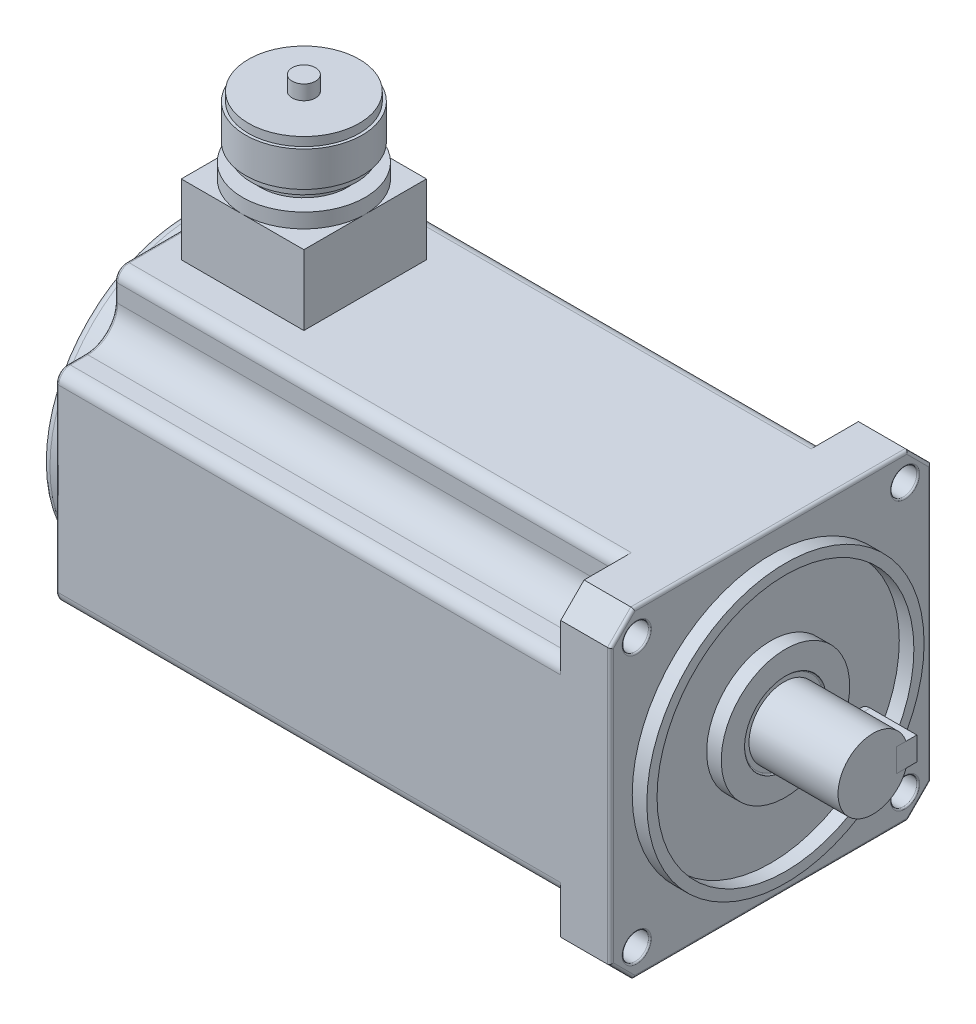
ISO-10303-21;
HEADER;
FILE_DESCRIPTION(('STEP AP214'),'2;1');
FILE_NAME('part.step','',(''),(''),'','','');
FILE_SCHEMA(('AUTOMOTIVE_DESIGN { 1 0 10303 214 1 1 1 1 }'));
ENDSEC;
DATA;
#1=APPLICATION_CONTEXT('core data for automotive mechanical design processes');
#2=APPLICATION_PROTOCOL_DEFINITION('international standard','automotive_design',2000,#1);
#3=PRODUCT_CONTEXT('',#1,'mechanical');
#4=PRODUCT('Part','Part','',(#3));
#5=PRODUCT_RELATED_PRODUCT_CATEGORY('part','',(#4));
#6=PRODUCT_DEFINITION_FORMATION('','',#4);
#7=PRODUCT_DEFINITION_CONTEXT('part definition',#1,'design');
#8=PRODUCT_DEFINITION('design','',#6,#7);
#9=PRODUCT_DEFINITION_SHAPE('','',#8);
#10=(LENGTH_UNIT() NAMED_UNIT(*) SI_UNIT(.MILLI.,.METRE.));
#11=(NAMED_UNIT(*) PLANE_ANGLE_UNIT() SI_UNIT($,.RADIAN.));
#12=(NAMED_UNIT(*) SI_UNIT($,.STERADIAN.) SOLID_ANGLE_UNIT());
#13=UNCERTAINTY_MEASURE_WITH_UNIT(LENGTH_MEASURE(1.E-05),#10,'distance_accuracy_value','');
#14=(GEOMETRIC_REPRESENTATION_CONTEXT(3) GLOBAL_UNCERTAINTY_ASSIGNED_CONTEXT((#13)) GLOBAL_UNIT_ASSIGNED_CONTEXT((#10,
#11,#12)) REPRESENTATION_CONTEXT('',''));
#15=CARTESIAN_POINT('',(0.,0.,0.));
#16=DIRECTION('',(0.,0.,1.));
#17=DIRECTION('',(1.,0.,0.));
#18=AXIS2_PLACEMENT_3D('',#15,#16,#17);
#19=CARTESIAN_POINT('',(19.,0.,-15.));
#20=DIRECTION('',(0.,0.,1.));
#21=DIRECTION('',(1.,0.,0.));
#22=AXIS2_PLACEMENT_3D('',#19,#20,#21);
#23=CYLINDRICAL_SURFACE('',#22,4.);
#24=CARTESIAN_POINT('',(19.,0.,-8.));
#25=DIRECTION('',(0.,0.,-1.));
#26=DIRECTION('',(-1.,0.,0.));
#27=AXIS2_PLACEMENT_3D('',#24,#25,#26);
#28=CIRCLE('',#27,4.);
#29=CARTESIAN_POINT('',(19.,-4.,-8.));
#30=VERTEX_POINT('',#29);
#31=CARTESIAN_POINT('',(19.,4.,-8.));
#32=VERTEX_POINT('',#31);
#33=EDGE_CURVE('E108',#30,#32,#28,.T.);
#34=ORIENTED_EDGE('',*,*,#33,.T.);
#35=DIRECTION('',(0.,0.,1.));
#36=VECTOR('',#35,1.);
#37=CARTESIAN_POINT('',(19.,4.,-15.));
#38=LINE('',#37,#36);
#39=CARTESIAN_POINT('',(19.,4.,-15.));
#40=VERTEX_POINT('',#39);
#41=EDGE_CURVE('E12',#40,#32,#38,.T.);
#42=ORIENTED_EDGE('',*,*,#41,.F.);
#43=CARTESIAN_POINT('',(19.,0.,-15.));
#44=DIRECTION('',(0.,0.,-1.));
#45=DIRECTION('',(-1.,0.,0.));
#46=AXIS2_PLACEMENT_3D('',#43,#44,#45);
#47=CIRCLE('',#46,4.);
#48=CARTESIAN_POINT('',(19.,-4.,-15.));
#49=VERTEX_POINT('',#48);
#50=EDGE_CURVE('E96',#49,#40,#47,.T.);
#51=ORIENTED_EDGE('',*,*,#50,.F.);
#52=DIRECTION('',(0.,0.,1.));
#53=VECTOR('',#52,1.);
#54=CARTESIAN_POINT('',(19.,-4.,-15.));
#55=LINE('',#54,#53);
#56=EDGE_CURVE('E104',#49,#30,#55,.T.);
#57=ORIENTED_EDGE('',*,*,#56,.T.);
#58=EDGE_LOOP('',(#34,#42,#51,#57));
#59=FACE_BOUND('',#58,.T.);
#60=ADVANCED_FACE('F45',(#59),#23,.T.);
#61=CARTESIAN_POINT('',(19.,4.,-15.));
#62=DIRECTION('',(0.,-1.,0.));
#63=DIRECTION('',(0.,0.,-1.));
#64=AXIS2_PLACEMENT_3D('',#61,#62,#63);
#65=PLANE('',#64);
#66=DIRECTION('',(1.,0.,0.));
#67=VECTOR('',#66,1.);
#68=CARTESIAN_POINT('',(19.,4.,-8.));
#69=LINE('',#68,#67);
#70=CARTESIAN_POINT('',(35.,4.,-8.));
#71=VERTEX_POINT('',#70);
#72=EDGE_CURVE('E100',#32,#71,#69,.T.);
#73=ORIENTED_EDGE('',*,*,#72,.T.);
#74=DIRECTION('',(0.,0.,1.));
#75=VECTOR('',#74,1.);
#76=CARTESIAN_POINT('',(35.,4.,-15.));
#77=LINE('',#76,#75);
#78=CARTESIAN_POINT('',(35.,4.,-15.));
#79=VERTEX_POINT('',#78);
#80=EDGE_CURVE('E53',#79,#71,#77,.T.);
#81=ORIENTED_EDGE('',*,*,#80,.F.);
#82=DIRECTION('',(1.,0.,0.));
#83=VECTOR('',#82,1.);
#84=CARTESIAN_POINT('',(19.,4.,-15.));
#85=LINE('',#84,#83);
#86=EDGE_CURVE('E91',#40,#79,#85,.T.);
#87=ORIENTED_EDGE('',*,*,#86,.F.);
#88=ORIENTED_EDGE('',*,*,#41,.T.);
#89=EDGE_LOOP('',(#73,#81,#87,#88));
#90=FACE_BOUND('',#89,.T.);
#91=ADVANCED_FACE('F99',(#90),#65,.F.);
#92=CARTESIAN_POINT('',(35.,4.,-15.));
#93=DIRECTION('',(-1.,0.,0.));
#94=DIRECTION('',(0.,0.,1.));
#95=AXIS2_PLACEMENT_3D('',#92,#93,#94);
#96=PLANE('',#95);
#97=DIRECTION('',(0.,-1.,0.));
#98=VECTOR('',#97,1.);
#99=CARTESIAN_POINT('',(35.,4.,-8.));
#100=LINE('',#99,#98);
#101=CARTESIAN_POINT('',(35.,-4.,-8.));
#102=VERTEX_POINT('',#101);
#103=EDGE_CURVE('E78',#71,#102,#100,.T.);
#104=ORIENTED_EDGE('',*,*,#103,.T.);
#105=DIRECTION('',(0.,0.,1.));
#106=VECTOR('',#105,1.);
#107=CARTESIAN_POINT('',(35.,-4.,-15.));
#108=LINE('',#107,#106);
#109=CARTESIAN_POINT('',(35.,-4.,-15.));
#110=VERTEX_POINT('',#109);
#111=EDGE_CURVE('E101',#110,#102,#108,.T.);
#112=ORIENTED_EDGE('',*,*,#111,.F.);
#113=DIRECTION('',(0.,-1.,0.));
#114=VECTOR('',#113,1.);
#115=CARTESIAN_POINT('',(35.,4.,-15.));
#116=LINE('',#115,#114);
#117=EDGE_CURVE('E94',#79,#110,#116,.T.);
#118=ORIENTED_EDGE('',*,*,#117,.F.);
#119=ORIENTED_EDGE('',*,*,#80,.T.);
#120=EDGE_LOOP('',(#104,#112,#118,#119));
#121=FACE_BOUND('',#120,.T.);
#122=ADVANCED_FACE('F102',(#121),#96,.F.);
#123=CARTESIAN_POINT('',(35.,-4.,-15.));
#124=DIRECTION('',(0.,1.,0.));
#125=DIRECTION('',(-1.,0.,0.));
#126=AXIS2_PLACEMENT_3D('',#123,#124,#125);
#127=PLANE('',#126);
#128=DIRECTION('',(-1.,0.,0.));
#129=VECTOR('',#128,1.);
#130=CARTESIAN_POINT('',(35.,-4.,-8.));
#131=LINE('',#130,#129);
#132=EDGE_CURVE('E84',#102,#30,#131,.T.);
#133=ORIENTED_EDGE('',*,*,#132,.T.);
#134=ORIENTED_EDGE('',*,*,#56,.F.);
#135=DIRECTION('',(-1.,0.,0.));
#136=VECTOR('',#135,1.);
#137=CARTESIAN_POINT('',(35.,-4.,-15.));
#138=LINE('',#137,#136);
#139=EDGE_CURVE('E61',#110,#49,#138,.T.);
#140=ORIENTED_EDGE('',*,*,#139,.F.);
#141=ORIENTED_EDGE('',*,*,#111,.T.);
#142=EDGE_LOOP('',(#133,#134,#140,#141));
#143=FACE_BOUND('',#142,.T.);
#144=ADVANCED_FACE('F115',(#143),#127,.F.);
#145=CARTESIAN_POINT('',(19.,0.,-15.));
#146=DIRECTION('',(0.,0.,-1.));
#147=DIRECTION('',(-1.,0.,0.));
#148=AXIS2_PLACEMENT_3D('',#145,#146,#147);
#149=PLANE('',#148);
#150=ORIENTED_EDGE('',*,*,#50,.T.);
#151=ORIENTED_EDGE('',*,*,#86,.T.);
#152=ORIENTED_EDGE('',*,*,#117,.T.);
#153=ORIENTED_EDGE('',*,*,#139,.T.);
#154=EDGE_LOOP('',(#150,#151,#152,#153));
#155=FACE_BOUND('',#154,.T.);
#156=ADVANCED_FACE('F92',(#155),#149,.T.);
#157=CARTESIAN_POINT('',(19.,0.,-8.));
#158=DIRECTION('',(0.,0.,-1.));
#159=DIRECTION('',(-1.,0.,0.));
#160=AXIS2_PLACEMENT_3D('',#157,#158,#159);
#161=PLANE('',#160);
#162=ORIENTED_EDGE('',*,*,#33,.F.);
#163=ORIENTED_EDGE('',*,*,#132,.F.);
#164=ORIENTED_EDGE('',*,*,#103,.F.);
#165=ORIENTED_EDGE('',*,*,#72,.F.);
#166=EDGE_LOOP('',(#162,#163,#164,#165));
#167=FACE_BOUND('',#166,.T.);
#168=ADVANCED_FACE('F118',(#167),#161,.F.);
#169=CLOSED_SHELL('',(#60,#91,#122,#144,#156,#168));
#170=MANIFOLD_SOLID_BREP('B2',#169);
#171=CARTESIAN_POINT('',(-160.,105.,0.));
#172=DIRECTION('',(0.,1.,0.));
#173=DIRECTION('',(0.,0.,1.));
#174=AXIS2_PLACEMENT_3D('',#171,#172,#173);
#175=PLANE('',#174);
#176=CARTESIAN_POINT('',(-160.,105.,0.));
#177=DIRECTION('',(0.,1.,0.));
#178=DIRECTION('',(0.,0.,1.));
#179=AXIS2_PLACEMENT_3D('',#176,#177,#178);
#180=CIRCLE('',#179,19.);
#181=CARTESIAN_POINT('',(-160.,105.,19.));
#182=VERTEX_POINT('',#181);
#183=EDGE_CURVE('E1747',#182,#182,#180,.T.);
#184=ORIENTED_EDGE('',*,*,#183,.T.);
#185=EDGE_LOOP('',(#184));
#186=FACE_BOUND('',#185,.T.);
#187=CARTESIAN_POINT('',(-160.,105.,0.));
#188=DIRECTION('',(0.,1.,0.));
#189=DIRECTION('',(0.,0.,1.));
#190=AXIS2_PLACEMENT_3D('',#187,#188,#189);
#191=CIRCLE('',#190,3.99999999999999);
#192=CARTESIAN_POINT('',(-160.,105.,3.99999999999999));
#193=VERTEX_POINT('',#192);
#194=EDGE_CURVE('E1744',#193,#193,#191,.T.);
#195=ORIENTED_EDGE('',*,*,#194,.F.);
#196=EDGE_LOOP('',(#195));
#197=FACE_BOUND('',#196,.T.);
#198=ADVANCED_FACE('F169',(#186,#197),#175,.T.);
#199=CARTESIAN_POINT('',(-160.,102.,0.));
#200=DIRECTION('',(0.,1.,0.));
#201=DIRECTION('',(0.,0.,1.));
#202=AXIS2_PLACEMENT_3D('',#199,#200,#201);
#203=PLANE('',#202);
#204=CARTESIAN_POINT('',(-160.,102.,0.));
#205=DIRECTION('',(0.,1.,0.));
#206=DIRECTION('',(0.,0.,1.));
#207=AXIS2_PLACEMENT_3D('',#204,#205,#206);
#208=CIRCLE('',#207,20.);
#209=CARTESIAN_POINT('',(-160.,102.,20.));
#210=VERTEX_POINT('',#209);
#211=EDGE_CURVE('E1754',#210,#210,#208,.T.);
#212=ORIENTED_EDGE('',*,*,#211,.T.);
#213=EDGE_LOOP('',(#212));
#214=FACE_BOUND('',#213,.T.);
#215=CARTESIAN_POINT('',(-160.,102.,0.));
#216=DIRECTION('',(0.,1.,0.));
#217=DIRECTION('',(0.,0.,1.));
#218=AXIS2_PLACEMENT_3D('',#215,#216,#217);
#219=CIRCLE('',#218,19.);
#220=CARTESIAN_POINT('',(-160.,102.,19.));
#221=VERTEX_POINT('',#220);
#222=EDGE_CURVE('E1743',#221,#221,#219,.T.);
#223=ORIENTED_EDGE('',*,*,#222,.F.);
#224=EDGE_LOOP('',(#223));
#225=FACE_BOUND('',#224,.T.);
#226=ADVANCED_FACE('F1118',(#214,#225),#203,.T.);
#227=CARTESIAN_POINT('',(-160.,84.,0.));
#228=DIRECTION('',(0.,1.,0.));
#229=DIRECTION('',(0.,0.,1.));
#230=AXIS2_PLACEMENT_3D('',#227,#228,#229);
#231=PLANE('',#230);
#232=CARTESIAN_POINT('',(-160.,84.,0.));
#233=DIRECTION('',(0.,1.,0.));
#234=DIRECTION('',(0.,0.,1.));
#235=AXIS2_PLACEMENT_3D('',#232,#233,#234);
#236=CIRCLE('',#235,21.);
#237=CARTESIAN_POINT('',(-160.,84.,21.));
#238=VERTEX_POINT('',#237);
#239=EDGE_CURVE('E561',#238,#238,#236,.T.);
#240=ORIENTED_EDGE('',*,*,#239,.T.);
#241=EDGE_LOOP('',(#240));
#242=FACE_BOUND('',#241,.T.);
#243=CARTESIAN_POINT('',(-160.,84.,0.));
#244=DIRECTION('',(0.,1.,0.));
#245=DIRECTION('',(0.,0.,1.));
#246=AXIS2_PLACEMENT_3D('',#243,#244,#245);
#247=CIRCLE('',#246,15.);
#248=CARTESIAN_POINT('',(-160.,84.,15.));
#249=VERTEX_POINT('',#248);
#250=EDGE_CURVE('E1763',#249,#249,#247,.T.);
#251=ORIENTED_EDGE('',*,*,#250,.F.);
#252=EDGE_LOOP('',(#251));
#253=FACE_BOUND('',#252,.T.);
#254=ADVANCED_FACE('F1124',(#242,#253),#231,.T.);
#255=CARTESIAN_POINT('',(0.,79.,0.));
#256=DIRECTION('',(0.,-1.,0.));
#257=DIRECTION('',(0.,0.,-1.));
#258=AXIS2_PLACEMENT_3D('',#255,#256,#257);
#259=PLANE('',#258);
#260=CARTESIAN_POINT('',(-160.,79.,0.));
#261=DIRECTION('',(0.,1.,0.));
#262=DIRECTION('',(0.,0.,1.));
#263=AXIS2_PLACEMENT_3D('',#260,#261,#262);
#264=CIRCLE('',#263,21.);
#265=CARTESIAN_POINT('',(-160.,79.,21.));
#266=VERTEX_POINT('',#265);
#267=CARTESIAN_POINT('',(-139.,79.,0.));
#268=VERTEX_POINT('',#267);
#269=EDGE_CURVE('E185',#266,#268,#264,.T.);
#270=ORIENTED_EDGE('',*,*,#269,.F.);
#271=DIRECTION('',(1.,0.,0.));
#272=VECTOR('',#271,1.);
#273=CARTESIAN_POINT('',(-181.,79.,21.));
#274=LINE('',#273,#272);
#275=CARTESIAN_POINT('',(-139.,79.,21.));
#276=VERTEX_POINT('',#275);
#277=EDGE_CURVE('E547',#266,#276,#274,.T.);
#278=ORIENTED_EDGE('',*,*,#277,.T.);
#279=DIRECTION('',(0.,0.,-1.));
#280=VECTOR('',#279,1.);
#281=CARTESIAN_POINT('',(-139.,79.,21.));
#282=LINE('',#281,#280);
#283=EDGE_CURVE('E559',#276,#268,#282,.T.);
#284=ORIENTED_EDGE('',*,*,#283,.T.);
#285=EDGE_LOOP('',(#270,#278,#284));
#286=FACE_BOUND('',#285,.T.);
#287=ADVANCED_FACE('F558',(#286),#259,.F.);
#288=CARTESIAN_POINT('',(-160.,79.,-21.));
#289=VERTEX_POINT('',#288);
#290=EDGE_CURVE('E43',#268,#289,#264,.T.);
#291=ORIENTED_EDGE('',*,*,#290,.F.);
#292=CARTESIAN_POINT('',(-139.,79.,-21.));
#293=VERTEX_POINT('',#292);
#294=EDGE_CURVE('E570',#268,#293,#282,.T.);
#295=ORIENTED_EDGE('',*,*,#294,.T.);
#296=DIRECTION('',(-1.,0.,0.));
#297=VECTOR('',#296,1.);
#298=CARTESIAN_POINT('',(-181.,79.,-21.));
#299=LINE('',#298,#297);
#300=EDGE_CURVE('E571',#293,#289,#299,.T.);
#301=ORIENTED_EDGE('',*,*,#300,.T.);
#302=EDGE_LOOP('',(#291,#295,#301));
#303=FACE_BOUND('',#302,.T.);
#304=ADVANCED_FACE('F1165',(#303),#259,.F.);
#305=CARTESIAN_POINT('',(-181.,79.,0.));
#306=VERTEX_POINT('',#305);
#307=EDGE_CURVE('E183',#289,#306,#264,.T.);
#308=ORIENTED_EDGE('',*,*,#307,.F.);
#309=CARTESIAN_POINT('',(-181.,79.,-21.));
#310=VERTEX_POINT('',#309);
#311=EDGE_CURVE('E569',#289,#310,#299,.T.);
#312=ORIENTED_EDGE('',*,*,#311,.T.);
#313=DIRECTION('',(0.,0.,1.));
#314=VECTOR('',#313,1.);
#315=CARTESIAN_POINT('',(-181.,79.,21.));
#316=LINE('',#315,#314);
#317=EDGE_CURVE('E556',#310,#306,#316,.T.);
#318=ORIENTED_EDGE('',*,*,#317,.T.);
#319=EDGE_LOOP('',(#308,#312,#318));
#320=FACE_BOUND('',#319,.T.);
#321=ADVANCED_FACE('F1626',(#320),#259,.F.);
#322=EDGE_CURVE('E192',#306,#266,#264,.T.);
#323=ORIENTED_EDGE('',*,*,#322,.F.);
#324=CARTESIAN_POINT('',(-181.,79.,21.));
#325=VERTEX_POINT('',#324);
#326=EDGE_CURVE('E543',#306,#325,#316,.T.);
#327=ORIENTED_EDGE('',*,*,#326,.T.);
#328=EDGE_CURVE('E540',#325,#266,#274,.T.);
#329=ORIENTED_EDGE('',*,*,#328,.T.);
#330=EDGE_LOOP('',(#323,#327,#329));
#331=FACE_BOUND('',#330,.T.);
#332=ADVANCED_FACE('F542',(#331),#259,.F.);
#333=CARTESIAN_POINT('',(-190.,55.,47.));
#334=DIRECTION('',(0.,1.,0.));
#335=DIRECTION('',(0.,0.,1.));
#336=AXIS2_PLACEMENT_3D('',#333,#334,#335);
#337=PLANE('',#336);
#338=DIRECTION('',(1.,0.,0.));
#339=VECTOR('',#338,1.);
#340=CARTESIAN_POINT('',(-190.,55.,47.));
#341=LINE('',#340,#339);
#342=CARTESIAN_POINT('',(-17.,55.,47.));
#343=VERTEX_POINT('',#342);
#344=CARTESIAN_POINT('',(-1.,55.,47.));
#345=VERTEX_POINT('',#344);
#346=EDGE_CURVE('E803',#343,#345,#341,.T.);
#347=ORIENTED_EDGE('',*,*,#346,.T.);
#348=DIRECTION('',(0.,0.,1.));
#349=VECTOR('',#348,1.);
#350=CARTESIAN_POINT('',(-1.,55.,47.));
#351=LINE('',#350,#349);
#352=CARTESIAN_POINT('',(-1.,55.,-47.));
#353=VERTEX_POINT('',#352);
#354=EDGE_CURVE('E1041',#345,#353,#351,.F.);
#355=ORIENTED_EDGE('',*,*,#354,.T.);
#356=DIRECTION('',(1.,0.,0.));
#357=VECTOR('',#356,1.);
#358=CARTESIAN_POINT('',(-190.,55.,-47.));
#359=LINE('',#358,#357);
#360=CARTESIAN_POINT('',(-17.,55.,-47.));
#361=VERTEX_POINT('',#360);
#362=EDGE_CURVE('E818',#361,#353,#359,.T.);
#363=ORIENTED_EDGE('',*,*,#362,.F.);
#364=DIRECTION('',(0.,0.,-1.));
#365=VECTOR('',#364,1.);
#366=CARTESIAN_POINT('',(-17.,55.,-30.8019609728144));
#367=LINE('',#366,#365);
#368=CARTESIAN_POINT('',(-17.,55.,-30.8019609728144));
#369=VERTEX_POINT('',#368);
#370=EDGE_CURVE('E786',#369,#361,#367,.T.);
#371=ORIENTED_EDGE('',*,*,#370,.F.);
#372=DIRECTION('',(-1.,0.,0.));
#373=VECTOR('',#372,1.);
#374=CARTESIAN_POINT('',(-17.,55.,-30.8019609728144));
#375=LINE('',#374,#373);
#376=CARTESIAN_POINT('',(-189.,55.,-30.8019609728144));
#377=VERTEX_POINT('',#376);
#378=EDGE_CURVE('E810',#369,#377,#375,.T.);
#379=ORIENTED_EDGE('',*,*,#378,.T.);
#380=DIRECTION('',(0.,0.,1.));
#381=VECTOR('',#380,1.);
#382=CARTESIAN_POINT('',(-189.,55.,30.8019609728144));
#383=LINE('',#382,#381);
#384=CARTESIAN_POINT('',(-189.,55.,30.8019609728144));
#385=VERTEX_POINT('',#384);
#386=EDGE_CURVE('E933',#377,#385,#383,.T.);
#387=ORIENTED_EDGE('',*,*,#386,.T.);
#388=DIRECTION('',(-1.,0.,0.));
#389=VECTOR('',#388,1.);
#390=CARTESIAN_POINT('',(-17.,55.,30.8019609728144));
#391=LINE('',#390,#389);
#392=CARTESIAN_POINT('',(-17.,55.,30.8019609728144));
#393=VERTEX_POINT('',#392);
#394=EDGE_CURVE('E687',#393,#385,#391,.T.);
#395=ORIENTED_EDGE('',*,*,#394,.F.);
#396=DIRECTION('',(0.,0.,-1.));
#397=VECTOR('',#396,1.);
#398=CARTESIAN_POINT('',(-17.,55.,47.));
#399=LINE('',#398,#397);
#400=EDGE_CURVE('E670',#343,#393,#399,.T.);
#401=ORIENTED_EDGE('',*,*,#400,.F.);
#402=EDGE_LOOP('',(#347,#355,#363,#371,#379,#387,#395,#401));
#403=FACE_BOUND('',#402,.T.);
#404=DIRECTION('',(-1.,0.,0.));
#405=VECTOR('',#404,1.);
#406=CARTESIAN_POINT('',(-181.,55.,-21.));
#407=LINE('',#406,#405);
#408=CARTESIAN_POINT('',(-139.,55.,-21.));
#409=VERTEX_POINT('',#408);
#410=CARTESIAN_POINT('',(-181.,55.,-21.));
#411=VERTEX_POINT('',#410);
#412=EDGE_CURVE('E578',#409,#411,#407,.T.);
#413=ORIENTED_EDGE('',*,*,#412,.F.);
#414=DIRECTION('',(0.,0.,-1.));
#415=VECTOR('',#414,1.);
#416=CARTESIAN_POINT('',(-139.,55.,21.));
#417=LINE('',#416,#415);
#418=CARTESIAN_POINT('',(-139.,55.,21.));
#419=VERTEX_POINT('',#418);
#420=EDGE_CURVE('E575',#419,#409,#417,.T.);
#421=ORIENTED_EDGE('',*,*,#420,.F.);
#422=DIRECTION('',(1.,0.,0.));
#423=VECTOR('',#422,1.);
#424=CARTESIAN_POINT('',(-181.,55.,21.));
#425=LINE('',#424,#423);
#426=CARTESIAN_POINT('',(-181.,55.,21.));
#427=VERTEX_POINT('',#426);
#428=EDGE_CURVE('E583',#427,#419,#425,.T.);
#429=ORIENTED_EDGE('',*,*,#428,.F.);
#430=DIRECTION('',(0.,0.,1.));
#431=VECTOR('',#430,1.);
#432=CARTESIAN_POINT('',(-181.,55.,21.));
#433=LINE('',#432,#431);
#434=EDGE_CURVE('E580',#411,#427,#433,.T.);
#435=ORIENTED_EDGE('',*,*,#434,.F.);
#436=EDGE_LOOP('',(#413,#421,#429,#435));
#437=FACE_BOUND('',#436,.T.);
#438=ADVANCED_FACE('F1199',(#403,#437),#337,.T.);
#439=CARTESIAN_POINT('',(35.,0.,0.));
#440=DIRECTION('',(-1.,0.,0.));
#441=DIRECTION('',(0.,0.,1.));
#442=AXIS2_PLACEMENT_3D('',#439,#440,#441);
#443=CYLINDRICAL_SURFACE('',#442,12.);
#444=CARTESIAN_POINT('',(4.5,0.,0.));
#445=DIRECTION('',(1.,0.,0.));
#446=DIRECTION('',(0.,0.,-1.));
#447=AXIS2_PLACEMENT_3D('',#444,#445,#446);
#448=CIRCLE('',#447,12.);
#449=CARTESIAN_POINT('',(4.5,0.,-12.));
#450=VERTEX_POINT('',#449);
#451=EDGE_CURVE('E619',#450,#450,#448,.T.);
#452=ORIENTED_EDGE('',*,*,#451,.T.);
#453=EDGE_LOOP('',(#452));
#454=FACE_BOUND('',#453,.T.);
#455=CARTESIAN_POINT('',(19.,-4.,-11.3137084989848));
#456=CARTESIAN_POINT('',(18.8908686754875,-4.0000143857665,-11.3136910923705));
#457=CARTESIAN_POINT('',(18.7817470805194,-3.99553419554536,-11.3152871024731));
#458=CARTESIAN_POINT('',(18.5643503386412,-3.97769673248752,-11.3215763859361));
#459=CARTESIAN_POINT('',(18.4560749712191,-3.96434185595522,-11.3262688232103));
#460=CARTESIAN_POINT('',(18.2414552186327,-3.92891935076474,-11.3386032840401));
#461=CARTESIAN_POINT('',(18.1351060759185,-3.90687756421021,-11.3462365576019));
#462=CARTESIAN_POINT('',(17.9247867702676,-3.85430689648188,-11.364201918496));
#463=CARTESIAN_POINT('',(17.8208166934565,-3.82377770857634,-11.3745341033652));
#464=CARTESIAN_POINT('',(17.5136614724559,-3.71986482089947,-11.4091190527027));
#465=CARTESIAN_POINT('',(17.314913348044,-3.63410266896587,-11.4369799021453));
#466=CARTESIAN_POINT('',(16.9345971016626,-3.4322845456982,-11.4991525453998));
#467=CARTESIAN_POINT('',(16.753039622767,-3.31620997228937,-11.5334682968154));
#468=CARTESIAN_POINT('',(16.4051313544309,-3.05220793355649,-11.6061789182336));
#469=CARTESIAN_POINT('',(16.2395437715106,-2.90330055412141,-11.6446750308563));
#470=CARTESIAN_POINT('',(15.9351726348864,-2.57995313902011,-11.7205540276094));
#471=CARTESIAN_POINT('',(15.796393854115,-2.40550856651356,-11.7579367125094));
#472=CARTESIAN_POINT('',(15.5460828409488,-2.03041476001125,-11.8285552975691));
#473=CARTESIAN_POINT('',(15.4353563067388,-1.82920040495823,-11.8616574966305));
#474=CARTESIAN_POINT('',(15.2496307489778,-1.40971695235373,-11.9187843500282));
#475=CARTESIAN_POINT('',(15.1746208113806,-1.19145308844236,-11.9428117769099));
#476=CARTESIAN_POINT('',(15.0650571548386,-0.752117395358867,-11.9783628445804));
#477=CARTESIAN_POINT('',(15.0291869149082,-0.531407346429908,-11.9902923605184));
#478=CARTESIAN_POINT('',(14.9947348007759,-0.086795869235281,-12.0017443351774));
#479=CARTESIAN_POINT('',(14.9961440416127,0.137104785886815,-12.0012697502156));
#480=CARTESIAN_POINT('',(15.0353770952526,0.572415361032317,-11.9882415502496));
#481=CARTESIAN_POINT('',(15.0717704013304,0.783970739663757,-11.9761624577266));
#482=CARTESIAN_POINT('',(15.1775729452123,1.19777632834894,-11.9418784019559));
#483=CARTESIAN_POINT('',(15.2469840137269,1.4000260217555,-11.9196728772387));
#484=CARTESIAN_POINT('',(15.4176849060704,1.79261022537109,-11.8670267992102));
#485=CARTESIAN_POINT('',(15.5193820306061,1.98275302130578,-11.8364817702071));
#486=CARTESIAN_POINT('',(15.7514419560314,2.34369935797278,-11.7703352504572));
#487=CARTESIAN_POINT('',(15.8818125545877,2.51449761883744,-11.7347323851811));
#488=CARTESIAN_POINT('',(16.1746757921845,2.84038544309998,-11.6602518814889));
#489=CARTESIAN_POINT('',(16.3383901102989,2.99435951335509,-11.6212989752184));
#490=CARTESIAN_POINT('',(16.6897980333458,3.27310303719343,-11.5458957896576));
#491=CARTESIAN_POINT('',(16.8774993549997,3.39786305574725,-11.5094463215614));
#492=CARTESIAN_POINT('',(17.1747129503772,3.56109757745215,-11.4595759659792));
#493=CARTESIAN_POINT('',(17.2772554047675,3.61182358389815,-11.4436484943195));
#494=CARTESIAN_POINT('',(17.4865649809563,3.70440095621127,-11.4140167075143));
#495=CARTESIAN_POINT('',(17.5933303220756,3.74625601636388,-11.4003114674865));
#496=CARTESIAN_POINT('',(17.8102170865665,3.82067426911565,-11.3755873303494));
#497=CARTESIAN_POINT('',(17.9203347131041,3.85324757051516,-11.3645655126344));
#498=CARTESIAN_POINT('',(18.1431681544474,3.90883841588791,-11.3455648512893));
#499=CARTESIAN_POINT('',(18.2558827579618,3.93186032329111,-11.3375846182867));
#500=CARTESIAN_POINT('',(18.4736424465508,3.96661962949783,-11.3254693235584));
#501=CARTESIAN_POINT('',(18.5785495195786,3.97913375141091,-11.3210705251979));
#502=CARTESIAN_POINT('',(18.7889683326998,3.99582494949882,-11.3151843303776));
#503=CARTESIAN_POINT('',(18.8944791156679,4.00001278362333,-11.3136931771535));
#504=CARTESIAN_POINT('',(19.,4.,-11.3137084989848));
#505=B_SPLINE_CURVE_WITH_KNOTS('',3,(#455,#456,#457,#458,#459,#460,#461,#462,#463,#464,#465,
#466,#467,#468,#469,#470,#471,#472,#473,#474,#475,#476,#477,#478,#479,#480,#481,#482,#483,#484,
#485,#486,#487,#488,#489,#490,#491,#492,#493,#494,#495,#496,#497,#498,#499,#500,#501,#502,#503,
#504),.UNSPECIFIED.,.F.,.F.,(4,2,2,2,2,2,2,2,2,2,2,2,2,2,2,2,2,2,2,2,2,2,2,2,4),(0.,
0.327273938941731,0.654459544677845,0.980679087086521,1.30691042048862,1.95841627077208,
2.61032287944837,3.28524582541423,3.96028882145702,4.65295094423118,5.34540127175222,
6.01376445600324,6.68196834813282,7.32396236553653,7.96599198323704,8.61646637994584,
9.26711789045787,9.94834778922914,10.6297973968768,10.9759539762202,11.3219661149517,
11.6675999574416,12.0130757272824,12.3299368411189,12.6463882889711),.UNSPECIFIED.);
#506=CARTESIAN_POINT('',(19.,-4.,-11.3137084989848));
#507=VERTEX_POINT('',#506);
#508=CARTESIAN_POINT('',(19.,4.,-11.3137084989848));
#509=VERTEX_POINT('',#508);
#510=EDGE_CURVE('E173',#507,#509,#505,.T.);
#511=ORIENTED_EDGE('',*,*,#510,.F.);
#512=DIRECTION('',(-1.,0.,0.));
#513=VECTOR('',#512,1.);
#514=CARTESIAN_POINT('',(35.,-4.,-11.3137084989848));
#515=LINE('',#514,#513);
#516=CARTESIAN_POINT('',(35.,-4.,-11.3137084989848));
#517=VERTEX_POINT('',#516);
#518=EDGE_CURVE('E616',#517,#507,#515,.T.);
#519=ORIENTED_EDGE('',*,*,#518,.F.);
#520=CARTESIAN_POINT('',(35.,0.,0.));
#521=DIRECTION('',(1.,0.,0.));
#522=DIRECTION('',(0.,0.,-1.));
#523=AXIS2_PLACEMENT_3D('',#520,#521,#522);
#524=CIRCLE('',#523,12.);
#525=CARTESIAN_POINT('',(35.,3.99999999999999,-11.3137084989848));
#526=VERTEX_POINT('',#525);
#527=EDGE_CURVE('E620',#526,#517,#524,.T.);
#528=ORIENTED_EDGE('',*,*,#527,.F.);
#529=DIRECTION('',(-1.,0.,0.));
#530=VECTOR('',#529,1.);
#531=CARTESIAN_POINT('',(35.,3.99999999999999,-11.3137084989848));
#532=LINE('',#531,#530);
#533=EDGE_CURVE('E614',#509,#526,#532,.F.);
#534=ORIENTED_EDGE('',*,*,#533,.F.);
#535=EDGE_LOOP('',(#511,#519,#528,#534));
#536=FACE_BOUND('',#535,.T.);
#537=ADVANCED_FACE('F1194',(#454,#536),#443,.T.);
#538=CARTESIAN_POINT('',(35.,0.,0.));
#539=DIRECTION('',(1.,0.,0.));
#540=DIRECTION('',(0.,0.,-1.));
#541=AXIS2_PLACEMENT_3D('',#538,#539,#540);
#542=PLANE('',#541);
#543=ORIENTED_EDGE('',*,*,#527,.T.);
#544=DIRECTION('',(0.,0.,-1.));
#545=VECTOR('',#544,1.);
#546=CARTESIAN_POINT('',(35.,-4.,-8.));
#547=LINE('',#546,#545);
#548=CARTESIAN_POINT('',(35.,-4.,-8.));
#549=VERTEX_POINT('',#548);
#550=EDGE_CURVE('E609',#549,#517,#547,.T.);
#551=ORIENTED_EDGE('',*,*,#550,.F.);
#552=DIRECTION('',(0.,1.,0.));
#553=VECTOR('',#552,1.);
#554=CARTESIAN_POINT('',(35.,3.99999999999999,-8.));
#555=LINE('',#554,#553);
#556=CARTESIAN_POINT('',(35.,4.,-8.));
#557=VERTEX_POINT('',#556);
#558=EDGE_CURVE('E598',#549,#557,#555,.T.);
#559=ORIENTED_EDGE('',*,*,#558,.T.);
#560=DIRECTION('',(0.,0.,-1.));
#561=VECTOR('',#560,1.);
#562=CARTESIAN_POINT('',(35.,3.99999999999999,-8.));
#563=LINE('',#562,#561);
#564=EDGE_CURVE('E606',#557,#526,#563,.T.);
#565=ORIENTED_EDGE('',*,*,#564,.T.);
#566=EDGE_LOOP('',(#543,#551,#559,#565));
#567=FACE_BOUND('',#566,.T.);
#568=ADVANCED_FACE('F1192',(#567),#542,.T.);
#569=CARTESIAN_POINT('',(4.5,0.,0.));
#570=DIRECTION('',(1.,0.,0.));
#571=DIRECTION('',(0.,0.,-1.));
#572=AXIS2_PLACEMENT_3D('',#569,#570,#571);
#573=PLANE('',#572);
#574=CARTESIAN_POINT('',(4.5,0.,0.));
#575=DIRECTION('',(1.,0.,0.));
#576=DIRECTION('',(0.,0.,-1.));
#577=AXIS2_PLACEMENT_3D('',#574,#575,#576);
#578=CIRCLE('',#577,13.5);
#579=CARTESIAN_POINT('',(4.5,0.,-13.5));
#580=VERTEX_POINT('',#579);
#581=EDGE_CURVE('E564',#580,#580,#578,.T.);
#582=ORIENTED_EDGE('',*,*,#581,.T.);
#583=EDGE_LOOP('',(#582));
#584=FACE_BOUND('',#583,.T.);
#585=ORIENTED_EDGE('',*,*,#451,.F.);
#586=EDGE_LOOP('',(#585));
#587=FACE_BOUND('',#586,.T.);
#588=ADVANCED_FACE('F1101',(#584,#587),#573,.T.);
#589=CARTESIAN_POINT('',(0.,0.,0.));
#590=DIRECTION('',(1.,0.,0.));
#591=DIRECTION('',(0.,0.,-1.));
#592=AXIS2_PLACEMENT_3D('',#589,#590,#591);
#593=PLANE('',#592);
#594=CARTESIAN_POINT('',(0.,0.,0.));
#595=DIRECTION('',(1.,0.,0.));
#596=DIRECTION('',(0.,0.,-1.));
#597=AXIS2_PLACEMENT_3D('',#594,#595,#596);
#598=CIRCLE('',#597,44.);
#599=CARTESIAN_POINT('',(0.,0.,-44.));
#600=VERTEX_POINT('',#599);
#601=EDGE_CURVE('E1096',#600,#600,#598,.F.);
#602=ORIENTED_EDGE('',*,*,#601,.F.);
#603=EDGE_LOOP('',(#602));
#604=FACE_BOUND('',#603,.T.);
#605=CARTESIAN_POINT('',(0.,0.,0.));
#606=DIRECTION('',(1.,0.,0.));
#607=DIRECTION('',(0.,0.,-1.));
#608=AXIS2_PLACEMENT_3D('',#605,#606,#607);
#609=CIRCLE('',#608,22.);
#610=CARTESIAN_POINT('',(0.,0.,-22.));
#611=VERTEX_POINT('',#610);
#612=EDGE_CURVE('E628',#611,#611,#609,.T.);
#613=ORIENTED_EDGE('',*,*,#612,.F.);
#614=EDGE_LOOP('',(#613));
#615=FACE_BOUND('',#614,.T.);
#616=ADVANCED_FACE('F1202',(#604,#615),#593,.T.);
#617=CARTESIAN_POINT('',(0.,-45.9619407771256,45.9619407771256));
#618=DIRECTION('',(1.,0.,0.));
#619=DIRECTION('',(0.,0.,-1.));
#620=AXIS2_PLACEMENT_3D('',#617,#618,#619);
#621=CIRCLE('',#620,5.);
#622=CARTESIAN_POINT('',(0.,-45.9619407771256,40.9619407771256));
#623=VERTEX_POINT('',#622);
#624=EDGE_CURVE('E1075',#623,#623,#621,.F.);
#625=ORIENTED_EDGE('',*,*,#624,.T.);
#626=EDGE_LOOP('',(#625));
#627=FACE_BOUND('',#626,.T.);
#628=CARTESIAN_POINT('',(0.,-45.9619407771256,-45.9619407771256));
#629=DIRECTION('',(1.,0.,0.));
#630=DIRECTION('',(0.,0.,-1.));
#631=AXIS2_PLACEMENT_3D('',#628,#629,#630);
#632=CIRCLE('',#631,5.);
#633=CARTESIAN_POINT('',(0.,-45.9619407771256,-50.9619407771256));
#634=VERTEX_POINT('',#633);
#635=EDGE_CURVE('E1072',#634,#634,#632,.F.);
#636=ORIENTED_EDGE('',*,*,#635,.T.);
#637=EDGE_LOOP('',(#636));
#638=FACE_BOUND('',#637,.T.);
#639=CARTESIAN_POINT('',(0.,45.9619407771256,-45.9619407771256));
#640=DIRECTION('',(1.,0.,0.));
#641=DIRECTION('',(0.,0.,-1.));
#642=AXIS2_PLACEMENT_3D('',#639,#640,#641);
#643=CIRCLE('',#642,5.);
#644=CARTESIAN_POINT('',(0.,45.9619407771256,-50.9619407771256));
#645=VERTEX_POINT('',#644);
#646=EDGE_CURVE('E1069',#645,#645,#643,.F.);
#647=ORIENTED_EDGE('',*,*,#646,.T.);
#648=EDGE_LOOP('',(#647));
#649=FACE_BOUND('',#648,.T.);
#650=CARTESIAN_POINT('',(0.,45.9619407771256,45.9619407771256));
#651=DIRECTION('',(1.,0.,0.));
#652=DIRECTION('',(0.,0.,-1.));
#653=AXIS2_PLACEMENT_3D('',#650,#651,#652);
#654=CIRCLE('',#653,5.);
#655=CARTESIAN_POINT('',(0.,45.9619407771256,40.9619407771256));
#656=VERTEX_POINT('',#655);
#657=EDGE_CURVE('E1066',#656,#656,#654,.F.);
#658=ORIENTED_EDGE('',*,*,#657,.T.);
#659=EDGE_LOOP('',(#658));
#660=FACE_BOUND('',#659,.T.);
#661=DIRECTION('',(0.,0.707106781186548,-0.707106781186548));
#662=VECTOR('',#661,1.);
#663=CARTESIAN_POINT('',(0.,-50.2928932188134,-50.2928932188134));
#664=LINE('',#663,#662);
#665=CARTESIAN_POINT('',(0.,-54.,-46.5857864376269));
#666=VERTEX_POINT('',#665);
#667=CARTESIAN_POINT('',(0.,-46.5857864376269,-54.));
#668=VERTEX_POINT('',#667);
#669=EDGE_CURVE('E1019',#666,#668,#664,.T.);
#670=ORIENTED_EDGE('',*,*,#669,.T.);
#671=DIRECTION('',(0.,1.,0.));
#672=VECTOR('',#671,1.);
#673=CARTESIAN_POINT('',(0.,0.,-54.));
#674=LINE('',#673,#672);
#675=CARTESIAN_POINT('',(0.,46.5857864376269,-54.));
#676=VERTEX_POINT('',#675);
#677=EDGE_CURVE('E1024',#668,#676,#674,.T.);
#678=ORIENTED_EDGE('',*,*,#677,.T.);
#679=DIRECTION('',(0.,0.707106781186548,0.707106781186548));
#680=VECTOR('',#679,1.);
#681=CARTESIAN_POINT('',(0.,50.2928932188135,-50.2928932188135));
#682=LINE('',#681,#680);
#683=CARTESIAN_POINT('',(0.,54.,-46.5857864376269));
#684=VERTEX_POINT('',#683);
#685=EDGE_CURVE('E1021',#676,#684,#682,.T.);
#686=ORIENTED_EDGE('',*,*,#685,.T.);
#687=DIRECTION('',(0.,0.,1.));
#688=VECTOR('',#687,1.);
#689=CARTESIAN_POINT('',(0.,54.,0.));
#690=LINE('',#689,#688);
#691=CARTESIAN_POINT('',(0.,54.,46.5857864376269));
#692=VERTEX_POINT('',#691);
#693=EDGE_CURVE('E939',#684,#692,#690,.T.);
#694=ORIENTED_EDGE('',*,*,#693,.T.);
#695=DIRECTION('',(0.,-0.707106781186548,0.707106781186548));
#696=VECTOR('',#695,1.);
#697=CARTESIAN_POINT('',(0.,50.2928932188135,50.2928932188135));
#698=LINE('',#697,#696);
#699=CARTESIAN_POINT('',(0.,46.5857864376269,54.));
#700=VERTEX_POINT('',#699);
#701=EDGE_CURVE('E1011',#692,#700,#698,.T.);
#702=ORIENTED_EDGE('',*,*,#701,.T.);
#703=DIRECTION('',(0.,-1.,0.));
#704=VECTOR('',#703,1.);
#705=CARTESIAN_POINT('',(0.,0.,54.));
#706=LINE('',#705,#704);
#707=CARTESIAN_POINT('',(0.,-46.5857864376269,54.));
#708=VERTEX_POINT('',#707);
#709=EDGE_CURVE('E1013',#700,#708,#706,.T.);
#710=ORIENTED_EDGE('',*,*,#709,.T.);
#711=DIRECTION('',(0.,-0.707106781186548,-0.707106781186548));
#712=VECTOR('',#711,1.);
#713=CARTESIAN_POINT('',(0.,-50.2928932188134,50.2928932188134));
#714=LINE('',#713,#712);
#715=CARTESIAN_POINT('',(0.,-54.,46.5857864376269));
#716=VERTEX_POINT('',#715);
#717=EDGE_CURVE('E1015',#708,#716,#714,.T.);
#718=ORIENTED_EDGE('',*,*,#717,.T.);
#719=DIRECTION('',(0.,0.,-1.));
#720=VECTOR('',#719,1.);
#721=CARTESIAN_POINT('',(0.,-54.,0.));
#722=LINE('',#721,#720);
#723=EDGE_CURVE('E1017',#716,#666,#722,.T.);
#724=ORIENTED_EDGE('',*,*,#723,.T.);
#725=EDGE_LOOP('',(#670,#678,#686,#694,#702,#710,#718,#724));
#726=FACE_BOUND('',#725,.T.);
#727=CARTESIAN_POINT('',(0.,0.,0.));
#728=DIRECTION('',(1.,0.,0.));
#729=DIRECTION('',(0.,0.,-1.));
#730=AXIS2_PLACEMENT_3D('',#727,#728,#729);
#731=CIRCLE('',#730,47.5);
#732=CARTESIAN_POINT('',(0.,0.,-47.5));
#733=VERTEX_POINT('',#732);
#734=EDGE_CURVE('E637',#733,#733,#731,.T.);
#735=ORIENTED_EDGE('',*,*,#734,.F.);
#736=EDGE_LOOP('',(#735));
#737=FACE_BOUND('',#736,.T.);
#738=ADVANCED_FACE('F1347',(#627,#638,#649,#660,#726,#737),#593,.T.);
#739=CARTESIAN_POINT('',(-190.,0.,0.));
#740=DIRECTION('',(1.,0.,0.));
#741=DIRECTION('',(0.,0.,-1.));
#742=AXIS2_PLACEMENT_3D('',#739,#740,#741);
#743=PLANE('',#742);
#744=DIRECTION('',(0.,0.,1.));
#745=VECTOR('',#744,1.);
#746=CARTESIAN_POINT('',(-190.,33.8019609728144,0.));
#747=LINE('',#746,#745);
#748=CARTESIAN_POINT('',(-190.,33.8019609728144,51.));
#749=VERTEX_POINT('',#748);
#750=CARTESIAN_POINT('',(-190.,33.8019609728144,45.));
#751=VERTEX_POINT('',#750);
#752=EDGE_CURVE('E888',#749,#751,#747,.F.);
#753=ORIENTED_EDGE('',*,*,#752,.T.);
#754=CARTESIAN_POINT('',(-190.,45.,45.));
#755=DIRECTION('',(1.,0.,0.));
#756=DIRECTION('',(0.,0.,-1.));
#757=AXIS2_PLACEMENT_3D('',#754,#755,#756);
#758=CIRCLE('',#757,11.1980390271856);
#759=CARTESIAN_POINT('',(-190.,45.,33.8019609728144));
#760=VERTEX_POINT('',#759);
#761=EDGE_CURVE('E890',#751,#760,#758,.T.);
#762=ORIENTED_EDGE('',*,*,#761,.T.);
#763=DIRECTION('',(0.,-1.,0.));
#764=VECTOR('',#763,1.);
#765=CARTESIAN_POINT('',(-190.,0.,33.8019609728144));
#766=LINE('',#765,#764);
#767=CARTESIAN_POINT('',(-190.,51.,33.8019609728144));
#768=VERTEX_POINT('',#767);
#769=EDGE_CURVE('E844',#760,#768,#766,.F.);
#770=ORIENTED_EDGE('',*,*,#769,.T.);
#771=CARTESIAN_POINT('',(-190.,51.,30.8019609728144));
#772=DIRECTION('',(1.,0.,0.));
#773=DIRECTION('',(0.,0.,-1.));
#774=AXIS2_PLACEMENT_3D('',#771,#772,#773);
#775=CIRCLE('',#774,3.);
#776=CARTESIAN_POINT('',(-190.,54.,30.8019609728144));
#777=VERTEX_POINT('',#776);
#778=EDGE_CURVE('E846',#768,#777,#775,.F.);
#779=ORIENTED_EDGE('',*,*,#778,.T.);
#780=DIRECTION('',(0.,0.,1.));
#781=VECTOR('',#780,1.);
#782=CARTESIAN_POINT('',(-190.,54.,-30.8019609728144));
#783=LINE('',#782,#781);
#784=CARTESIAN_POINT('',(-190.,54.,-30.8019609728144));
#785=VERTEX_POINT('',#784);
#786=EDGE_CURVE('E848',#777,#785,#783,.F.);
#787=ORIENTED_EDGE('',*,*,#786,.T.);
#788=CARTESIAN_POINT('',(-190.,51.,-30.8019609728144));
#789=DIRECTION('',(1.,0.,0.));
#790=DIRECTION('',(0.,0.,-1.));
#791=AXIS2_PLACEMENT_3D('',#788,#789,#790);
#792=CIRCLE('',#791,3.);
#793=CARTESIAN_POINT('',(-190.,51.,-33.8019609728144));
#794=VERTEX_POINT('',#793);
#795=EDGE_CURVE('E850',#785,#794,#792,.F.);
#796=ORIENTED_EDGE('',*,*,#795,.T.);
#797=DIRECTION('',(0.,1.,0.));
#798=VECTOR('',#797,1.);
#799=CARTESIAN_POINT('',(-190.,0.,-33.8019609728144));
#800=LINE('',#799,#798);
#801=CARTESIAN_POINT('',(-190.,45.,-33.8019609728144));
#802=VERTEX_POINT('',#801);
#803=EDGE_CURVE('E852',#794,#802,#800,.F.);
#804=ORIENTED_EDGE('',*,*,#803,.T.);
#805=CARTESIAN_POINT('',(-190.,45.,-45.));
#806=DIRECTION('',(1.,0.,0.));
#807=DIRECTION('',(0.,0.,-1.));
#808=AXIS2_PLACEMENT_3D('',#805,#806,#807);
#809=CIRCLE('',#808,11.1980390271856);
#810=CARTESIAN_POINT('',(-190.,33.8019609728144,-45.));
#811=VERTEX_POINT('',#810);
#812=EDGE_CURVE('E854',#802,#811,#809,.T.);
#813=ORIENTED_EDGE('',*,*,#812,.T.);
#814=DIRECTION('',(0.,0.,1.));
#815=VECTOR('',#814,1.);
#816=CARTESIAN_POINT('',(-190.,33.8019609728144,0.));
#817=LINE('',#816,#815);
#818=CARTESIAN_POINT('',(-190.,33.8019609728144,-51.));
#819=VERTEX_POINT('',#818);
#820=EDGE_CURVE('E856',#811,#819,#817,.F.);
#821=ORIENTED_EDGE('',*,*,#820,.T.);
#822=CARTESIAN_POINT('',(-190.,30.8019609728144,-51.));
#823=DIRECTION('',(1.,0.,0.));
#824=DIRECTION('',(0.,0.,-1.));
#825=AXIS2_PLACEMENT_3D('',#822,#823,#824);
#826=CIRCLE('',#825,3.);
#827=CARTESIAN_POINT('',(-190.,30.8019609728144,-54.));
#828=VERTEX_POINT('',#827);
#829=EDGE_CURVE('E858',#819,#828,#826,.F.);
#830=ORIENTED_EDGE('',*,*,#829,.T.);
#831=DIRECTION('',(0.,1.,0.));
#832=VECTOR('',#831,1.);
#833=CARTESIAN_POINT('',(-190.,-30.8019609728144,-54.));
#834=LINE('',#833,#832);
#835=CARTESIAN_POINT('',(-190.,-30.8019609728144,-54.));
#836=VERTEX_POINT('',#835);
#837=EDGE_CURVE('E860',#828,#836,#834,.F.);
#838=ORIENTED_EDGE('',*,*,#837,.T.);
#839=CARTESIAN_POINT('',(-190.,-30.8019609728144,-51.));
#840=DIRECTION('',(1.,0.,0.));
#841=DIRECTION('',(0.,0.,-1.));
#842=AXIS2_PLACEMENT_3D('',#839,#840,#841);
#843=CIRCLE('',#842,3.);
#844=CARTESIAN_POINT('',(-190.,-33.8019609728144,-51.));
#845=VERTEX_POINT('',#844);
#846=EDGE_CURVE('E862',#836,#845,#843,.F.);
#847=ORIENTED_EDGE('',*,*,#846,.T.);
#848=DIRECTION('',(0.,0.,-1.));
#849=VECTOR('',#848,1.);
#850=CARTESIAN_POINT('',(-190.,-33.8019609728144,0.));
#851=LINE('',#850,#849);
#852=CARTESIAN_POINT('',(-190.,-33.8019609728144,-45.));
#853=VERTEX_POINT('',#852);
#854=EDGE_CURVE('E864',#845,#853,#851,.F.);
#855=ORIENTED_EDGE('',*,*,#854,.T.);
#856=CARTESIAN_POINT('',(-190.,-45.,-45.));
#857=DIRECTION('',(1.,0.,0.));
#858=DIRECTION('',(0.,0.,-1.));
#859=AXIS2_PLACEMENT_3D('',#856,#857,#858);
#860=CIRCLE('',#859,11.1980390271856);
#861=CARTESIAN_POINT('',(-190.,-45.,-33.8019609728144));
#862=VERTEX_POINT('',#861);
#863=EDGE_CURVE('E866',#853,#862,#860,.T.);
#864=ORIENTED_EDGE('',*,*,#863,.T.);
#865=DIRECTION('',(0.,1.,0.));
#866=VECTOR('',#865,1.);
#867=CARTESIAN_POINT('',(-190.,0.,-33.8019609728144));
#868=LINE('',#867,#866);
#869=CARTESIAN_POINT('',(-190.,-51.,-33.8019609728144));
#870=VERTEX_POINT('',#869);
#871=EDGE_CURVE('E868',#862,#870,#868,.F.);
#872=ORIENTED_EDGE('',*,*,#871,.T.);
#873=CARTESIAN_POINT('',(-190.,-51.,-30.8019609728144));
#874=DIRECTION('',(1.,0.,0.));
#875=DIRECTION('',(0.,0.,-1.));
#876=AXIS2_PLACEMENT_3D('',#873,#874,#875);
#877=CIRCLE('',#876,3.);
#878=CARTESIAN_POINT('',(-190.,-54.,-30.8019609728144));
#879=VERTEX_POINT('',#878);
#880=EDGE_CURVE('E870',#870,#879,#877,.F.);
#881=ORIENTED_EDGE('',*,*,#880,.T.);
#882=DIRECTION('',(0.,0.,-1.));
#883=VECTOR('',#882,1.);
#884=CARTESIAN_POINT('',(-190.,-54.,30.8019609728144));
#885=LINE('',#884,#883);
#886=CARTESIAN_POINT('',(-190.,-54.,30.8019609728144));
#887=VERTEX_POINT('',#886);
#888=EDGE_CURVE('E872',#879,#887,#885,.F.);
#889=ORIENTED_EDGE('',*,*,#888,.T.);
#890=CARTESIAN_POINT('',(-190.,-51.,30.8019609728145));
#891=DIRECTION('',(1.,0.,0.));
#892=DIRECTION('',(0.,0.,-1.));
#893=AXIS2_PLACEMENT_3D('',#890,#891,#892);
#894=CIRCLE('',#893,3.);
#895=CARTESIAN_POINT('',(-190.,-51.,33.8019609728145));
#896=VERTEX_POINT('',#895);
#897=EDGE_CURVE('E874',#887,#896,#894,.F.);
#898=ORIENTED_EDGE('',*,*,#897,.T.);
#899=DIRECTION('',(0.,-1.,0.));
#900=VECTOR('',#899,1.);
#901=CARTESIAN_POINT('',(-190.,0.,33.8019609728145));
#902=LINE('',#901,#900);
#903=CARTESIAN_POINT('',(-190.,-45.,33.8019609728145));
#904=VERTEX_POINT('',#903);
#905=EDGE_CURVE('E876',#896,#904,#902,.F.);
#906=ORIENTED_EDGE('',*,*,#905,.T.);
#907=CARTESIAN_POINT('',(-190.,-45.,45.));
#908=DIRECTION('',(1.,0.,0.));
#909=DIRECTION('',(0.,0.,-1.));
#910=AXIS2_PLACEMENT_3D('',#907,#908,#909);
#911=CIRCLE('',#910,11.1980390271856);
#912=CARTESIAN_POINT('',(-190.,-33.8019609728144,45.));
#913=VERTEX_POINT('',#912);
#914=EDGE_CURVE('E878',#904,#913,#911,.T.);
#915=ORIENTED_EDGE('',*,*,#914,.T.);
#916=DIRECTION('',(0.,0.,-1.));
#917=VECTOR('',#916,1.);
#918=CARTESIAN_POINT('',(-190.,-33.8019609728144,0.));
#919=LINE('',#918,#917);
#920=CARTESIAN_POINT('',(-190.,-33.8019609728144,51.));
#921=VERTEX_POINT('',#920);
#922=EDGE_CURVE('E880',#913,#921,#919,.F.);
#923=ORIENTED_EDGE('',*,*,#922,.T.);
#924=CARTESIAN_POINT('',(-190.,-30.8019609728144,51.));
#925=DIRECTION('',(1.,0.,0.));
#926=DIRECTION('',(0.,0.,-1.));
#927=AXIS2_PLACEMENT_3D('',#924,#925,#926);
#928=CIRCLE('',#927,3.);
#929=CARTESIAN_POINT('',(-190.,-30.8019609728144,54.));
#930=VERTEX_POINT('',#929);
#931=EDGE_CURVE('E882',#921,#930,#928,.F.);
#932=ORIENTED_EDGE('',*,*,#931,.T.);
#933=DIRECTION('',(0.,-1.,0.));
#934=VECTOR('',#933,1.);
#935=CARTESIAN_POINT('',(-190.,30.8019609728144,54.));
#936=LINE('',#935,#934);
#937=CARTESIAN_POINT('',(-190.,30.8019609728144,54.));
#938=VERTEX_POINT('',#937);
#939=EDGE_CURVE('E884',#930,#938,#936,.F.);
#940=ORIENTED_EDGE('',*,*,#939,.T.);
#941=CARTESIAN_POINT('',(-190.,30.8019609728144,51.));
#942=DIRECTION('',(1.,0.,0.));
#943=DIRECTION('',(0.,0.,-1.));
#944=AXIS2_PLACEMENT_3D('',#941,#942,#943);
#945=CIRCLE('',#944,3.);
#946=EDGE_CURVE('E886',#938,#749,#945,.F.);
#947=ORIENTED_EDGE('',*,*,#946,.T.);
#948=EDGE_LOOP('',(#753,#762,#770,#779,#787,#796,#804,#813,#821,#830,#838,#847,#855,#864,#872,
#881,#889,#898,#906,#915,#923,#932,#940,#947));
#949=FACE_BOUND('',#948,.T.);
#950=CARTESIAN_POINT('',(-190.,0.,0.));
#951=DIRECTION('',(1.,0.,0.));
#952=DIRECTION('',(0.,0.,-1.));
#953=AXIS2_PLACEMENT_3D('',#950,#951,#952);
#954=CIRCLE('',#953,50.);
#955=CARTESIAN_POINT('',(-190.,0.,-50.));
#956=VERTEX_POINT('',#955);
#957=EDGE_CURVE('E1087',#956,#956,#954,.F.);
#958=ORIENTED_EDGE('',*,*,#957,.F.);
#959=EDGE_LOOP('',(#958));
#960=FACE_BOUND('',#959,.T.);
#961=ADVANCED_FACE('F1343',(#949,#960),#743,.F.);
#962=CARTESIAN_POINT('',(-190.,47.,55.));
#963=DIRECTION('',(0.,0.707106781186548,0.707106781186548));
#964=DIRECTION('',(0.,-0.707106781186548,0.707106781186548));
#965=AXIS2_PLACEMENT_3D('',#962,#963,#964);
#966=PLANE('',#965);
#967=DIRECTION('',(1.,0.,0.));
#968=VECTOR('',#967,1.);
#969=CARTESIAN_POINT('',(-190.,47.,55.));
#970=LINE('',#969,#968);
#971=CARTESIAN_POINT('',(-17.,47.,55.));
#972=VERTEX_POINT('',#971);
#973=CARTESIAN_POINT('',(-1.,47.,55.));
#974=VERTEX_POINT('',#973);
#975=EDGE_CURVE('E837',#972,#974,#970,.T.);
#976=ORIENTED_EDGE('',*,*,#975,.T.);
#977=DIRECTION('',(0.,-0.707106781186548,0.707106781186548));
#978=VECTOR('',#977,1.);
#979=CARTESIAN_POINT('',(-1.,47.,55.));
#980=LINE('',#979,#978);
#981=EDGE_CURVE('E1039',#974,#345,#980,.F.);
#982=ORIENTED_EDGE('',*,*,#981,.T.);
#983=ORIENTED_EDGE('',*,*,#346,.F.);
#984=DIRECTION('',(0.,0.707106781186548,-0.707106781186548));
#985=VECTOR('',#984,1.);
#986=CARTESIAN_POINT('',(-17.,47.,55.));
#987=LINE('',#986,#985);
#988=EDGE_CURVE('E668',#972,#343,#987,.T.);
#989=ORIENTED_EDGE('',*,*,#988,.F.);
#990=EDGE_LOOP('',(#976,#982,#983,#989));
#991=FACE_BOUND('',#990,.T.);
#992=ADVANCED_FACE('F1346',(#991),#966,.T.);
#993=CARTESIAN_POINT('',(-190.,-47.,55.));
#994=DIRECTION('',(0.,-0.707106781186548,0.707106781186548));
#995=DIRECTION('',(0.,-0.707106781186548,-0.707106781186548));
#996=AXIS2_PLACEMENT_3D('',#993,#994,#995);
#997=PLANE('',#996);
#998=DIRECTION('',(1.,0.,0.));
#999=VECTOR('',#998,1.);
#1000=CARTESIAN_POINT('',(-190.,-55.,47.));
#1001=LINE('',#1000,#999);
#1002=CARTESIAN_POINT('',(-17.,-55.,47.));
#1003=VERTEX_POINT('',#1002);
#1004=CARTESIAN_POINT('',(-1.,-55.,47.));
#1005=VERTEX_POINT('',#1004);
#1006=EDGE_CURVE('E831',#1003,#1005,#1001,.T.);
#1007=ORIENTED_EDGE('',*,*,#1006,.T.);
#1008=DIRECTION('',(0.,-0.707106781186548,-0.707106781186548));
#1009=VECTOR('',#1008,1.);
#1010=CARTESIAN_POINT('',(-1.,-47.,55.));
#1011=LINE('',#1010,#1009);
#1012=CARTESIAN_POINT('',(-1.,-47.,55.));
#1013=VERTEX_POINT('',#1012);
#1014=EDGE_CURVE('E1035',#1005,#1013,#1011,.F.);
#1015=ORIENTED_EDGE('',*,*,#1014,.T.);
#1016=DIRECTION('',(1.,0.,0.));
#1017=VECTOR('',#1016,1.);
#1018=CARTESIAN_POINT('',(-190.,-47.,55.));
#1019=LINE('',#1018,#1017);
#1020=CARTESIAN_POINT('',(-17.,-47.,55.));
#1021=VERTEX_POINT('',#1020);
#1022=EDGE_CURVE('E834',#1021,#1013,#1019,.T.);
#1023=ORIENTED_EDGE('',*,*,#1022,.F.);
#1024=DIRECTION('',(0.,0.707106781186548,0.707106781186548));
#1025=VECTOR('',#1024,1.);
#1026=CARTESIAN_POINT('',(-17.,-55.,47.));
#1027=LINE('',#1026,#1025);
#1028=EDGE_CURVE('E708',#1003,#1021,#1027,.T.);
#1029=ORIENTED_EDGE('',*,*,#1028,.F.);
#1030=EDGE_LOOP('',(#1007,#1015,#1023,#1029));
#1031=FACE_BOUND('',#1030,.T.);
#1032=ADVANCED_FACE('F1368',(#1031),#997,.T.);
#1033=CARTESIAN_POINT('',(-190.,-47.,55.));
#1034=DIRECTION('',(0.,0.,1.));
#1035=DIRECTION('',(1.,0.,0.));
#1036=AXIS2_PLACEMENT_3D('',#1033,#1034,#1035);
#1037=PLANE('',#1036);
#1038=ORIENTED_EDGE('',*,*,#1022,.T.);
#1039=DIRECTION('',(0.,-1.,0.));
#1040=VECTOR('',#1039,1.);
#1041=CARTESIAN_POINT('',(-1.,-47.,55.));
#1042=LINE('',#1041,#1040);
#1043=EDGE_CURVE('E1037',#1013,#974,#1042,.F.);
#1044=ORIENTED_EDGE('',*,*,#1043,.T.);
#1045=ORIENTED_EDGE('',*,*,#975,.F.);
#1046=DIRECTION('',(0.,1.,0.));
#1047=VECTOR('',#1046,1.);
#1048=CARTESIAN_POINT('',(-17.,30.8019609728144,55.));
#1049=LINE('',#1048,#1047);
#1050=CARTESIAN_POINT('',(-17.,30.8019609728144,55.));
#1051=VERTEX_POINT('',#1050);
#1052=EDGE_CURVE('E666',#1051,#972,#1049,.T.);
#1053=ORIENTED_EDGE('',*,*,#1052,.F.);
#1054=DIRECTION('',(-1.,0.,0.));
#1055=VECTOR('',#1054,1.);
#1056=CARTESIAN_POINT('',(-17.,30.8019609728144,55.));
#1057=LINE('',#1056,#1055);
#1058=CARTESIAN_POINT('',(-189.,30.8019609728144,55.));
#1059=VERTEX_POINT('',#1058);
#1060=EDGE_CURVE('E690',#1051,#1059,#1057,.T.);
#1061=ORIENTED_EDGE('',*,*,#1060,.T.);
#1062=DIRECTION('',(0.,-1.,0.));
#1063=VECTOR('',#1062,1.);
#1064=CARTESIAN_POINT('',(-189.,-30.8019609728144,55.));
#1065=LINE('',#1064,#1063);
#1066=CARTESIAN_POINT('',(-189.,-30.8019609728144,55.));
#1067=VERTEX_POINT('',#1066);
#1068=EDGE_CURVE('E897',#1059,#1067,#1065,.T.);
#1069=ORIENTED_EDGE('',*,*,#1068,.T.);
#1070=DIRECTION('',(-1.,0.,0.));
#1071=VECTOR('',#1070,1.);
#1072=CARTESIAN_POINT('',(-17.,-30.8019609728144,55.));
#1073=LINE('',#1072,#1071);
#1074=CARTESIAN_POINT('',(-17.,-30.8019609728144,55.));
#1075=VERTEX_POINT('',#1074);
#1076=EDGE_CURVE('E727',#1075,#1067,#1073,.T.);
#1077=ORIENTED_EDGE('',*,*,#1076,.F.);
#1078=DIRECTION('',(0.,1.,0.));
#1079=VECTOR('',#1078,1.);
#1080=CARTESIAN_POINT('',(-17.,-47.,55.));
#1081=LINE('',#1080,#1079);
#1082=EDGE_CURVE('E710',#1021,#1075,#1081,.T.);
#1083=ORIENTED_EDGE('',*,*,#1082,.F.);
#1084=EDGE_LOOP('',(#1038,#1044,#1045,#1053,#1061,#1069,#1077,#1083));
#1085=FACE_BOUND('',#1084,.T.);
#1086=ADVANCED_FACE('F1363',(#1085),#1037,.T.);
#1087=CARTESIAN_POINT('',(-190.,-55.,-47.));
#1088=DIRECTION('',(0.,-0.707106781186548,-0.707106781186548));
#1089=DIRECTION('',(0.,0.707106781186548,-0.707106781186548));
#1090=AXIS2_PLACEMENT_3D('',#1087,#1088,#1089);
#1091=PLANE('',#1090);
#1092=DIRECTION('',(1.,0.,0.));
#1093=VECTOR('',#1092,1.);
#1094=CARTESIAN_POINT('',(-190.,-47.,-55.));
#1095=LINE('',#1094,#1093);
#1096=CARTESIAN_POINT('',(-17.,-47.,-55.));
#1097=VERTEX_POINT('',#1096);
#1098=CARTESIAN_POINT('',(-1.,-47.,-55.));
#1099=VERTEX_POINT('',#1098);
#1100=EDGE_CURVE('E825',#1097,#1099,#1095,.T.);
#1101=ORIENTED_EDGE('',*,*,#1100,.T.);
#1102=DIRECTION('',(0.,0.707106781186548,-0.707106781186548));
#1103=VECTOR('',#1102,1.);
#1104=CARTESIAN_POINT('',(-1.,-55.,-47.));
#1105=LINE('',#1104,#1103);
#1106=CARTESIAN_POINT('',(-1.,-55.,-47.));
#1107=VERTEX_POINT('',#1106);
#1108=EDGE_CURVE('E1029',#1099,#1107,#1105,.F.);
#1109=ORIENTED_EDGE('',*,*,#1108,.T.);
#1110=DIRECTION('',(1.,0.,0.));
#1111=VECTOR('',#1110,1.);
#1112=CARTESIAN_POINT('',(-190.,-55.,-47.));
#1113=LINE('',#1112,#1111);
#1114=CARTESIAN_POINT('',(-17.,-55.,-47.));
#1115=VERTEX_POINT('',#1114);
#1116=EDGE_CURVE('E828',#1115,#1107,#1113,.T.);
#1117=ORIENTED_EDGE('',*,*,#1116,.F.);
#1118=DIRECTION('',(0.,-0.707106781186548,0.707106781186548));
#1119=VECTOR('',#1118,1.);
#1120=CARTESIAN_POINT('',(-17.,-47.,-55.));
#1121=LINE('',#1120,#1119);
#1122=EDGE_CURVE('E742',#1097,#1115,#1121,.T.);
#1123=ORIENTED_EDGE('',*,*,#1122,.F.);
#1124=EDGE_LOOP('',(#1101,#1109,#1117,#1123));
#1125=FACE_BOUND('',#1124,.T.);
#1126=ADVANCED_FACE('F1360',(#1125),#1091,.T.);
#1127=CARTESIAN_POINT('',(-190.,-55.,47.));
#1128=DIRECTION('',(0.,-1.,0.));
#1129=DIRECTION('',(0.,0.,-1.));
#1130=AXIS2_PLACEMENT_3D('',#1127,#1128,#1129);
#1131=PLANE('',#1130);
#1132=ORIENTED_EDGE('',*,*,#1116,.T.);
#1133=DIRECTION('',(0.,0.,-1.));
#1134=VECTOR('',#1133,1.);
#1135=CARTESIAN_POINT('',(-1.,-55.,47.));
#1136=LINE('',#1135,#1134);
#1137=EDGE_CURVE('E1033',#1107,#1005,#1136,.F.);
#1138=ORIENTED_EDGE('',*,*,#1137,.T.);
#1139=ORIENTED_EDGE('',*,*,#1006,.F.);
#1140=DIRECTION('',(0.,0.,1.));
#1141=VECTOR('',#1140,1.);
#1142=CARTESIAN_POINT('',(-17.,-55.,30.8019609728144));
#1143=LINE('',#1142,#1141);
#1144=CARTESIAN_POINT('',(-17.,-55.,30.8019609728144));
#1145=VERTEX_POINT('',#1144);
#1146=EDGE_CURVE('E706',#1145,#1003,#1143,.T.);
#1147=ORIENTED_EDGE('',*,*,#1146,.F.);
#1148=DIRECTION('',(-1.,0.,0.));
#1149=VECTOR('',#1148,1.);
#1150=CARTESIAN_POINT('',(-17.,-55.,30.8019609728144));
#1151=LINE('',#1150,#1149);
#1152=CARTESIAN_POINT('',(-189.,-55.,30.8019609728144));
#1153=VERTEX_POINT('',#1152);
#1154=EDGE_CURVE('E730',#1145,#1153,#1151,.T.);
#1155=ORIENTED_EDGE('',*,*,#1154,.T.);
#1156=DIRECTION('',(0.,0.,-1.));
#1157=VECTOR('',#1156,1.);
#1158=CARTESIAN_POINT('',(-189.,-55.,-30.8019609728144));
#1159=LINE('',#1158,#1157);
#1160=CARTESIAN_POINT('',(-189.,-55.,-30.8019609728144));
#1161=VERTEX_POINT('',#1160);
#1162=EDGE_CURVE('E909',#1153,#1161,#1159,.T.);
#1163=ORIENTED_EDGE('',*,*,#1162,.T.);
#1164=DIRECTION('',(-1.,0.,0.));
#1165=VECTOR('',#1164,1.);
#1166=CARTESIAN_POINT('',(-17.,-55.,-30.8019609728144));
#1167=LINE('',#1166,#1165);
#1168=CARTESIAN_POINT('',(-17.,-55.,-30.8019609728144));
#1169=VERTEX_POINT('',#1168);
#1170=EDGE_CURVE('E773',#1169,#1161,#1167,.T.);
#1171=ORIENTED_EDGE('',*,*,#1170,.F.);
#1172=DIRECTION('',(0.,0.,1.));
#1173=VECTOR('',#1172,1.);
#1174=CARTESIAN_POINT('',(-17.,-55.,-47.));
#1175=LINE('',#1174,#1173);
#1176=EDGE_CURVE('E744',#1115,#1169,#1175,.T.);
#1177=ORIENTED_EDGE('',*,*,#1176,.F.);
#1178=EDGE_LOOP('',(#1132,#1138,#1139,#1147,#1155,#1163,#1171,#1177));
#1179=FACE_BOUND('',#1178,.T.);
#1180=ADVANCED_FACE('F1355',(#1179),#1131,.T.);
#1181=CARTESIAN_POINT('',(-190.,55.,-47.));
#1182=DIRECTION('',(0.,0.707106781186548,-0.707106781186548));
#1183=DIRECTION('',(0.,0.707106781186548,0.707106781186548));
#1184=AXIS2_PLACEMENT_3D('',#1181,#1182,#1183);
#1185=PLANE('',#1184);
#1186=ORIENTED_EDGE('',*,*,#362,.T.);
#1187=DIRECTION('',(0.,0.707106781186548,0.707106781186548));
#1188=VECTOR('',#1187,1.);
#1189=CARTESIAN_POINT('',(-1.,55.,-47.));
#1190=LINE('',#1189,#1188);
#1191=CARTESIAN_POINT('',(-1.,47.,-55.));
#1192=VERTEX_POINT('',#1191);
#1193=EDGE_CURVE('E1026',#353,#1192,#1190,.F.);
#1194=ORIENTED_EDGE('',*,*,#1193,.T.);
#1195=DIRECTION('',(1.,0.,0.));
#1196=VECTOR('',#1195,1.);
#1197=CARTESIAN_POINT('',(-190.,47.,-55.));
#1198=LINE('',#1197,#1196);
#1199=CARTESIAN_POINT('',(-17.,47.,-55.));
#1200=VERTEX_POINT('',#1199);
#1201=EDGE_CURVE('E822',#1200,#1192,#1198,.T.);
#1202=ORIENTED_EDGE('',*,*,#1201,.F.);
#1203=DIRECTION('',(0.,-0.707106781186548,-0.707106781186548));
#1204=VECTOR('',#1203,1.);
#1205=CARTESIAN_POINT('',(-17.,55.,-47.));
#1206=LINE('',#1205,#1204);
#1207=EDGE_CURVE('E788',#361,#1200,#1206,.T.);
#1208=ORIENTED_EDGE('',*,*,#1207,.F.);
#1209=EDGE_LOOP('',(#1186,#1194,#1202,#1208));
#1210=FACE_BOUND('',#1209,.T.);
#1211=ADVANCED_FACE('F1352',(#1210),#1185,.T.);
#1212=CARTESIAN_POINT('',(-190.,-47.,-55.));
#1213=DIRECTION('',(0.,0.,-1.));
#1214=DIRECTION('',(0.,1.,0.));
#1215=AXIS2_PLACEMENT_3D('',#1212,#1213,#1214);
#1216=PLANE('',#1215);
#1217=ORIENTED_EDGE('',*,*,#1201,.T.);
#1218=DIRECTION('',(0.,1.,0.));
#1219=VECTOR('',#1218,1.);
#1220=CARTESIAN_POINT('',(-1.,-47.,-55.));
#1221=LINE('',#1220,#1219);
#1222=EDGE_CURVE('E1031',#1192,#1099,#1221,.F.);
#1223=ORIENTED_EDGE('',*,*,#1222,.T.);
#1224=ORIENTED_EDGE('',*,*,#1100,.F.);
#1225=DIRECTION('',(0.,-1.,0.));
#1226=VECTOR('',#1225,1.);
#1227=CARTESIAN_POINT('',(-17.,-30.8019609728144,-55.));
#1228=LINE('',#1227,#1226);
#1229=CARTESIAN_POINT('',(-17.,-30.8019609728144,-55.));
#1230=VERTEX_POINT('',#1229);
#1231=EDGE_CURVE('E740',#1230,#1097,#1228,.T.);
#1232=ORIENTED_EDGE('',*,*,#1231,.F.);
#1233=DIRECTION('',(-1.,0.,0.));
#1234=VECTOR('',#1233,1.);
#1235=CARTESIAN_POINT('',(-17.,-30.8019609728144,-55.));
#1236=LINE('',#1235,#1234);
#1237=CARTESIAN_POINT('',(-189.,-30.8019609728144,-55.));
#1238=VERTEX_POINT('',#1237);
#1239=EDGE_CURVE('E759',#1230,#1238,#1236,.T.);
#1240=ORIENTED_EDGE('',*,*,#1239,.T.);
#1241=DIRECTION('',(0.,1.,0.));
#1242=VECTOR('',#1241,1.);
#1243=CARTESIAN_POINT('',(-189.,30.8019609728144,-55.));
#1244=LINE('',#1243,#1242);
#1245=CARTESIAN_POINT('',(-189.,30.8019609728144,-55.));
#1246=VERTEX_POINT('',#1245);
#1247=EDGE_CURVE('E921',#1238,#1246,#1244,.T.);
#1248=ORIENTED_EDGE('',*,*,#1247,.T.);
#1249=DIRECTION('',(-1.,0.,0.));
#1250=VECTOR('',#1249,1.);
#1251=CARTESIAN_POINT('',(-17.,30.8019609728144,-55.));
#1252=LINE('',#1251,#1250);
#1253=CARTESIAN_POINT('',(-17.,30.8019609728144,-55.));
#1254=VERTEX_POINT('',#1253);
#1255=EDGE_CURVE('E807',#1254,#1246,#1252,.T.);
#1256=ORIENTED_EDGE('',*,*,#1255,.F.);
#1257=DIRECTION('',(0.,-1.,0.));
#1258=VECTOR('',#1257,1.);
#1259=CARTESIAN_POINT('',(-17.,47.,-55.));
#1260=LINE('',#1259,#1258);
#1261=EDGE_CURVE('E790',#1200,#1254,#1260,.T.);
#1262=ORIENTED_EDGE('',*,*,#1261,.F.);
#1263=EDGE_LOOP('',(#1217,#1223,#1224,#1232,#1240,#1248,#1256,#1262));
#1264=FACE_BOUND('',#1263,.T.);
#1265=ADVANCED_FACE('F1341',(#1264),#1216,.T.);
#1266=CARTESIAN_POINT('',(-17.,45.,-45.));
#1267=DIRECTION('',(-1.,0.,0.));
#1268=DIRECTION('',(0.,0.,1.));
#1269=AXIS2_PLACEMENT_3D('',#1266,#1267,#1268);
#1270=CYLINDRICAL_SURFACE('',#1269,10.1980390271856);
#1271=DIRECTION('',(-1.,0.,0.));
#1272=VECTOR('',#1271,1.);
#1273=CARTESIAN_POINT('',(-17.,34.8019609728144,-45.));
#1274=LINE('',#1273,#1272);
#1275=CARTESIAN_POINT('',(-17.,34.8019609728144,-45.));
#1276=VERTEX_POINT('',#1275);
#1277=CARTESIAN_POINT('',(-189.,34.8019609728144,-45.));
#1278=VERTEX_POINT('',#1277);
#1279=EDGE_CURVE('E800',#1276,#1278,#1274,.T.);
#1280=ORIENTED_EDGE('',*,*,#1279,.T.);
#1281=CARTESIAN_POINT('',(-189.,45.,-45.));
#1282=DIRECTION('',(1.,0.,0.));
#1283=DIRECTION('',(0.,0.,-1.));
#1284=AXIS2_PLACEMENT_3D('',#1281,#1282,#1283);
#1285=CIRCLE('',#1284,10.1980390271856);
#1286=CARTESIAN_POINT('',(-189.,45.,-34.8019609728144));
#1287=VERTEX_POINT('',#1286);
#1288=EDGE_CURVE('E927',#1278,#1287,#1285,.F.);
#1289=ORIENTED_EDGE('',*,*,#1288,.T.);
#1290=DIRECTION('',(-1.,0.,0.));
#1291=VECTOR('',#1290,1.);
#1292=CARTESIAN_POINT('',(-17.,45.,-34.8019609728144));
#1293=LINE('',#1292,#1291);
#1294=CARTESIAN_POINT('',(-17.,45.,-34.8019609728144));
#1295=VERTEX_POINT('',#1294);
#1296=EDGE_CURVE('E799',#1295,#1287,#1293,.T.);
#1297=ORIENTED_EDGE('',*,*,#1296,.F.);
#1298=CARTESIAN_POINT('',(-17.,45.,-45.));
#1299=DIRECTION('',(-1.,0.,0.));
#1300=DIRECTION('',(0.,0.,1.));
#1301=AXIS2_PLACEMENT_3D('',#1298,#1299,#1300);
#1302=CIRCLE('',#1301,10.1980390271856);
#1303=EDGE_CURVE('E763',#1276,#1295,#1302,.T.);
#1304=ORIENTED_EDGE('',*,*,#1303,.F.);
#1305=EDGE_LOOP('',(#1280,#1289,#1297,#1304));
#1306=FACE_BOUND('',#1305,.T.);
#1307=ADVANCED_FACE('F1327',(#1306),#1270,.F.);
#1308=CARTESIAN_POINT('',(-17.,34.8019609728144,-45.));
#1309=DIRECTION('',(0.,-1.,0.));
#1310=DIRECTION('',(0.,0.,-1.));
#1311=AXIS2_PLACEMENT_3D('',#1308,#1309,#1310);
#1312=PLANE('',#1311);
#1313=DIRECTION('',(-1.,0.,0.));
#1314=VECTOR('',#1313,1.);
#1315=CARTESIAN_POINT('',(-17.,34.8019609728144,-51.));
#1316=LINE('',#1315,#1314);
#1317=CARTESIAN_POINT('',(-17.,34.8019609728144,-51.));
#1318=VERTEX_POINT('',#1317);
#1319=CARTESIAN_POINT('',(-189.,34.8019609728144,-51.));
#1320=VERTEX_POINT('',#1319);
#1321=EDGE_CURVE('E804',#1318,#1320,#1316,.T.);
#1322=ORIENTED_EDGE('',*,*,#1321,.T.);
#1323=DIRECTION('',(0.,0.,1.));
#1324=VECTOR('',#1323,1.);
#1325=CARTESIAN_POINT('',(-189.,34.8019609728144,-45.));
#1326=LINE('',#1325,#1324);
#1327=EDGE_CURVE('E925',#1320,#1278,#1326,.T.);
#1328=ORIENTED_EDGE('',*,*,#1327,.T.);
#1329=ORIENTED_EDGE('',*,*,#1279,.F.);
#1330=DIRECTION('',(0.,0.,1.));
#1331=VECTOR('',#1330,1.);
#1332=CARTESIAN_POINT('',(-17.,34.8019609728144,-45.));
#1333=LINE('',#1332,#1331);
#1334=EDGE_CURVE('E796',#1318,#1276,#1333,.T.);
#1335=ORIENTED_EDGE('',*,*,#1334,.F.);
#1336=EDGE_LOOP('',(#1322,#1328,#1329,#1335));
#1337=FACE_BOUND('',#1336,.T.);
#1338=ADVANCED_FACE('F1323',(#1337),#1312,.F.);
#1339=CARTESIAN_POINT('',(-17.,30.8019609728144,-51.));
#1340=DIRECTION('',(-1.,0.,0.));
#1341=DIRECTION('',(0.,0.,1.));
#1342=AXIS2_PLACEMENT_3D('',#1339,#1340,#1341);
#1343=CYLINDRICAL_SURFACE('',#1342,4.);
#1344=ORIENTED_EDGE('',*,*,#1255,.T.);
#1345=CARTESIAN_POINT('',(-189.,30.8019609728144,-51.));
#1346=DIRECTION('',(1.,0.,0.));
#1347=DIRECTION('',(0.,0.,-1.));
#1348=AXIS2_PLACEMENT_3D('',#1345,#1346,#1347);
#1349=CIRCLE('',#1348,4.);
#1350=EDGE_CURVE('E923',#1246,#1320,#1349,.T.);
#1351=ORIENTED_EDGE('',*,*,#1350,.T.);
#1352=ORIENTED_EDGE('',*,*,#1321,.F.);
#1353=CARTESIAN_POINT('',(-17.,30.8019609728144,-51.));
#1354=DIRECTION('',(1.,0.,0.));
#1355=DIRECTION('',(0.,0.,-1.));
#1356=AXIS2_PLACEMENT_3D('',#1353,#1354,#1355);
#1357=CIRCLE('',#1356,4.);
#1358=EDGE_CURVE('E793',#1254,#1318,#1357,.T.);
#1359=ORIENTED_EDGE('',*,*,#1358,.F.);
#1360=EDGE_LOOP('',(#1344,#1351,#1352,#1359));
#1361=FACE_BOUND('',#1360,.T.);
#1362=ADVANCED_FACE('F1326',(#1361),#1343,.T.);
#1363=CARTESIAN_POINT('',(-17.,51.,-30.8019609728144));
#1364=DIRECTION('',(-1.,0.,0.));
#1365=DIRECTION('',(0.,0.,1.));
#1366=AXIS2_PLACEMENT_3D('',#1363,#1364,#1365);
#1367=CYLINDRICAL_SURFACE('',#1366,4.);
#1368=DIRECTION('',(-1.,0.,0.));
#1369=VECTOR('',#1368,1.);
#1370=CARTESIAN_POINT('',(-17.,51.,-34.8019609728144));
#1371=LINE('',#1370,#1369);
#1372=CARTESIAN_POINT('',(-17.,51.,-34.8019609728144));
#1373=VERTEX_POINT('',#1372);
#1374=CARTESIAN_POINT('',(-189.,51.,-34.8019609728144));
#1375=VERTEX_POINT('',#1374);
#1376=EDGE_CURVE('E813',#1373,#1375,#1371,.T.);
#1377=ORIENTED_EDGE('',*,*,#1376,.T.);
#1378=CARTESIAN_POINT('',(-189.,51.,-30.8019609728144));
#1379=DIRECTION('',(1.,0.,0.));
#1380=DIRECTION('',(0.,0.,-1.));
#1381=AXIS2_PLACEMENT_3D('',#1378,#1379,#1380);
#1382=CIRCLE('',#1381,4.);
#1383=EDGE_CURVE('E931',#1375,#377,#1382,.T.);
#1384=ORIENTED_EDGE('',*,*,#1383,.T.);
#1385=ORIENTED_EDGE('',*,*,#378,.F.);
#1386=CARTESIAN_POINT('',(-17.,51.,-30.8019609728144));
#1387=DIRECTION('',(1.,0.,0.));
#1388=DIRECTION('',(0.,0.,1.));
#1389=AXIS2_PLACEMENT_3D('',#1386,#1387,#1388);
#1390=CIRCLE('',#1389,4.);
#1391=EDGE_CURVE('E783',#1373,#369,#1390,.T.);
#1392=ORIENTED_EDGE('',*,*,#1391,.F.);
#1393=EDGE_LOOP('',(#1377,#1384,#1385,#1392));
#1394=FACE_BOUND('',#1393,.T.);
#1395=ADVANCED_FACE('F1331',(#1394),#1367,.T.);
#1396=CARTESIAN_POINT('',(-17.,51.,-34.8019609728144));
#1397=DIRECTION('',(0.,0.,1.));
#1398=DIRECTION('',(1.,0.,0.));
#1399=AXIS2_PLACEMENT_3D('',#1396,#1397,#1398);
#1400=PLANE('',#1399);
#1401=ORIENTED_EDGE('',*,*,#1296,.T.);
#1402=DIRECTION('',(0.,1.,0.));
#1403=VECTOR('',#1402,1.);
#1404=CARTESIAN_POINT('',(-189.,51.,-34.8019609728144));
#1405=LINE('',#1404,#1403);
#1406=EDGE_CURVE('E929',#1287,#1375,#1405,.T.);
#1407=ORIENTED_EDGE('',*,*,#1406,.T.);
#1408=ORIENTED_EDGE('',*,*,#1376,.F.);
#1409=DIRECTION('',(0.,1.,0.));
#1410=VECTOR('',#1409,1.);
#1411=CARTESIAN_POINT('',(-17.,51.,-34.8019609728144));
#1412=LINE('',#1411,#1410);
#1413=EDGE_CURVE('E780',#1295,#1373,#1412,.T.);
#1414=ORIENTED_EDGE('',*,*,#1413,.F.);
#1415=EDGE_LOOP('',(#1401,#1407,#1408,#1414));
#1416=FACE_BOUND('',#1415,.T.);
#1417=ADVANCED_FACE('F1321',(#1416),#1400,.F.);
#1418=CARTESIAN_POINT('',(-17.,45.,-45.));
#1419=DIRECTION('',(-1.,0.,0.));
#1420=DIRECTION('',(0.,0.,1.));
#1421=AXIS2_PLACEMENT_3D('',#1418,#1419,#1420);
#1422=PLANE('',#1421);
#1423=CARTESIAN_POINT('',(-17.,45.9619407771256,-45.9619407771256));
#1424=DIRECTION('',(1.,0.,0.));
#1425=DIRECTION('',(0.,0.,-1.));
#1426=AXIS2_PLACEMENT_3D('',#1423,#1424,#1425);
#1427=CIRCLE('',#1426,4.5);
#1428=CARTESIAN_POINT('',(-17.,45.9619407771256,-50.4619407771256));
#1429=VERTEX_POINT('',#1428);
#1430=EDGE_CURVE('E651',#1429,#1429,#1427,.T.);
#1431=ORIENTED_EDGE('',*,*,#1430,.T.);
#1432=EDGE_LOOP('',(#1431));
#1433=FACE_BOUND('',#1432,.T.);
#1434=ORIENTED_EDGE('',*,*,#1303,.T.);
#1435=ORIENTED_EDGE('',*,*,#1413,.T.);
#1436=ORIENTED_EDGE('',*,*,#1391,.T.);
#1437=ORIENTED_EDGE('',*,*,#370,.T.);
#1438=ORIENTED_EDGE('',*,*,#1207,.T.);
#1439=ORIENTED_EDGE('',*,*,#1261,.T.);
#1440=ORIENTED_EDGE('',*,*,#1358,.T.);
#1441=ORIENTED_EDGE('',*,*,#1334,.T.);
#1442=EDGE_LOOP('',(#1434,#1435,#1436,#1437,#1438,#1439,#1440,#1441));
#1443=FACE_BOUND('',#1442,.T.);
#1444=ADVANCED_FACE('F1317',(#1433,#1443),#1422,.T.);
#1445=CARTESIAN_POINT('',(-17.,-30.8019609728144,-51.));
#1446=DIRECTION('',(-1.,0.,0.));
#1447=DIRECTION('',(0.,0.,1.));
#1448=AXIS2_PLACEMENT_3D('',#1445,#1446,#1447);
#1449=CYLINDRICAL_SURFACE('',#1448,4.);
#1450=DIRECTION('',(-1.,0.,0.));
#1451=VECTOR('',#1450,1.);
#1452=CARTESIAN_POINT('',(-17.,-34.8019609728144,-51.));
#1453=LINE('',#1452,#1451);
#1454=CARTESIAN_POINT('',(-17.,-34.8019609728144,-51.));
#1455=VERTEX_POINT('',#1454);
#1456=CARTESIAN_POINT('',(-189.,-34.8019609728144,-51.));
#1457=VERTEX_POINT('',#1456);
#1458=EDGE_CURVE('E760',#1455,#1457,#1453,.T.);
#1459=ORIENTED_EDGE('',*,*,#1458,.T.);
#1460=CARTESIAN_POINT('',(-189.,-30.8019609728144,-51.));
#1461=DIRECTION('',(1.,0.,0.));
#1462=DIRECTION('',(0.,0.,-1.));
#1463=AXIS2_PLACEMENT_3D('',#1460,#1461,#1462);
#1464=CIRCLE('',#1463,4.);
#1465=EDGE_CURVE('E919',#1457,#1238,#1464,.T.);
#1466=ORIENTED_EDGE('',*,*,#1465,.T.);
#1467=ORIENTED_EDGE('',*,*,#1239,.F.);
#1468=CARTESIAN_POINT('',(-17.,-30.8019609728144,-51.));
#1469=DIRECTION('',(1.,0.,0.));
#1470=DIRECTION('',(0.,0.,1.));
#1471=AXIS2_PLACEMENT_3D('',#1468,#1469,#1470);
#1472=CIRCLE('',#1471,4.);
#1473=EDGE_CURVE('E723',#1455,#1230,#1472,.T.);
#1474=ORIENTED_EDGE('',*,*,#1473,.F.);
#1475=EDGE_LOOP('',(#1459,#1466,#1467,#1474));
#1476=FACE_BOUND('',#1475,.T.);
#1477=ADVANCED_FACE('F1303',(#1476),#1449,.T.);
#1478=CARTESIAN_POINT('',(-17.,-34.8019609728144,-51.));
#1479=DIRECTION('',(0.,1.,0.));
#1480=DIRECTION('',(0.,0.,1.));
#1481=AXIS2_PLACEMENT_3D('',#1478,#1479,#1480);
#1482=PLANE('',#1481);
#1483=DIRECTION('',(-1.,0.,0.));
#1484=VECTOR('',#1483,1.);
#1485=CARTESIAN_POINT('',(-17.,-34.8019609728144,-45.));
#1486=LINE('',#1485,#1484);
#1487=CARTESIAN_POINT('',(-17.,-34.8019609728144,-45.));
#1488=VERTEX_POINT('',#1487);
#1489=CARTESIAN_POINT('',(-189.,-34.8019609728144,-45.));
#1490=VERTEX_POINT('',#1489);
#1491=EDGE_CURVE('E764',#1488,#1490,#1486,.T.);
#1492=ORIENTED_EDGE('',*,*,#1491,.T.);
#1493=DIRECTION('',(0.,0.,-1.));
#1494=VECTOR('',#1493,1.);
#1495=CARTESIAN_POINT('',(-189.,-34.8019609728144,-51.));
#1496=LINE('',#1495,#1494);
#1497=EDGE_CURVE('E917',#1490,#1457,#1496,.T.);
#1498=ORIENTED_EDGE('',*,*,#1497,.T.);
#1499=ORIENTED_EDGE('',*,*,#1458,.F.);
#1500=DIRECTION('',(0.,0.,-1.));
#1501=VECTOR('',#1500,1.);
#1502=CARTESIAN_POINT('',(-17.,-34.8019609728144,-51.));
#1503=LINE('',#1502,#1501);
#1504=EDGE_CURVE('E756',#1488,#1455,#1503,.T.);
#1505=ORIENTED_EDGE('',*,*,#1504,.F.);
#1506=EDGE_LOOP('',(#1492,#1498,#1499,#1505));
#1507=FACE_BOUND('',#1506,.T.);
#1508=ADVANCED_FACE('F1299',(#1507),#1482,.F.);
#1509=CARTESIAN_POINT('',(-17.,-45.,-45.));
#1510=DIRECTION('',(-1.,0.,0.));
#1511=DIRECTION('',(0.,0.,1.));
#1512=AXIS2_PLACEMENT_3D('',#1509,#1510,#1511);
#1513=CYLINDRICAL_SURFACE('',#1512,10.1980390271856);
#1514=DIRECTION('',(-1.,0.,0.));
#1515=VECTOR('',#1514,1.);
#1516=CARTESIAN_POINT('',(-17.,-45.,-34.8019609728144));
#1517=LINE('',#1516,#1515);
#1518=CARTESIAN_POINT('',(-17.,-45.,-34.8019609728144));
#1519=VERTEX_POINT('',#1518);
#1520=CARTESIAN_POINT('',(-189.,-45.,-34.8019609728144));
#1521=VERTEX_POINT('',#1520);
#1522=EDGE_CURVE('E767',#1519,#1521,#1517,.T.);
#1523=ORIENTED_EDGE('',*,*,#1522,.T.);
#1524=CARTESIAN_POINT('',(-189.,-45.,-45.));
#1525=DIRECTION('',(1.,0.,0.));
#1526=DIRECTION('',(0.,0.,-1.));
#1527=AXIS2_PLACEMENT_3D('',#1524,#1525,#1526);
#1528=CIRCLE('',#1527,10.1980390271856);
#1529=EDGE_CURVE('E915',#1521,#1490,#1528,.F.);
#1530=ORIENTED_EDGE('',*,*,#1529,.T.);
#1531=ORIENTED_EDGE('',*,*,#1491,.F.);
#1532=CARTESIAN_POINT('',(-17.,-45.,-45.));
#1533=DIRECTION('',(-1.,0.,0.));
#1534=DIRECTION('',(0.,0.,1.));
#1535=AXIS2_PLACEMENT_3D('',#1532,#1533,#1534);
#1536=CIRCLE('',#1535,10.1980390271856);
#1537=EDGE_CURVE('E753',#1519,#1488,#1536,.T.);
#1538=ORIENTED_EDGE('',*,*,#1537,.F.);
#1539=EDGE_LOOP('',(#1523,#1530,#1531,#1538));
#1540=FACE_BOUND('',#1539,.T.);
#1541=ADVANCED_FACE('F1302',(#1540),#1513,.F.);
#1542=CARTESIAN_POINT('',(-17.,-45.,-34.8019609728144));
#1543=DIRECTION('',(0.,0.,1.));
#1544=DIRECTION('',(1.,0.,0.));
#1545=AXIS2_PLACEMENT_3D('',#1542,#1543,#1544);
#1546=PLANE('',#1545);
#1547=DIRECTION('',(-1.,0.,0.));
#1548=VECTOR('',#1547,1.);
#1549=CARTESIAN_POINT('',(-17.,-51.,-34.8019609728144));
#1550=LINE('',#1549,#1548);
#1551=CARTESIAN_POINT('',(-17.,-51.,-34.8019609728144));
#1552=VERTEX_POINT('',#1551);
#1553=CARTESIAN_POINT('',(-189.,-51.,-34.8019609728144));
#1554=VERTEX_POINT('',#1553);
#1555=EDGE_CURVE('E770',#1552,#1554,#1550,.T.);
#1556=ORIENTED_EDGE('',*,*,#1555,.T.);
#1557=DIRECTION('',(0.,1.,0.));
#1558=VECTOR('',#1557,1.);
#1559=CARTESIAN_POINT('',(-189.,-45.,-34.8019609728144));
#1560=LINE('',#1559,#1558);
#1561=EDGE_CURVE('E913',#1554,#1521,#1560,.T.);
#1562=ORIENTED_EDGE('',*,*,#1561,.T.);
#1563=ORIENTED_EDGE('',*,*,#1522,.F.);
#1564=DIRECTION('',(0.,1.,0.));
#1565=VECTOR('',#1564,1.);
#1566=CARTESIAN_POINT('',(-17.,-45.,-34.8019609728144));
#1567=LINE('',#1566,#1565);
#1568=EDGE_CURVE('E750',#1552,#1519,#1567,.T.);
#1569=ORIENTED_EDGE('',*,*,#1568,.F.);
#1570=EDGE_LOOP('',(#1556,#1562,#1563,#1569));
#1571=FACE_BOUND('',#1570,.T.);
#1572=ADVANCED_FACE('F1307',(#1571),#1546,.F.);
#1573=CARTESIAN_POINT('',(-17.,-51.,-30.8019609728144));
#1574=DIRECTION('',(-1.,0.,0.));
#1575=DIRECTION('',(0.,0.,1.));
#1576=AXIS2_PLACEMENT_3D('',#1573,#1574,#1575);
#1577=CYLINDRICAL_SURFACE('',#1576,4.);
#1578=ORIENTED_EDGE('',*,*,#1170,.T.);
#1579=CARTESIAN_POINT('',(-189.,-51.,-30.8019609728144));
#1580=DIRECTION('',(1.,0.,0.));
#1581=DIRECTION('',(0.,0.,-1.));
#1582=AXIS2_PLACEMENT_3D('',#1579,#1580,#1581);
#1583=CIRCLE('',#1582,4.);
#1584=EDGE_CURVE('E911',#1161,#1554,#1583,.T.);
#1585=ORIENTED_EDGE('',*,*,#1584,.T.);
#1586=ORIENTED_EDGE('',*,*,#1555,.F.);
#1587=CARTESIAN_POINT('',(-17.,-51.,-30.8019609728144));
#1588=DIRECTION('',(1.,0.,0.));
#1589=DIRECTION('',(0.,0.,1.));
#1590=AXIS2_PLACEMENT_3D('',#1587,#1588,#1589);
#1591=CIRCLE('',#1590,4.);
#1592=EDGE_CURVE('E747',#1169,#1552,#1591,.T.);
#1593=ORIENTED_EDGE('',*,*,#1592,.F.);
#1594=EDGE_LOOP('',(#1578,#1585,#1586,#1593));
#1595=FACE_BOUND('',#1594,.T.);
#1596=ADVANCED_FACE('F1297',(#1595),#1577,.T.);
#1597=CARTESIAN_POINT('',(-17.,-30.8019609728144,-51.));
#1598=DIRECTION('',(-1.,0.,0.));
#1599=DIRECTION('',(0.,0.,1.));
#1600=AXIS2_PLACEMENT_3D('',#1597,#1598,#1599);
#1601=PLANE('',#1600);
#1602=CARTESIAN_POINT('',(-17.,-45.9619407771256,-45.9619407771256));
#1603=DIRECTION('',(1.,0.,0.));
#1604=DIRECTION('',(0.,0.,-1.));
#1605=AXIS2_PLACEMENT_3D('',#1602,#1603,#1604);
#1606=CIRCLE('',#1605,4.5);
#1607=CARTESIAN_POINT('',(-17.,-45.9619407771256,-50.4619407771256));
#1608=VERTEX_POINT('',#1607);
#1609=EDGE_CURVE('E647',#1608,#1608,#1606,.T.);
#1610=ORIENTED_EDGE('',*,*,#1609,.T.);
#1611=EDGE_LOOP('',(#1610));
#1612=FACE_BOUND('',#1611,.T.);
#1613=ORIENTED_EDGE('',*,*,#1473,.T.);
#1614=ORIENTED_EDGE('',*,*,#1231,.T.);
#1615=ORIENTED_EDGE('',*,*,#1122,.T.);
#1616=ORIENTED_EDGE('',*,*,#1176,.T.);
#1617=ORIENTED_EDGE('',*,*,#1592,.T.);
#1618=ORIENTED_EDGE('',*,*,#1568,.T.);
#1619=ORIENTED_EDGE('',*,*,#1537,.T.);
#1620=ORIENTED_EDGE('',*,*,#1504,.T.);
#1621=EDGE_LOOP('',(#1613,#1614,#1615,#1616,#1617,#1618,#1619,#1620));
#1622=FACE_BOUND('',#1621,.T.);
#1623=ADVANCED_FACE('F1293',(#1612,#1622),#1601,.T.);
#1624=CARTESIAN_POINT('',(-17.,-45.,45.));
#1625=DIRECTION('',(-1.,0.,0.));
#1626=DIRECTION('',(0.,0.,1.));
#1627=AXIS2_PLACEMENT_3D('',#1624,#1625,#1626);
#1628=CYLINDRICAL_SURFACE('',#1627,10.1980390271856);
#1629=DIRECTION('',(-1.,0.,0.));
#1630=VECTOR('',#1629,1.);
#1631=CARTESIAN_POINT('',(-17.,-34.8019609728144,45.));
#1632=LINE('',#1631,#1630);
#1633=CARTESIAN_POINT('',(-17.,-34.8019609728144,45.));
#1634=VERTEX_POINT('',#1633);
#1635=CARTESIAN_POINT('',(-189.,-34.8019609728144,45.));
#1636=VERTEX_POINT('',#1635);
#1637=EDGE_CURVE('E720',#1634,#1636,#1632,.T.);
#1638=ORIENTED_EDGE('',*,*,#1637,.T.);
#1639=CARTESIAN_POINT('',(-189.,-45.,45.));
#1640=DIRECTION('',(1.,0.,0.));
#1641=DIRECTION('',(0.,0.,-1.));
#1642=AXIS2_PLACEMENT_3D('',#1639,#1640,#1641);
#1643=CIRCLE('',#1642,10.1980390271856);
#1644=CARTESIAN_POINT('',(-189.,-45.,34.8019609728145));
#1645=VERTEX_POINT('',#1644);
#1646=EDGE_CURVE('E903',#1636,#1645,#1643,.F.);
#1647=ORIENTED_EDGE('',*,*,#1646,.T.);
#1648=DIRECTION('',(-1.,0.,0.));
#1649=VECTOR('',#1648,1.);
#1650=CARTESIAN_POINT('',(-17.,-45.,34.8019609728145));
#1651=LINE('',#1650,#1649);
#1652=CARTESIAN_POINT('',(-17.,-45.,34.8019609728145));
#1653=VERTEX_POINT('',#1652);
#1654=EDGE_CURVE('E719',#1653,#1645,#1651,.T.);
#1655=ORIENTED_EDGE('',*,*,#1654,.F.);
#1656=CARTESIAN_POINT('',(-17.,-45.,45.));
#1657=DIRECTION('',(-1.,0.,0.));
#1658=DIRECTION('',(0.,0.,1.));
#1659=AXIS2_PLACEMENT_3D('',#1656,#1657,#1658);
#1660=CIRCLE('',#1659,10.1980390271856);
#1661=EDGE_CURVE('E683',#1634,#1653,#1660,.T.);
#1662=ORIENTED_EDGE('',*,*,#1661,.F.);
#1663=EDGE_LOOP('',(#1638,#1647,#1655,#1662));
#1664=FACE_BOUND('',#1663,.T.);
#1665=ADVANCED_FACE('F1279',(#1664),#1628,.F.);
#1666=CARTESIAN_POINT('',(-17.,-34.8019609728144,45.));
#1667=DIRECTION('',(0.,1.,0.));
#1668=DIRECTION('',(0.,0.,1.));
#1669=AXIS2_PLACEMENT_3D('',#1666,#1667,#1668);
#1670=PLANE('',#1669);
#1671=DIRECTION('',(-1.,0.,0.));
#1672=VECTOR('',#1671,1.);
#1673=CARTESIAN_POINT('',(-17.,-34.8019609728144,51.));
#1674=LINE('',#1673,#1672);
#1675=CARTESIAN_POINT('',(-17.,-34.8019609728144,51.));
#1676=VERTEX_POINT('',#1675);
#1677=CARTESIAN_POINT('',(-189.,-34.8019609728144,51.));
#1678=VERTEX_POINT('',#1677);
#1679=EDGE_CURVE('E724',#1676,#1678,#1674,.T.);
#1680=ORIENTED_EDGE('',*,*,#1679,.T.);
#1681=DIRECTION('',(0.,0.,-1.));
#1682=VECTOR('',#1681,1.);
#1683=CARTESIAN_POINT('',(-189.,-34.8019609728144,45.));
#1684=LINE('',#1683,#1682);
#1685=EDGE_CURVE('E901',#1678,#1636,#1684,.T.);
#1686=ORIENTED_EDGE('',*,*,#1685,.T.);
#1687=ORIENTED_EDGE('',*,*,#1637,.F.);
#1688=DIRECTION('',(0.,0.,-1.));
#1689=VECTOR('',#1688,1.);
#1690=CARTESIAN_POINT('',(-17.,-34.8019609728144,45.));
#1691=LINE('',#1690,#1689);
#1692=EDGE_CURVE('E716',#1676,#1634,#1691,.T.);
#1693=ORIENTED_EDGE('',*,*,#1692,.F.);
#1694=EDGE_LOOP('',(#1680,#1686,#1687,#1693));
#1695=FACE_BOUND('',#1694,.T.);
#1696=ADVANCED_FACE('F1275',(#1695),#1670,.F.);
#1697=CARTESIAN_POINT('',(-17.,-30.8019609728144,51.));
#1698=DIRECTION('',(-1.,0.,0.));
#1699=DIRECTION('',(0.,0.,1.));
#1700=AXIS2_PLACEMENT_3D('',#1697,#1698,#1699);
#1701=CYLINDRICAL_SURFACE('',#1700,4.);
#1702=ORIENTED_EDGE('',*,*,#1076,.T.);
#1703=CARTESIAN_POINT('',(-189.,-30.8019609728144,51.));
#1704=DIRECTION('',(1.,0.,0.));
#1705=DIRECTION('',(0.,0.,-1.));
#1706=AXIS2_PLACEMENT_3D('',#1703,#1704,#1705);
#1707=CIRCLE('',#1706,4.);
#1708=EDGE_CURVE('E899',#1067,#1678,#1707,.T.);
#1709=ORIENTED_EDGE('',*,*,#1708,.T.);
#1710=ORIENTED_EDGE('',*,*,#1679,.F.);
#1711=CARTESIAN_POINT('',(-17.,-30.8019609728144,51.));
#1712=DIRECTION('',(1.,0.,0.));
#1713=DIRECTION('',(0.,0.,-1.));
#1714=AXIS2_PLACEMENT_3D('',#1711,#1712,#1713);
#1715=CIRCLE('',#1714,4.);
#1716=EDGE_CURVE('E713',#1075,#1676,#1715,.T.);
#1717=ORIENTED_EDGE('',*,*,#1716,.F.);
#1718=EDGE_LOOP('',(#1702,#1709,#1710,#1717));
#1719=FACE_BOUND('',#1718,.T.);
#1720=ADVANCED_FACE('F1278',(#1719),#1701,.T.);
#1721=CARTESIAN_POINT('',(-17.,-51.,30.8019609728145));
#1722=DIRECTION('',(-1.,0.,0.));
#1723=DIRECTION('',(0.,0.,1.));
#1724=AXIS2_PLACEMENT_3D('',#1721,#1722,#1723);
#1725=CYLINDRICAL_SURFACE('',#1724,4.);
#1726=DIRECTION('',(-1.,0.,0.));
#1727=VECTOR('',#1726,1.);
#1728=CARTESIAN_POINT('',(-17.,-51.,34.8019609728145));
#1729=LINE('',#1728,#1727);
#1730=CARTESIAN_POINT('',(-17.,-51.,34.8019609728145));
#1731=VERTEX_POINT('',#1730);
#1732=CARTESIAN_POINT('',(-189.,-51.,34.8019609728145));
#1733=VERTEX_POINT('',#1732);
#1734=EDGE_CURVE('E733',#1731,#1733,#1729,.T.);
#1735=ORIENTED_EDGE('',*,*,#1734,.T.);
#1736=CARTESIAN_POINT('',(-189.,-51.,30.8019609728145));
#1737=DIRECTION('',(1.,0.,0.));
#1738=DIRECTION('',(0.,0.,-1.));
#1739=AXIS2_PLACEMENT_3D('',#1736,#1737,#1738);
#1740=CIRCLE('',#1739,4.);
#1741=EDGE_CURVE('E907',#1733,#1153,#1740,.T.);
#1742=ORIENTED_EDGE('',*,*,#1741,.T.);
#1743=ORIENTED_EDGE('',*,*,#1154,.F.);
#1744=CARTESIAN_POINT('',(-17.,-51.,30.8019609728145));
#1745=DIRECTION('',(1.,0.,0.));
#1746=DIRECTION('',(0.,0.,1.));
#1747=AXIS2_PLACEMENT_3D('',#1744,#1745,#1746);
#1748=CIRCLE('',#1747,4.);
#1749=EDGE_CURVE('E703',#1731,#1145,#1748,.T.);
#1750=ORIENTED_EDGE('',*,*,#1749,.F.);
#1751=EDGE_LOOP('',(#1735,#1742,#1743,#1750));
#1752=FACE_BOUND('',#1751,.T.);
#1753=ADVANCED_FACE('F1283',(#1752),#1725,.T.);
#1754=CARTESIAN_POINT('',(-17.,-51.,34.8019609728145));
#1755=DIRECTION('',(0.,0.,-1.));
#1756=DIRECTION('',(-1.,0.,0.));
#1757=AXIS2_PLACEMENT_3D('',#1754,#1755,#1756);
#1758=PLANE('',#1757);
#1759=ORIENTED_EDGE('',*,*,#1654,.T.);
#1760=DIRECTION('',(0.,-1.,0.));
#1761=VECTOR('',#1760,1.);
#1762=CARTESIAN_POINT('',(-189.,-51.,34.8019609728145));
#1763=LINE('',#1762,#1761);
#1764=EDGE_CURVE('E905',#1645,#1733,#1763,.T.);
#1765=ORIENTED_EDGE('',*,*,#1764,.T.);
#1766=ORIENTED_EDGE('',*,*,#1734,.F.);
#1767=DIRECTION('',(0.,-1.,0.));
#1768=VECTOR('',#1767,1.);
#1769=CARTESIAN_POINT('',(-17.,-51.,34.8019609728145));
#1770=LINE('',#1769,#1768);
#1771=EDGE_CURVE('E700',#1653,#1731,#1770,.T.);
#1772=ORIENTED_EDGE('',*,*,#1771,.F.);
#1773=EDGE_LOOP('',(#1759,#1765,#1766,#1772));
#1774=FACE_BOUND('',#1773,.T.);
#1775=ADVANCED_FACE('F1273',(#1774),#1758,.F.);
#1776=CARTESIAN_POINT('',(-17.,-45.,45.));
#1777=DIRECTION('',(-1.,0.,0.));
#1778=DIRECTION('',(0.,0.,1.));
#1779=AXIS2_PLACEMENT_3D('',#1776,#1777,#1778);
#1780=PLANE('',#1779);
#1781=CARTESIAN_POINT('',(-17.,-45.9619407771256,45.9619407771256));
#1782=DIRECTION('',(1.,0.,0.));
#1783=DIRECTION('',(0.,0.,-1.));
#1784=AXIS2_PLACEMENT_3D('',#1781,#1782,#1783);
#1785=CIRCLE('',#1784,4.5);
#1786=CARTESIAN_POINT('',(-17.,-45.9619407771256,41.4619407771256));
#1787=VERTEX_POINT('',#1786);
#1788=EDGE_CURVE('E644',#1787,#1787,#1785,.T.);
#1789=ORIENTED_EDGE('',*,*,#1788,.T.);
#1790=EDGE_LOOP('',(#1789));
#1791=FACE_BOUND('',#1790,.T.);
#1792=ORIENTED_EDGE('',*,*,#1661,.T.);
#1793=ORIENTED_EDGE('',*,*,#1771,.T.);
#1794=ORIENTED_EDGE('',*,*,#1749,.T.);
#1795=ORIENTED_EDGE('',*,*,#1146,.T.);
#1796=ORIENTED_EDGE('',*,*,#1028,.T.);
#1797=ORIENTED_EDGE('',*,*,#1082,.T.);
#1798=ORIENTED_EDGE('',*,*,#1716,.T.);
#1799=ORIENTED_EDGE('',*,*,#1692,.T.);
#1800=EDGE_LOOP('',(#1792,#1793,#1794,#1795,#1796,#1797,#1798,#1799));
#1801=FACE_BOUND('',#1800,.T.);
#1802=ADVANCED_FACE('F1269',(#1791,#1801),#1780,.T.);
#1803=CARTESIAN_POINT('',(-17.,45.,45.));
#1804=DIRECTION('',(-1.,0.,0.));
#1805=DIRECTION('',(0.,0.,1.));
#1806=AXIS2_PLACEMENT_3D('',#1803,#1804,#1805);
#1807=CYLINDRICAL_SURFACE('',#1806,10.1980390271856);
#1808=DIRECTION('',(-1.,0.,0.));
#1809=VECTOR('',#1808,1.);
#1810=CARTESIAN_POINT('',(-17.,45.,34.8019609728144));
#1811=LINE('',#1810,#1809);
#1812=CARTESIAN_POINT('',(-17.,45.,34.8019609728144));
#1813=VERTEX_POINT('',#1812);
#1814=CARTESIAN_POINT('',(-189.,45.,34.8019609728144));
#1815=VERTEX_POINT('',#1814);
#1816=EDGE_CURVE('E680',#1813,#1815,#1811,.T.);
#1817=ORIENTED_EDGE('',*,*,#1816,.T.);
#1818=CARTESIAN_POINT('',(-189.,45.,45.));
#1819=DIRECTION('',(1.,0.,0.));
#1820=DIRECTION('',(0.,0.,-1.));
#1821=AXIS2_PLACEMENT_3D('',#1818,#1819,#1820);
#1822=CIRCLE('',#1821,10.1980390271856);
#1823=CARTESIAN_POINT('',(-189.,34.8019609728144,45.));
#1824=VERTEX_POINT('',#1823);
#1825=EDGE_CURVE('E821',#1815,#1824,#1822,.F.);
#1826=ORIENTED_EDGE('',*,*,#1825,.T.);
#1827=DIRECTION('',(-1.,0.,0.));
#1828=VECTOR('',#1827,1.);
#1829=CARTESIAN_POINT('',(-17.,34.8019609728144,45.));
#1830=LINE('',#1829,#1828);
#1831=CARTESIAN_POINT('',(-17.,34.8019609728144,45.));
#1832=VERTEX_POINT('',#1831);
#1833=EDGE_CURVE('E679',#1832,#1824,#1830,.T.);
#1834=ORIENTED_EDGE('',*,*,#1833,.F.);
#1835=CARTESIAN_POINT('',(-17.,45.,45.));
#1836=DIRECTION('',(-1.,0.,0.));
#1837=DIRECTION('',(0.,0.,1.));
#1838=AXIS2_PLACEMENT_3D('',#1835,#1836,#1837);
#1839=CIRCLE('',#1838,10.1980390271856);
#1840=EDGE_CURVE('E657',#1813,#1832,#1839,.T.);
#1841=ORIENTED_EDGE('',*,*,#1840,.F.);
#1842=EDGE_LOOP('',(#1817,#1826,#1834,#1841));
#1843=FACE_BOUND('',#1842,.T.);
#1844=ADVANCED_FACE('F1255',(#1843),#1807,.F.);
#1845=CARTESIAN_POINT('',(-17.,45.,34.8019609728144));
#1846=DIRECTION('',(0.,0.,-1.));
#1847=DIRECTION('',(-1.,0.,0.));
#1848=AXIS2_PLACEMENT_3D('',#1845,#1846,#1847);
#1849=PLANE('',#1848);
#1850=DIRECTION('',(-1.,0.,0.));
#1851=VECTOR('',#1850,1.);
#1852=CARTESIAN_POINT('',(-17.,51.,34.8019609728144));
#1853=LINE('',#1852,#1851);
#1854=CARTESIAN_POINT('',(-17.,51.,34.8019609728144));
#1855=VERTEX_POINT('',#1854);
#1856=CARTESIAN_POINT('',(-189.,51.,34.8019609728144));
#1857=VERTEX_POINT('',#1856);
#1858=EDGE_CURVE('E684',#1855,#1857,#1853,.T.);
#1859=ORIENTED_EDGE('',*,*,#1858,.T.);
#1860=DIRECTION('',(0.,-1.,0.));
#1861=VECTOR('',#1860,1.);
#1862=CARTESIAN_POINT('',(-189.,45.,34.8019609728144));
#1863=LINE('',#1862,#1861);
#1864=EDGE_CURVE('E937',#1857,#1815,#1863,.T.);
#1865=ORIENTED_EDGE('',*,*,#1864,.T.);
#1866=ORIENTED_EDGE('',*,*,#1816,.F.);
#1867=DIRECTION('',(0.,-1.,0.));
#1868=VECTOR('',#1867,1.);
#1869=CARTESIAN_POINT('',(-17.,45.,34.8019609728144));
#1870=LINE('',#1869,#1868);
#1871=EDGE_CURVE('E676',#1855,#1813,#1870,.T.);
#1872=ORIENTED_EDGE('',*,*,#1871,.F.);
#1873=EDGE_LOOP('',(#1859,#1865,#1866,#1872));
#1874=FACE_BOUND('',#1873,.T.);
#1875=ADVANCED_FACE('F1251',(#1874),#1849,.F.);
#1876=CARTESIAN_POINT('',(-17.,51.,30.8019609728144));
#1877=DIRECTION('',(-1.,0.,0.));
#1878=DIRECTION('',(0.,0.,1.));
#1879=AXIS2_PLACEMENT_3D('',#1876,#1877,#1878);
#1880=CYLINDRICAL_SURFACE('',#1879,4.);
#1881=ORIENTED_EDGE('',*,*,#394,.T.);
#1882=CARTESIAN_POINT('',(-189.,51.,30.8019609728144));
#1883=DIRECTION('',(1.,0.,0.));
#1884=DIRECTION('',(0.,0.,-1.));
#1885=AXIS2_PLACEMENT_3D('',#1882,#1883,#1884);
#1886=CIRCLE('',#1885,4.);
#1887=EDGE_CURVE('E935',#385,#1857,#1886,.T.);
#1888=ORIENTED_EDGE('',*,*,#1887,.T.);
#1889=ORIENTED_EDGE('',*,*,#1858,.F.);
#1890=CARTESIAN_POINT('',(-17.,51.,30.8019609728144));
#1891=DIRECTION('',(1.,0.,0.));
#1892=DIRECTION('',(0.,0.,1.));
#1893=AXIS2_PLACEMENT_3D('',#1890,#1891,#1892);
#1894=CIRCLE('',#1893,4.);
#1895=EDGE_CURVE('E673',#393,#1855,#1894,.T.);
#1896=ORIENTED_EDGE('',*,*,#1895,.F.);
#1897=EDGE_LOOP('',(#1881,#1888,#1889,#1896));
#1898=FACE_BOUND('',#1897,.T.);
#1899=ADVANCED_FACE('F1254',(#1898),#1880,.T.);
#1900=CARTESIAN_POINT('',(-17.,30.8019609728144,51.));
#1901=DIRECTION('',(-1.,0.,0.));
#1902=DIRECTION('',(0.,0.,1.));
#1903=AXIS2_PLACEMENT_3D('',#1900,#1901,#1902);
#1904=CYLINDRICAL_SURFACE('',#1903,4.);
#1905=DIRECTION('',(-1.,0.,0.));
#1906=VECTOR('',#1905,1.);
#1907=CARTESIAN_POINT('',(-17.,34.8019609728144,51.));
#1908=LINE('',#1907,#1906);
#1909=CARTESIAN_POINT('',(-17.,34.8019609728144,51.));
#1910=VERTEX_POINT('',#1909);
#1911=CARTESIAN_POINT('',(-189.,34.8019609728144,51.));
#1912=VERTEX_POINT('',#1911);
#1913=EDGE_CURVE('E693',#1910,#1912,#1908,.T.);
#1914=ORIENTED_EDGE('',*,*,#1913,.T.);
#1915=CARTESIAN_POINT('',(-189.,30.8019609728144,51.));
#1916=DIRECTION('',(1.,0.,0.));
#1917=DIRECTION('',(0.,0.,-1.));
#1918=AXIS2_PLACEMENT_3D('',#1915,#1916,#1917);
#1919=CIRCLE('',#1918,4.);
#1920=EDGE_CURVE('E895',#1912,#1059,#1919,.T.);
#1921=ORIENTED_EDGE('',*,*,#1920,.T.);
#1922=ORIENTED_EDGE('',*,*,#1060,.F.);
#1923=CARTESIAN_POINT('',(-17.,30.8019609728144,51.));
#1924=DIRECTION('',(1.,0.,0.));
#1925=DIRECTION('',(0.,0.,1.));
#1926=AXIS2_PLACEMENT_3D('',#1923,#1924,#1925);
#1927=CIRCLE('',#1926,4.);
#1928=EDGE_CURVE('E663',#1910,#1051,#1927,.T.);
#1929=ORIENTED_EDGE('',*,*,#1928,.F.);
#1930=EDGE_LOOP('',(#1914,#1921,#1922,#1929));
#1931=FACE_BOUND('',#1930,.T.);
#1932=ADVANCED_FACE('F1259',(#1931),#1904,.T.);
#1933=CARTESIAN_POINT('',(-17.,34.8019609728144,51.));
#1934=DIRECTION('',(0.,-1.,0.));
#1935=DIRECTION('',(0.,0.,-1.));
#1936=AXIS2_PLACEMENT_3D('',#1933,#1934,#1935);
#1937=PLANE('',#1936);
#1938=ORIENTED_EDGE('',*,*,#1833,.T.);
#1939=DIRECTION('',(0.,0.,1.));
#1940=VECTOR('',#1939,1.);
#1941=CARTESIAN_POINT('',(-189.,34.8019609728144,51.));
#1942=LINE('',#1941,#1940);
#1943=EDGE_CURVE('E893',#1824,#1912,#1942,.T.);
#1944=ORIENTED_EDGE('',*,*,#1943,.T.);
#1945=ORIENTED_EDGE('',*,*,#1913,.F.);
#1946=DIRECTION('',(0.,0.,1.));
#1947=VECTOR('',#1946,1.);
#1948=CARTESIAN_POINT('',(-17.,34.8019609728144,51.));
#1949=LINE('',#1948,#1947);
#1950=EDGE_CURVE('E660',#1832,#1910,#1949,.T.);
#1951=ORIENTED_EDGE('',*,*,#1950,.F.);
#1952=EDGE_LOOP('',(#1938,#1944,#1945,#1951));
#1953=FACE_BOUND('',#1952,.T.);
#1954=ADVANCED_FACE('F1249',(#1953),#1937,.F.);
#1955=CARTESIAN_POINT('',(-17.,45.,45.));
#1956=DIRECTION('',(-1.,0.,0.));
#1957=DIRECTION('',(0.,0.,1.));
#1958=AXIS2_PLACEMENT_3D('',#1955,#1956,#1957);
#1959=PLANE('',#1958);
#1960=CARTESIAN_POINT('',(-17.,45.9619407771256,45.9619407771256));
#1961=DIRECTION('',(1.,0.,0.));
#1962=DIRECTION('',(0.,0.,-1.));
#1963=AXIS2_PLACEMENT_3D('',#1960,#1961,#1962);
#1964=CIRCLE('',#1963,4.5);
#1965=CARTESIAN_POINT('',(-17.,45.9619407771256,41.4619407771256));
#1966=VERTEX_POINT('',#1965);
#1967=EDGE_CURVE('E654',#1966,#1966,#1964,.T.);
#1968=ORIENTED_EDGE('',*,*,#1967,.T.);
#1969=EDGE_LOOP('',(#1968));
#1970=FACE_BOUND('',#1969,.T.);
#1971=ORIENTED_EDGE('',*,*,#1840,.T.);
#1972=ORIENTED_EDGE('',*,*,#1950,.T.);
#1973=ORIENTED_EDGE('',*,*,#1928,.T.);
#1974=ORIENTED_EDGE('',*,*,#1052,.T.);
#1975=ORIENTED_EDGE('',*,*,#988,.T.);
#1976=ORIENTED_EDGE('',*,*,#400,.T.);
#1977=ORIENTED_EDGE('',*,*,#1895,.T.);
#1978=ORIENTED_EDGE('',*,*,#1871,.T.);
#1979=EDGE_LOOP('',(#1971,#1972,#1973,#1974,#1975,#1976,#1977,#1978));
#1980=FACE_BOUND('',#1979,.T.);
#1981=ADVANCED_FACE('F1245',(#1970,#1980),#1959,.T.);
#1982=CARTESIAN_POINT('',(-17.,45.9619407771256,45.9619407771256));
#1983=DIRECTION('',(1.,0.,0.));
#1984=DIRECTION('',(0.,0.,-1.));
#1985=AXIS2_PLACEMENT_3D('',#1982,#1983,#1984);
#1986=CYLINDRICAL_SURFACE('',#1985,4.5);
#1987=CARTESIAN_POINT('',(-0.5,45.9619407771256,45.9619407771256));
#1988=DIRECTION('',(1.,0.,0.));
#1989=DIRECTION('',(0.,0.,-1.));
#1990=AXIS2_PLACEMENT_3D('',#1987,#1988,#1989);
#1991=CIRCLE('',#1990,4.5);
#1992=CARTESIAN_POINT('',(-0.5,45.9619407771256,41.4619407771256));
#1993=VERTEX_POINT('',#1992);
#1994=EDGE_CURVE('E1084',#1993,#1993,#1991,.T.);
#1995=ORIENTED_EDGE('',*,*,#1994,.T.);
#1996=EDGE_LOOP('',(#1995));
#1997=FACE_BOUND('',#1996,.T.);
#1998=ORIENTED_EDGE('',*,*,#1967,.F.);
#1999=EDGE_LOOP('',(#1998));
#2000=FACE_BOUND('',#1999,.T.);
#2001=ADVANCED_FACE('F1241',(#1997,#2000),#1986,.F.);
#2002=CARTESIAN_POINT('',(-17.,45.9619407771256,-45.9619407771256));
#2003=DIRECTION('',(1.,0.,0.));
#2004=DIRECTION('',(0.,0.,-1.));
#2005=AXIS2_PLACEMENT_3D('',#2002,#2003,#2004);
#2006=CYLINDRICAL_SURFACE('',#2005,4.5);
#2007=CARTESIAN_POINT('',(-0.5,45.9619407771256,-45.9619407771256));
#2008=DIRECTION('',(1.,0.,0.));
#2009=DIRECTION('',(0.,0.,-1.));
#2010=AXIS2_PLACEMENT_3D('',#2007,#2008,#2009);
#2011=CIRCLE('',#2010,4.5);
#2012=CARTESIAN_POINT('',(-0.5,45.9619407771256,-50.4619407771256));
#2013=VERTEX_POINT('',#2012);
#2014=EDGE_CURVE('E1081',#2013,#2013,#2011,.T.);
#2015=ORIENTED_EDGE('',*,*,#2014,.T.);
#2016=EDGE_LOOP('',(#2015));
#2017=FACE_BOUND('',#2016,.T.);
#2018=ORIENTED_EDGE('',*,*,#1430,.F.);
#2019=EDGE_LOOP('',(#2018));
#2020=FACE_BOUND('',#2019,.T.);
#2021=ADVANCED_FACE('F1237',(#2017,#2020),#2006,.F.);
#2022=CARTESIAN_POINT('',(-17.,-45.9619407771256,-45.9619407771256));
#2023=DIRECTION('',(1.,0.,0.));
#2024=DIRECTION('',(0.,0.,-1.));
#2025=AXIS2_PLACEMENT_3D('',#2022,#2023,#2024);
#2026=CYLINDRICAL_SURFACE('',#2025,4.5);
#2027=CARTESIAN_POINT('',(-0.5,-45.9619407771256,-45.9619407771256));
#2028=DIRECTION('',(1.,0.,0.));
#2029=DIRECTION('',(0.,0.,-1.));
#2030=AXIS2_PLACEMENT_3D('',#2027,#2028,#2029);
#2031=CIRCLE('',#2030,4.5);
#2032=CARTESIAN_POINT('',(-0.5,-45.9619407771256,-50.4619407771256));
#2033=VERTEX_POINT('',#2032);
#2034=EDGE_CURVE('E1078',#2033,#2033,#2031,.T.);
#2035=ORIENTED_EDGE('',*,*,#2034,.T.);
#2036=EDGE_LOOP('',(#2035));
#2037=FACE_BOUND('',#2036,.T.);
#2038=ORIENTED_EDGE('',*,*,#1609,.F.);
#2039=EDGE_LOOP('',(#2038));
#2040=FACE_BOUND('',#2039,.T.);
#2041=ADVANCED_FACE('F1233',(#2037,#2040),#2026,.F.);
#2042=CARTESIAN_POINT('',(-17.,-45.9619407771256,45.9619407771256));
#2043=DIRECTION('',(1.,0.,0.));
#2044=DIRECTION('',(0.,0.,-1.));
#2045=AXIS2_PLACEMENT_3D('',#2042,#2043,#2044);
#2046=CYLINDRICAL_SURFACE('',#2045,4.5);
#2047=CARTESIAN_POINT('',(-0.5,-45.9619407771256,45.9619407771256));
#2048=DIRECTION('',(1.,0.,0.));
#2049=DIRECTION('',(0.,0.,-1.));
#2050=AXIS2_PLACEMENT_3D('',#2047,#2048,#2049);
#2051=CIRCLE('',#2050,4.5);
#2052=CARTESIAN_POINT('',(-0.5,-45.9619407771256,41.4619407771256));
#2053=VERTEX_POINT('',#2052);
#2054=EDGE_CURVE('E1043',#2053,#2053,#2051,.T.);
#2055=ORIENTED_EDGE('',*,*,#2054,.T.);
#2056=EDGE_LOOP('',(#2055));
#2057=FACE_BOUND('',#2056,.T.);
#2058=ORIENTED_EDGE('',*,*,#1788,.F.);
#2059=EDGE_LOOP('',(#2058));
#2060=FACE_BOUND('',#2059,.T.);
#2061=ADVANCED_FACE('F1229',(#2057,#2060),#2046,.F.);
#2062=CARTESIAN_POINT('',(-189.,-45.,-45.));
#2063=DIRECTION('',(1.,0.,0.));
#2064=DIRECTION('',(0.,0.,-1.));
#2065=AXIS2_PLACEMENT_3D('',#2062,#2063,#2064);
#2066=TOROIDAL_SURFACE('',#2065,11.1980390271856,1.);
#2067=CARTESIAN_POINT('',(-189.,-45.,-33.8019609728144));
#2068=DIRECTION('',(0.,-1.,0.));
#2069=DIRECTION('',(0.,0.,-1.));
#2070=AXIS2_PLACEMENT_3D('',#2067,#2068,#2069);
#2071=CIRCLE('',#2070,1.);
#2072=EDGE_CURVE('E1005',#862,#1521,#2071,.T.);
#2073=ORIENTED_EDGE('',*,*,#2072,.F.);
#2074=ORIENTED_EDGE('',*,*,#863,.F.);
#2075=CARTESIAN_POINT('',(-189.,-33.8019609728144,-45.));
#2076=DIRECTION('',(0.,0.,-1.));
#2077=DIRECTION('',(-1.,0.,0.));
#2078=AXIS2_PLACEMENT_3D('',#2075,#2076,#2077);
#2079=CIRCLE('',#2078,1.);
#2080=EDGE_CURVE('E648',#1490,#853,#2079,.T.);
#2081=ORIENTED_EDGE('',*,*,#2080,.F.);
#2082=ORIENTED_EDGE('',*,*,#1529,.F.);
#2083=EDGE_LOOP('',(#2073,#2074,#2081,#2082));
#2084=FACE_BOUND('',#2083,.T.);
#2085=ADVANCED_FACE('F1232',(#2084),#2066,.T.);
#2086=CARTESIAN_POINT('',(-189.,-33.8019609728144,-51.));
#2087=DIRECTION('',(0.,0.,-1.));
#2088=DIRECTION('',(-1.,0.,0.));
#2089=AXIS2_PLACEMENT_3D('',#2086,#2087,#2088);
#2090=CYLINDRICAL_SURFACE('',#2089,1.);
#2091=ORIENTED_EDGE('',*,*,#2080,.T.);
#2092=ORIENTED_EDGE('',*,*,#854,.F.);
#2093=CARTESIAN_POINT('',(-189.,-33.8019609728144,-51.));
#2094=DIRECTION('',(0.,0.,-1.));
#2095=DIRECTION('',(-1.,0.,0.));
#2096=AXIS2_PLACEMENT_3D('',#2093,#2094,#2095);
#2097=CIRCLE('',#2096,1.);
#2098=EDGE_CURVE('E1002',#1457,#845,#2097,.T.);
#2099=ORIENTED_EDGE('',*,*,#2098,.F.);
#2100=ORIENTED_EDGE('',*,*,#1497,.F.);
#2101=EDGE_LOOP('',(#2091,#2092,#2099,#2100));
#2102=FACE_BOUND('',#2101,.T.);
#2103=ADVANCED_FACE('F1469',(#2102),#2090,.T.);
#2104=CARTESIAN_POINT('',(-189.,-45.,-33.8019609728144));
#2105=DIRECTION('',(0.,1.,0.));
#2106=DIRECTION('',(0.,0.,1.));
#2107=AXIS2_PLACEMENT_3D('',#2104,#2105,#2106);
#2108=CYLINDRICAL_SURFACE('',#2107,1.);
#2109=ORIENTED_EDGE('',*,*,#2072,.T.);
#2110=ORIENTED_EDGE('',*,*,#1561,.F.);
#2111=CARTESIAN_POINT('',(-189.,-51.,-33.8019609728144));
#2112=DIRECTION('',(0.,-1.,0.));
#2113=DIRECTION('',(0.,0.,-1.));
#2114=AXIS2_PLACEMENT_3D('',#2111,#2112,#2113);
#2115=CIRCLE('',#2114,1.);
#2116=EDGE_CURVE('E999',#870,#1554,#2115,.T.);
#2117=ORIENTED_EDGE('',*,*,#2116,.F.);
#2118=ORIENTED_EDGE('',*,*,#871,.F.);
#2119=EDGE_LOOP('',(#2109,#2110,#2117,#2118));
#2120=FACE_BOUND('',#2119,.T.);
#2121=ADVANCED_FACE('F1465',(#2120),#2108,.T.);
#2122=CARTESIAN_POINT('',(-189.,-30.8019609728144,-51.));
#2123=DIRECTION('',(1.,0.,0.));
#2124=DIRECTION('',(0.,0.,-1.));
#2125=AXIS2_PLACEMENT_3D('',#2122,#2123,#2124);
#2126=TOROIDAL_SURFACE('',#2125,3.,1.);
#2127=ORIENTED_EDGE('',*,*,#2098,.T.);
#2128=ORIENTED_EDGE('',*,*,#846,.F.);
#2129=CARTESIAN_POINT('',(-189.,-30.8019609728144,-54.));
#2130=DIRECTION('',(0.,1.,0.));
#2131=DIRECTION('',(0.,0.,1.));
#2132=AXIS2_PLACEMENT_3D('',#2129,#2130,#2131);
#2133=CIRCLE('',#2132,1.);
#2134=EDGE_CURVE('E996',#1238,#836,#2133,.T.);
#2135=ORIENTED_EDGE('',*,*,#2134,.F.);
#2136=ORIENTED_EDGE('',*,*,#1465,.F.);
#2137=EDGE_LOOP('',(#2127,#2128,#2135,#2136));
#2138=FACE_BOUND('',#2137,.T.);
#2139=ADVANCED_FACE('F1461',(#2138),#2126,.T.);
#2140=CARTESIAN_POINT('',(-189.,-51.,-30.8019609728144));
#2141=DIRECTION('',(1.,0.,0.));
#2142=DIRECTION('',(0.,0.,-1.));
#2143=AXIS2_PLACEMENT_3D('',#2140,#2141,#2142);
#2144=TOROIDAL_SURFACE('',#2143,3.,1.);
#2145=ORIENTED_EDGE('',*,*,#2116,.T.);
#2146=ORIENTED_EDGE('',*,*,#1584,.F.);
#2147=CARTESIAN_POINT('',(-189.,-54.,-30.8019609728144));
#2148=DIRECTION('',(0.,0.,1.));
#2149=DIRECTION('',(1.,0.,0.));
#2150=AXIS2_PLACEMENT_3D('',#2147,#2148,#2149);
#2151=CIRCLE('',#2150,1.);
#2152=EDGE_CURVE('E993',#879,#1161,#2151,.T.);
#2153=ORIENTED_EDGE('',*,*,#2152,.F.);
#2154=ORIENTED_EDGE('',*,*,#880,.F.);
#2155=EDGE_LOOP('',(#2145,#2146,#2153,#2154));
#2156=FACE_BOUND('',#2155,.T.);
#2157=ADVANCED_FACE('F1457',(#2156),#2144,.T.);
#2158=CARTESIAN_POINT('',(-189.,-47.,-54.));
#2159=DIRECTION('',(0.,-1.,0.));
#2160=DIRECTION('',(0.,0.,-1.));
#2161=AXIS2_PLACEMENT_3D('',#2158,#2159,#2160);
#2162=CYLINDRICAL_SURFACE('',#2161,1.);
#2163=ORIENTED_EDGE('',*,*,#2134,.T.);
#2164=ORIENTED_EDGE('',*,*,#837,.F.);
#2165=CARTESIAN_POINT('',(-189.,30.8019609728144,-54.));
#2166=DIRECTION('',(0.,1.,0.));
#2167=DIRECTION('',(0.,0.,1.));
#2168=AXIS2_PLACEMENT_3D('',#2165,#2166,#2167);
#2169=CIRCLE('',#2168,1.);
#2170=EDGE_CURVE('E990',#1246,#828,#2169,.T.);
#2171=ORIENTED_EDGE('',*,*,#2170,.F.);
#2172=ORIENTED_EDGE('',*,*,#1247,.F.);
#2173=EDGE_LOOP('',(#2163,#2164,#2171,#2172));
#2174=FACE_BOUND('',#2173,.T.);
#2175=ADVANCED_FACE('F1453',(#2174),#2162,.T.);
#2176=CARTESIAN_POINT('',(-189.,-54.,47.));
#2177=DIRECTION('',(0.,0.,1.));
#2178=DIRECTION('',(1.,0.,0.));
#2179=AXIS2_PLACEMENT_3D('',#2176,#2177,#2178);
#2180=CYLINDRICAL_SURFACE('',#2179,1.);
#2181=ORIENTED_EDGE('',*,*,#2152,.T.);
#2182=ORIENTED_EDGE('',*,*,#1162,.F.);
#2183=CARTESIAN_POINT('',(-189.,-54.,30.8019609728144));
#2184=DIRECTION('',(0.,0.,1.));
#2185=DIRECTION('',(0.,-1.,0.));
#2186=AXIS2_PLACEMENT_3D('',#2183,#2184,#2185);
#2187=CIRCLE('',#2186,1.);
#2188=EDGE_CURVE('E987',#887,#1153,#2187,.T.);
#2189=ORIENTED_EDGE('',*,*,#2188,.F.);
#2190=ORIENTED_EDGE('',*,*,#888,.F.);
#2191=EDGE_LOOP('',(#2181,#2182,#2189,#2190));
#2192=FACE_BOUND('',#2191,.T.);
#2193=ADVANCED_FACE('F1449',(#2192),#2180,.T.);
#2194=CARTESIAN_POINT('',(-189.,30.8019609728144,-51.));
#2195=DIRECTION('',(1.,0.,0.));
#2196=DIRECTION('',(0.,0.,-1.));
#2197=AXIS2_PLACEMENT_3D('',#2194,#2195,#2196);
#2198=TOROIDAL_SURFACE('',#2197,3.,1.);
#2199=ORIENTED_EDGE('',*,*,#2170,.T.);
#2200=ORIENTED_EDGE('',*,*,#829,.F.);
#2201=CARTESIAN_POINT('',(-189.,33.8019609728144,-51.));
#2202=DIRECTION('',(0.,0.,1.));
#2203=DIRECTION('',(0.,-1.,0.));
#2204=AXIS2_PLACEMENT_3D('',#2201,#2202,#2203);
#2205=CIRCLE('',#2204,1.);
#2206=EDGE_CURVE('E984',#1320,#819,#2205,.T.);
#2207=ORIENTED_EDGE('',*,*,#2206,.F.);
#2208=ORIENTED_EDGE('',*,*,#1350,.F.);
#2209=EDGE_LOOP('',(#2199,#2200,#2207,#2208));
#2210=FACE_BOUND('',#2209,.T.);
#2211=ADVANCED_FACE('F1445',(#2210),#2198,.T.);
#2212=CARTESIAN_POINT('',(-189.,-51.,30.8019609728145));
#2213=DIRECTION('',(1.,0.,0.));
#2214=DIRECTION('',(0.,0.,-1.));
#2215=AXIS2_PLACEMENT_3D('',#2212,#2213,#2214);
#2216=TOROIDAL_SURFACE('',#2215,3.,1.);
#2217=ORIENTED_EDGE('',*,*,#2188,.T.);
#2218=ORIENTED_EDGE('',*,*,#1741,.F.);
#2219=CARTESIAN_POINT('',(-189.,-51.,33.8019609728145));
#2220=DIRECTION('',(0.,1.,0.));
#2221=DIRECTION('',(0.,0.,1.));
#2222=AXIS2_PLACEMENT_3D('',#2219,#2220,#2221);
#2223=CIRCLE('',#2222,1.);
#2224=EDGE_CURVE('E981',#896,#1733,#2223,.T.);
#2225=ORIENTED_EDGE('',*,*,#2224,.F.);
#2226=ORIENTED_EDGE('',*,*,#897,.F.);
#2227=EDGE_LOOP('',(#2217,#2218,#2225,#2226));
#2228=FACE_BOUND('',#2227,.T.);
#2229=ADVANCED_FACE('F1441',(#2228),#2216,.T.);
#2230=CARTESIAN_POINT('',(-189.,33.8019609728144,-45.));
#2231=DIRECTION('',(0.,0.,1.));
#2232=DIRECTION('',(1.,0.,0.));
#2233=AXIS2_PLACEMENT_3D('',#2230,#2231,#2232);
#2234=CYLINDRICAL_SURFACE('',#2233,1.);
#2235=ORIENTED_EDGE('',*,*,#2206,.T.);
#2236=ORIENTED_EDGE('',*,*,#820,.F.);
#2237=CARTESIAN_POINT('',(-189.,33.8019609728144,-45.));
#2238=DIRECTION('',(0.,0.,1.));
#2239=DIRECTION('',(1.,0.,0.));
#2240=AXIS2_PLACEMENT_3D('',#2237,#2238,#2239);
#2241=CIRCLE('',#2240,1.);
#2242=EDGE_CURVE('E978',#1278,#811,#2241,.T.);
#2243=ORIENTED_EDGE('',*,*,#2242,.F.);
#2244=ORIENTED_EDGE('',*,*,#1327,.F.);
#2245=EDGE_LOOP('',(#2235,#2236,#2243,#2244));
#2246=FACE_BOUND('',#2245,.T.);
#2247=ADVANCED_FACE('F1437',(#2246),#2234,.T.);
#2248=CARTESIAN_POINT('',(-189.,-51.,33.8019609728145));
#2249=DIRECTION('',(0.,-1.,0.));
#2250=DIRECTION('',(0.,0.,-1.));
#2251=AXIS2_PLACEMENT_3D('',#2248,#2249,#2250);
#2252=CYLINDRICAL_SURFACE('',#2251,1.);
#2253=ORIENTED_EDGE('',*,*,#2224,.T.);
#2254=ORIENTED_EDGE('',*,*,#1764,.F.);
#2255=CARTESIAN_POINT('',(-189.,-45.,33.8019609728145));
#2256=DIRECTION('',(0.,1.,0.));
#2257=DIRECTION('',(0.,0.,1.));
#2258=AXIS2_PLACEMENT_3D('',#2255,#2256,#2257);
#2259=CIRCLE('',#2258,1.);
#2260=EDGE_CURVE('E975',#904,#1645,#2259,.T.);
#2261=ORIENTED_EDGE('',*,*,#2260,.F.);
#2262=ORIENTED_EDGE('',*,*,#905,.F.);
#2263=EDGE_LOOP('',(#2253,#2254,#2261,#2262));
#2264=FACE_BOUND('',#2263,.T.);
#2265=ADVANCED_FACE('F1433',(#2264),#2252,.T.);
#2266=CARTESIAN_POINT('',(-189.,45.,-45.));
#2267=DIRECTION('',(1.,0.,0.));
#2268=DIRECTION('',(0.,0.,-1.));
#2269=AXIS2_PLACEMENT_3D('',#2266,#2267,#2268);
#2270=TOROIDAL_SURFACE('',#2269,11.1980390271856,1.);
#2271=ORIENTED_EDGE('',*,*,#2242,.T.);
#2272=ORIENTED_EDGE('',*,*,#812,.F.);
#2273=CARTESIAN_POINT('',(-189.,45.,-33.8019609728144));
#2274=DIRECTION('',(0.,1.,0.));
#2275=DIRECTION('',(0.,0.,1.));
#2276=AXIS2_PLACEMENT_3D('',#2273,#2274,#2275);
#2277=CIRCLE('',#2276,1.);
#2278=EDGE_CURVE('E972',#1287,#802,#2277,.T.);
#2279=ORIENTED_EDGE('',*,*,#2278,.F.);
#2280=ORIENTED_EDGE('',*,*,#1288,.F.);
#2281=EDGE_LOOP('',(#2271,#2272,#2279,#2280));
#2282=FACE_BOUND('',#2281,.T.);
#2283=ADVANCED_FACE('F1429',(#2282),#2270,.T.);
#2284=CARTESIAN_POINT('',(-189.,-45.,45.));
#2285=DIRECTION('',(1.,0.,0.));
#2286=DIRECTION('',(0.,0.,-1.));
#2287=AXIS2_PLACEMENT_3D('',#2284,#2285,#2286);
#2288=TOROIDAL_SURFACE('',#2287,11.1980390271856,1.);
#2289=ORIENTED_EDGE('',*,*,#2260,.T.);
#2290=ORIENTED_EDGE('',*,*,#1646,.F.);
#2291=CARTESIAN_POINT('',(-189.,-33.8019609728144,45.));
#2292=DIRECTION('',(0.,0.,1.));
#2293=DIRECTION('',(1.,0.,0.));
#2294=AXIS2_PLACEMENT_3D('',#2291,#2292,#2293);
#2295=CIRCLE('',#2294,1.);
#2296=EDGE_CURVE('E969',#913,#1636,#2295,.T.);
#2297=ORIENTED_EDGE('',*,*,#2296,.F.);
#2298=ORIENTED_EDGE('',*,*,#914,.F.);
#2299=EDGE_LOOP('',(#2289,#2290,#2297,#2298));
#2300=FACE_BOUND('',#2299,.T.);
#2301=ADVANCED_FACE('F1425',(#2300),#2288,.T.);
#2302=CARTESIAN_POINT('',(-189.,51.,-33.8019609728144));
#2303=DIRECTION('',(0.,1.,0.));
#2304=DIRECTION('',(0.,0.,1.));
#2305=AXIS2_PLACEMENT_3D('',#2302,#2303,#2304);
#2306=CYLINDRICAL_SURFACE('',#2305,1.);
#2307=ORIENTED_EDGE('',*,*,#2278,.T.);
#2308=ORIENTED_EDGE('',*,*,#803,.F.);
#2309=CARTESIAN_POINT('',(-189.,51.,-33.8019609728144));
#2310=DIRECTION('',(0.,1.,0.));
#2311=DIRECTION('',(0.,0.,1.));
#2312=AXIS2_PLACEMENT_3D('',#2309,#2310,#2311);
#2313=CIRCLE('',#2312,1.);
#2314=EDGE_CURVE('E966',#1375,#794,#2313,.T.);
#2315=ORIENTED_EDGE('',*,*,#2314,.F.);
#2316=ORIENTED_EDGE('',*,*,#1406,.F.);
#2317=EDGE_LOOP('',(#2307,#2308,#2315,#2316));
#2318=FACE_BOUND('',#2317,.T.);
#2319=ADVANCED_FACE('F1421',(#2318),#2306,.T.);
#2320=CARTESIAN_POINT('',(-189.,-33.8019609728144,45.));
#2321=DIRECTION('',(0.,0.,-1.));
#2322=DIRECTION('',(-1.,0.,0.));
#2323=AXIS2_PLACEMENT_3D('',#2320,#2321,#2322);
#2324=CYLINDRICAL_SURFACE('',#2323,1.);
#2325=ORIENTED_EDGE('',*,*,#2296,.T.);
#2326=ORIENTED_EDGE('',*,*,#1685,.F.);
#2327=CARTESIAN_POINT('',(-189.,-33.8019609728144,51.));
#2328=DIRECTION('',(0.,0.,1.));
#2329=DIRECTION('',(0.,-1.,0.));
#2330=AXIS2_PLACEMENT_3D('',#2327,#2328,#2329);
#2331=CIRCLE('',#2330,1.);
#2332=EDGE_CURVE('E963',#921,#1678,#2331,.T.);
#2333=ORIENTED_EDGE('',*,*,#2332,.F.);
#2334=ORIENTED_EDGE('',*,*,#922,.F.);
#2335=EDGE_LOOP('',(#2325,#2326,#2333,#2334));
#2336=FACE_BOUND('',#2335,.T.);
#2337=ADVANCED_FACE('F1417',(#2336),#2324,.T.);
#2338=CARTESIAN_POINT('',(-189.,51.,-30.8019609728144));
#2339=DIRECTION('',(1.,0.,0.));
#2340=DIRECTION('',(0.,0.,-1.));
#2341=AXIS2_PLACEMENT_3D('',#2338,#2339,#2340);
#2342=TOROIDAL_SURFACE('',#2341,3.,1.);
#2343=ORIENTED_EDGE('',*,*,#2314,.T.);
#2344=ORIENTED_EDGE('',*,*,#795,.F.);
#2345=CARTESIAN_POINT('',(-189.,54.,-30.8019609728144));
#2346=DIRECTION('',(0.,0.,1.));
#2347=DIRECTION('',(0.,-1.,0.));
#2348=AXIS2_PLACEMENT_3D('',#2345,#2346,#2347);
#2349=CIRCLE('',#2348,1.);
#2350=EDGE_CURVE('E960',#377,#785,#2349,.T.);
#2351=ORIENTED_EDGE('',*,*,#2350,.F.);
#2352=ORIENTED_EDGE('',*,*,#1383,.F.);
#2353=EDGE_LOOP('',(#2343,#2344,#2351,#2352));
#2354=FACE_BOUND('',#2353,.T.);
#2355=ADVANCED_FACE('F1413',(#2354),#2342,.T.);
#2356=CARTESIAN_POINT('',(-189.,-30.8019609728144,51.));
#2357=DIRECTION('',(1.,0.,0.));
#2358=DIRECTION('',(0.,0.,-1.));
#2359=AXIS2_PLACEMENT_3D('',#2356,#2357,#2358);
#2360=TOROIDAL_SURFACE('',#2359,3.,1.);
#2361=ORIENTED_EDGE('',*,*,#2332,.T.);
#2362=ORIENTED_EDGE('',*,*,#1708,.F.);
#2363=CARTESIAN_POINT('',(-189.,-30.8019609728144,54.));
#2364=DIRECTION('',(0.,1.,0.));
#2365=DIRECTION('',(0.,0.,1.));
#2366=AXIS2_PLACEMENT_3D('',#2363,#2364,#2365);
#2367=CIRCLE('',#2366,1.);
#2368=EDGE_CURVE('E957',#930,#1067,#2367,.T.);
#2369=ORIENTED_EDGE('',*,*,#2368,.F.);
#2370=ORIENTED_EDGE('',*,*,#931,.F.);
#2371=EDGE_LOOP('',(#2361,#2362,#2369,#2370));
#2372=FACE_BOUND('',#2371,.T.);
#2373=ADVANCED_FACE('F1409',(#2372),#2360,.T.);
#2374=CARTESIAN_POINT('',(-189.,54.,47.));
#2375=DIRECTION('',(0.,0.,-1.));
#2376=DIRECTION('',(-1.,0.,0.));
#2377=AXIS2_PLACEMENT_3D('',#2374,#2375,#2376);
#2378=CYLINDRICAL_SURFACE('',#2377,1.);
#2379=ORIENTED_EDGE('',*,*,#2350,.T.);
#2380=ORIENTED_EDGE('',*,*,#786,.F.);
#2381=CARTESIAN_POINT('',(-189.,54.,30.8019609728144));
#2382=DIRECTION('',(0.,0.,1.));
#2383=DIRECTION('',(1.,0.,0.));
#2384=AXIS2_PLACEMENT_3D('',#2381,#2382,#2383);
#2385=CIRCLE('',#2384,1.);
#2386=EDGE_CURVE('E954',#385,#777,#2385,.T.);
#2387=ORIENTED_EDGE('',*,*,#2386,.F.);
#2388=ORIENTED_EDGE('',*,*,#386,.F.);
#2389=EDGE_LOOP('',(#2379,#2380,#2387,#2388));
#2390=FACE_BOUND('',#2389,.T.);
#2391=ADVANCED_FACE('F1405',(#2390),#2378,.T.);
#2392=CARTESIAN_POINT('',(-189.,-47.,54.));
#2393=DIRECTION('',(0.,1.,0.));
#2394=DIRECTION('',(0.,0.,1.));
#2395=AXIS2_PLACEMENT_3D('',#2392,#2393,#2394);
#2396=CYLINDRICAL_SURFACE('',#2395,1.);
#2397=ORIENTED_EDGE('',*,*,#2368,.T.);
#2398=ORIENTED_EDGE('',*,*,#1068,.F.);
#2399=CARTESIAN_POINT('',(-189.,30.8019609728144,54.));
#2400=DIRECTION('',(0.,1.,0.));
#2401=DIRECTION('',(0.,0.,1.));
#2402=AXIS2_PLACEMENT_3D('',#2399,#2400,#2401);
#2403=CIRCLE('',#2402,1.);
#2404=EDGE_CURVE('E951',#938,#1059,#2403,.T.);
#2405=ORIENTED_EDGE('',*,*,#2404,.F.);
#2406=ORIENTED_EDGE('',*,*,#939,.F.);
#2407=EDGE_LOOP('',(#2397,#2398,#2405,#2406));
#2408=FACE_BOUND('',#2407,.T.);
#2409=ADVANCED_FACE('F1401',(#2408),#2396,.T.);
#2410=CARTESIAN_POINT('',(-189.,51.,30.8019609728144));
#2411=DIRECTION('',(1.,0.,0.));
#2412=DIRECTION('',(0.,0.,-1.));
#2413=AXIS2_PLACEMENT_3D('',#2410,#2411,#2412);
#2414=TOROIDAL_SURFACE('',#2413,3.,1.);
#2415=ORIENTED_EDGE('',*,*,#2386,.T.);
#2416=ORIENTED_EDGE('',*,*,#778,.F.);
#2417=CARTESIAN_POINT('',(-189.,51.,33.8019609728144));
#2418=DIRECTION('',(0.,-1.,0.));
#2419=DIRECTION('',(0.,0.,-1.));
#2420=AXIS2_PLACEMENT_3D('',#2417,#2418,#2419);
#2421=CIRCLE('',#2420,1.);
#2422=EDGE_CURVE('E948',#1857,#768,#2421,.T.);
#2423=ORIENTED_EDGE('',*,*,#2422,.F.);
#2424=ORIENTED_EDGE('',*,*,#1887,.F.);
#2425=EDGE_LOOP('',(#2415,#2416,#2423,#2424));
#2426=FACE_BOUND('',#2425,.T.);
#2427=ADVANCED_FACE('F1397',(#2426),#2414,.T.);
#2428=CARTESIAN_POINT('',(-189.,30.8019609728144,51.));
#2429=DIRECTION('',(1.,0.,0.));
#2430=DIRECTION('',(0.,0.,-1.));
#2431=AXIS2_PLACEMENT_3D('',#2428,#2429,#2430);
#2432=TOROIDAL_SURFACE('',#2431,3.,1.);
#2433=ORIENTED_EDGE('',*,*,#2404,.T.);
#2434=ORIENTED_EDGE('',*,*,#1920,.F.);
#2435=CARTESIAN_POINT('',(-189.,33.8019609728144,51.));
#2436=DIRECTION('',(0.,0.,-1.));
#2437=DIRECTION('',(-1.,0.,0.));
#2438=AXIS2_PLACEMENT_3D('',#2435,#2436,#2437);
#2439=CIRCLE('',#2438,1.);
#2440=EDGE_CURVE('E945',#749,#1912,#2439,.T.);
#2441=ORIENTED_EDGE('',*,*,#2440,.F.);
#2442=ORIENTED_EDGE('',*,*,#946,.F.);
#2443=EDGE_LOOP('',(#2433,#2434,#2441,#2442));
#2444=FACE_BOUND('',#2443,.T.);
#2445=ADVANCED_FACE('F1393',(#2444),#2432,.T.);
#2446=CARTESIAN_POINT('',(-189.,45.,33.8019609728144));
#2447=DIRECTION('',(0.,-1.,0.));
#2448=DIRECTION('',(0.,0.,-1.));
#2449=AXIS2_PLACEMENT_3D('',#2446,#2447,#2448);
#2450=CYLINDRICAL_SURFACE('',#2449,1.);
#2451=ORIENTED_EDGE('',*,*,#2422,.T.);
#2452=ORIENTED_EDGE('',*,*,#769,.F.);
#2453=CARTESIAN_POINT('',(-189.,45.,33.8019609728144));
#2454=DIRECTION('',(0.,-1.,0.));
#2455=DIRECTION('',(0.,0.,-1.));
#2456=AXIS2_PLACEMENT_3D('',#2453,#2454,#2455);
#2457=CIRCLE('',#2456,1.);
#2458=EDGE_CURVE('E942',#1815,#760,#2457,.T.);
#2459=ORIENTED_EDGE('',*,*,#2458,.F.);
#2460=ORIENTED_EDGE('',*,*,#1864,.F.);
#2461=EDGE_LOOP('',(#2451,#2452,#2459,#2460));
#2462=FACE_BOUND('',#2461,.T.);
#2463=ADVANCED_FACE('F1389',(#2462),#2450,.T.);
#2464=CARTESIAN_POINT('',(-189.,33.8019609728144,51.));
#2465=DIRECTION('',(0.,0.,1.));
#2466=DIRECTION('',(1.,0.,0.));
#2467=AXIS2_PLACEMENT_3D('',#2464,#2465,#2466);
#2468=CYLINDRICAL_SURFACE('',#2467,1.);
#2469=ORIENTED_EDGE('',*,*,#2440,.T.);
#2470=ORIENTED_EDGE('',*,*,#1943,.F.);
#2471=CARTESIAN_POINT('',(-189.,33.8019609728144,45.));
#2472=DIRECTION('',(0.,0.,-1.));
#2473=DIRECTION('',(-1.,0.,0.));
#2474=AXIS2_PLACEMENT_3D('',#2471,#2472,#2473);
#2475=CIRCLE('',#2474,1.);
#2476=EDGE_CURVE('E940',#751,#1824,#2475,.T.);
#2477=ORIENTED_EDGE('',*,*,#2476,.F.);
#2478=ORIENTED_EDGE('',*,*,#752,.F.);
#2479=EDGE_LOOP('',(#2469,#2470,#2477,#2478));
#2480=FACE_BOUND('',#2479,.T.);
#2481=ADVANCED_FACE('F1385',(#2480),#2468,.T.);
#2482=CARTESIAN_POINT('',(-189.,45.,45.));
#2483=DIRECTION('',(1.,0.,0.));
#2484=DIRECTION('',(0.,0.,-1.));
#2485=AXIS2_PLACEMENT_3D('',#2482,#2483,#2484);
#2486=TOROIDAL_SURFACE('',#2485,11.1980390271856,1.);
#2487=ORIENTED_EDGE('',*,*,#2458,.T.);
#2488=ORIENTED_EDGE('',*,*,#761,.F.);
#2489=ORIENTED_EDGE('',*,*,#2476,.T.);
#2490=ORIENTED_EDGE('',*,*,#1825,.F.);
#2491=EDGE_LOOP('',(#2487,#2488,#2489,#2490));
#2492=FACE_BOUND('',#2491,.T.);
#2493=ADVANCED_FACE('F1381',(#2492),#2486,.T.);
#2494=CARTESIAN_POINT('',(-1.,-50.2928932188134,50.2928932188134));
#2495=DIRECTION('',(0.,-0.707106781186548,-0.707106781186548));
#2496=DIRECTION('',(0.,0.707106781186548,-0.707106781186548));
#2497=AXIS2_PLACEMENT_3D('',#2494,#2495,#2496);
#2498=CYLINDRICAL_SURFACE('',#2497,1.);
#2499=CARTESIAN_POINT('',(-1.,-46.5857864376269,54.));
#2500=DIRECTION('',(0.,-0.923879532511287,-0.38268343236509));
#2501=DIRECTION('',(0.,-0.38268343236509,0.923879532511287));
#2502=AXIS2_PLACEMENT_3D('',#2499,#2500,#2501);
#2503=ELLIPSE('',#2502,1.08239220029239,1.);
#2504=EDGE_CURVE('E1059',#1013,#708,#2503,.F.);
#2505=ORIENTED_EDGE('',*,*,#2504,.F.);
#2506=ORIENTED_EDGE('',*,*,#1014,.F.);
#2507=CARTESIAN_POINT('',(-1.,-54.,46.5857864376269));
#2508=DIRECTION('',(0.,-0.38268343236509,-0.923879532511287));
#2509=DIRECTION('',(0.,-0.923879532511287,0.38268343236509));
#2510=AXIS2_PLACEMENT_3D('',#2507,#2508,#2509);
#2511=ELLIPSE('',#2510,1.08239220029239,1.);
#2512=EDGE_CURVE('E943',#716,#1005,#2511,.T.);
#2513=ORIENTED_EDGE('',*,*,#2512,.F.);
#2514=ORIENTED_EDGE('',*,*,#717,.F.);
#2515=EDGE_LOOP('',(#2505,#2506,#2513,#2514));
#2516=FACE_BOUND('',#2515,.T.);
#2517=ADVANCED_FACE('F1384',(#2516),#2498,.T.);
#2518=CARTESIAN_POINT('',(-1.,-54.,0.));
#2519=DIRECTION('',(0.,0.,-1.));
#2520=DIRECTION('',(-1.,0.,0.));
#2521=AXIS2_PLACEMENT_3D('',#2518,#2519,#2520);
#2522=CYLINDRICAL_SURFACE('',#2521,1.);
#2523=ORIENTED_EDGE('',*,*,#2512,.T.);
#2524=ORIENTED_EDGE('',*,*,#1137,.F.);
#2525=CARTESIAN_POINT('',(-1.,-54.,-46.5857864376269));
#2526=DIRECTION('',(0.,0.38268343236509,-0.923879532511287));
#2527=DIRECTION('',(0.,-0.923879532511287,-0.38268343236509));
#2528=AXIS2_PLACEMENT_3D('',#2525,#2526,#2527);
#2529=ELLIPSE('',#2528,1.08239220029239,1.);
#2530=EDGE_CURVE('E1056',#666,#1107,#2529,.T.);
#2531=ORIENTED_EDGE('',*,*,#2530,.F.);
#2532=ORIENTED_EDGE('',*,*,#723,.F.);
#2533=EDGE_LOOP('',(#2523,#2524,#2531,#2532));
#2534=FACE_BOUND('',#2533,.T.);
#2535=ADVANCED_FACE('F1501',(#2534),#2522,.T.);
#2536=CARTESIAN_POINT('',(-1.,0.,54.));
#2537=DIRECTION('',(0.,-1.,0.));
#2538=DIRECTION('',(0.,0.,-1.));
#2539=AXIS2_PLACEMENT_3D('',#2536,#2537,#2538);
#2540=CYLINDRICAL_SURFACE('',#2539,1.);
#2541=ORIENTED_EDGE('',*,*,#2504,.T.);
#2542=ORIENTED_EDGE('',*,*,#709,.F.);
#2543=CARTESIAN_POINT('',(-1.,46.5857864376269,54.));
#2544=DIRECTION('',(0.,-0.923879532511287,0.38268343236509));
#2545=DIRECTION('',(0.,0.38268343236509,0.923879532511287));
#2546=AXIS2_PLACEMENT_3D('',#2543,#2544,#2545);
#2547=ELLIPSE('',#2546,1.08239220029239,1.);
#2548=EDGE_CURVE('E1053',#974,#700,#2547,.F.);
#2549=ORIENTED_EDGE('',*,*,#2548,.F.);
#2550=ORIENTED_EDGE('',*,*,#1043,.F.);
#2551=EDGE_LOOP('',(#2541,#2542,#2549,#2550));
#2552=FACE_BOUND('',#2551,.T.);
#2553=ADVANCED_FACE('F1497',(#2552),#2540,.T.);
#2554=CARTESIAN_POINT('',(-1.,-50.2928932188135,-50.2928932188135));
#2555=DIRECTION('',(0.,0.707106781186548,-0.707106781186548));
#2556=DIRECTION('',(0.,0.707106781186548,0.707106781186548));
#2557=AXIS2_PLACEMENT_3D('',#2554,#2555,#2556);
#2558=CYLINDRICAL_SURFACE('',#2557,1.);
#2559=ORIENTED_EDGE('',*,*,#2530,.T.);
#2560=ORIENTED_EDGE('',*,*,#1108,.F.);
#2561=CARTESIAN_POINT('',(-1.,-46.5857864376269,-54.));
#2562=DIRECTION('',(0.,0.923879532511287,-0.38268343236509));
#2563=DIRECTION('',(0.,0.38268343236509,0.923879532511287));
#2564=AXIS2_PLACEMENT_3D('',#2561,#2562,#2563);
#2565=ELLIPSE('',#2564,1.08239220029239,1.);
#2566=EDGE_CURVE('E1050',#668,#1099,#2565,.T.);
#2567=ORIENTED_EDGE('',*,*,#2566,.F.);
#2568=ORIENTED_EDGE('',*,*,#669,.F.);
#2569=EDGE_LOOP('',(#2559,#2560,#2567,#2568));
#2570=FACE_BOUND('',#2569,.T.);
#2571=ADVANCED_FACE('F1493',(#2570),#2558,.T.);
#2572=CARTESIAN_POINT('',(-1.,50.2928932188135,50.2928932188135));
#2573=DIRECTION('',(0.,-0.707106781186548,0.707106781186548));
#2574=DIRECTION('',(0.,-0.707106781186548,-0.707106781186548));
#2575=AXIS2_PLACEMENT_3D('',#2572,#2573,#2574);
#2576=CYLINDRICAL_SURFACE('',#2575,1.);
#2577=ORIENTED_EDGE('',*,*,#2548,.T.);
#2578=ORIENTED_EDGE('',*,*,#701,.F.);
#2579=CARTESIAN_POINT('',(-1.,54.,46.5857864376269));
#2580=DIRECTION('',(0.,-0.38268343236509,0.923879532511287));
#2581=DIRECTION('',(0.,0.923879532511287,0.38268343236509));
#2582=AXIS2_PLACEMENT_3D('',#2579,#2580,#2581);
#2583=ELLIPSE('',#2582,1.08239220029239,1.);
#2584=EDGE_CURVE('E1047',#345,#692,#2583,.F.);
#2585=ORIENTED_EDGE('',*,*,#2584,.F.);
#2586=ORIENTED_EDGE('',*,*,#981,.F.);
#2587=EDGE_LOOP('',(#2577,#2578,#2585,#2586));
#2588=FACE_BOUND('',#2587,.T.);
#2589=ADVANCED_FACE('F1489',(#2588),#2576,.T.);
#2590=CARTESIAN_POINT('',(-1.,0.,-54.));
#2591=DIRECTION('',(0.,1.,0.));
#2592=DIRECTION('',(0.,0.,1.));
#2593=AXIS2_PLACEMENT_3D('',#2590,#2591,#2592);
#2594=CYLINDRICAL_SURFACE('',#2593,1.);
#2595=ORIENTED_EDGE('',*,*,#2566,.T.);
#2596=ORIENTED_EDGE('',*,*,#1222,.F.);
#2597=CARTESIAN_POINT('',(-1.,46.5857864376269,-54.));
#2598=DIRECTION('',(0.,0.923879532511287,0.38268343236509));
#2599=DIRECTION('',(0.,0.38268343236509,-0.923879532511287));
#2600=AXIS2_PLACEMENT_3D('',#2597,#2598,#2599);
#2601=ELLIPSE('',#2600,1.08239220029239,1.);
#2602=EDGE_CURVE('E1045',#676,#1192,#2601,.T.);
#2603=ORIENTED_EDGE('',*,*,#2602,.F.);
#2604=ORIENTED_EDGE('',*,*,#677,.F.);
#2605=EDGE_LOOP('',(#2595,#2596,#2603,#2604));
#2606=FACE_BOUND('',#2605,.T.);
#2607=ADVANCED_FACE('F1485',(#2606),#2594,.T.);
#2608=CARTESIAN_POINT('',(-1.,54.,0.));
#2609=DIRECTION('',(0.,0.,1.));
#2610=DIRECTION('',(1.,0.,0.));
#2611=AXIS2_PLACEMENT_3D('',#2608,#2609,#2610);
#2612=CYLINDRICAL_SURFACE('',#2611,1.);
#2613=ORIENTED_EDGE('',*,*,#2584,.T.);
#2614=ORIENTED_EDGE('',*,*,#693,.F.);
#2615=CARTESIAN_POINT('',(-1.,54.,-46.5857864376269));
#2616=DIRECTION('',(0.,0.38268343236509,0.923879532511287));
#2617=DIRECTION('',(0.,-0.923879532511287,0.38268343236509));
#2618=AXIS2_PLACEMENT_3D('',#2615,#2616,#2617);
#2619=ELLIPSE('',#2618,1.08239220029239,1.);
#2620=EDGE_CURVE('E641',#353,#684,#2619,.F.);
#2621=ORIENTED_EDGE('',*,*,#2620,.F.);
#2622=ORIENTED_EDGE('',*,*,#354,.F.);
#2623=EDGE_LOOP('',(#2613,#2614,#2621,#2622));
#2624=FACE_BOUND('',#2623,.T.);
#2625=ADVANCED_FACE('F1481',(#2624),#2612,.T.);
#2626=CARTESIAN_POINT('',(-1.,50.2928932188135,-50.2928932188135));
#2627=DIRECTION('',(0.,0.707106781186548,0.707106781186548));
#2628=DIRECTION('',(0.,-0.707106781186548,0.707106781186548));
#2629=AXIS2_PLACEMENT_3D('',#2626,#2627,#2628);
#2630=CYLINDRICAL_SURFACE('',#2629,1.);
#2631=ORIENTED_EDGE('',*,*,#2602,.T.);
#2632=ORIENTED_EDGE('',*,*,#1193,.F.);
#2633=ORIENTED_EDGE('',*,*,#2620,.T.);
#2634=ORIENTED_EDGE('',*,*,#685,.F.);
#2635=EDGE_LOOP('',(#2631,#2632,#2633,#2634));
#2636=FACE_BOUND('',#2635,.T.);
#2637=ADVANCED_FACE('F1477',(#2636),#2630,.T.);
#2638=CARTESIAN_POINT('',(-0.5,-45.9619407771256,45.9619407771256));
#2639=DIRECTION('',(1.,0.,0.));
#2640=DIRECTION('',(0.,0.,-1.));
#2641=AXIS2_PLACEMENT_3D('',#2638,#2639,#2640);
#2642=TOROIDAL_SURFACE('',#2641,5.,0.5);
#2643=ORIENTED_EDGE('',*,*,#624,.F.);
#2644=EDGE_LOOP('',(#2643));
#2645=FACE_BOUND('',#2644,.T.);
#2646=ORIENTED_EDGE('',*,*,#2054,.F.);
#2647=EDGE_LOOP('',(#2646));
#2648=FACE_BOUND('',#2647,.T.);
#2649=ADVANCED_FACE('F1480',(#2645,#2648),#2642,.T.);
#2650=CARTESIAN_POINT('',(-0.5,-45.9619407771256,-45.9619407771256));
#2651=DIRECTION('',(1.,0.,0.));
#2652=DIRECTION('',(0.,0.,-1.));
#2653=AXIS2_PLACEMENT_3D('',#2650,#2651,#2652);
#2654=TOROIDAL_SURFACE('',#2653,5.,0.5);
#2655=ORIENTED_EDGE('',*,*,#635,.F.);
#2656=EDGE_LOOP('',(#2655));
#2657=FACE_BOUND('',#2656,.T.);
#2658=ORIENTED_EDGE('',*,*,#2034,.F.);
#2659=EDGE_LOOP('',(#2658));
#2660=FACE_BOUND('',#2659,.T.);
#2661=ADVANCED_FACE('F1511',(#2657,#2660),#2654,.T.);
#2662=CARTESIAN_POINT('',(-0.5,45.9619407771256,-45.9619407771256));
#2663=DIRECTION('',(1.,0.,0.));
#2664=DIRECTION('',(0.,0.,-1.));
#2665=AXIS2_PLACEMENT_3D('',#2662,#2663,#2664);
#2666=TOROIDAL_SURFACE('',#2665,5.,0.5);
#2667=ORIENTED_EDGE('',*,*,#646,.F.);
#2668=EDGE_LOOP('',(#2667));
#2669=FACE_BOUND('',#2668,.T.);
#2670=ORIENTED_EDGE('',*,*,#2014,.F.);
#2671=EDGE_LOOP('',(#2670));
#2672=FACE_BOUND('',#2671,.T.);
#2673=ADVANCED_FACE('F1515',(#2669,#2672),#2666,.T.);
#2674=CARTESIAN_POINT('',(-0.5,45.9619407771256,45.9619407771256));
#2675=DIRECTION('',(1.,0.,0.));
#2676=DIRECTION('',(0.,0.,-1.));
#2677=AXIS2_PLACEMENT_3D('',#2674,#2675,#2676);
#2678=TOROIDAL_SURFACE('',#2677,5.,0.5);
#2679=ORIENTED_EDGE('',*,*,#657,.F.);
#2680=EDGE_LOOP('',(#2679));
#2681=FACE_BOUND('',#2680,.T.);
#2682=ORIENTED_EDGE('',*,*,#1994,.F.);
#2683=EDGE_LOOP('',(#2682));
#2684=FACE_BOUND('',#2683,.T.);
#2685=ADVANCED_FACE('F1227',(#2681,#2684),#2678,.T.);
#2686=CARTESIAN_POINT('',(-200.,0.,0.));
#2687=DIRECTION('',(1.,0.,0.));
#2688=DIRECTION('',(0.,0.,-1.));
#2689=AXIS2_PLACEMENT_3D('',#2686,#2687,#2688);
#2690=CYLINDRICAL_SURFACE('',#2689,50.);
#2691=CARTESIAN_POINT('',(-197.,0.,0.));
#2692=DIRECTION('',(-1.,0.,0.));
#2693=DIRECTION('',(0.,0.,1.));
#2694=AXIS2_PLACEMENT_3D('',#2691,#2692,#2693);
#2695=CIRCLE('',#2694,50.);
#2696=CARTESIAN_POINT('',(-197.,0.,50.));
#2697=VERTEX_POINT('',#2696);
#2698=EDGE_CURVE('E1093',#2697,#2697,#2695,.F.);
#2699=ORIENTED_EDGE('',*,*,#2698,.T.);
#2700=EDGE_LOOP('',(#2699));
#2701=FACE_BOUND('',#2700,.T.);
#2702=ORIENTED_EDGE('',*,*,#957,.T.);
#2703=EDGE_LOOP('',(#2702));
#2704=FACE_BOUND('',#2703,.T.);
#2705=ADVANCED_FACE('F1223',(#2701,#2704),#2690,.T.);
#2706=CARTESIAN_POINT('',(-200.,0.,0.));
#2707=DIRECTION('',(-1.,0.,0.));
#2708=DIRECTION('',(0.,0.,1.));
#2709=AXIS2_PLACEMENT_3D('',#2706,#2707,#2708);
#2710=PLANE('',#2709);
#2711=CARTESIAN_POINT('',(-200.,0.,0.));
#2712=DIRECTION('',(-1.,0.,0.));
#2713=DIRECTION('',(0.,0.,1.));
#2714=AXIS2_PLACEMENT_3D('',#2711,#2712,#2713);
#2715=CIRCLE('',#2714,47.);
#2716=CARTESIAN_POINT('',(-200.,0.,47.));
#2717=VERTEX_POINT('',#2716);
#2718=EDGE_CURVE('E1090',#2717,#2717,#2715,.T.);
#2719=ORIENTED_EDGE('',*,*,#2718,.T.);
#2720=EDGE_LOOP('',(#2719));
#2721=FACE_BOUND('',#2720,.T.);
#2722=ADVANCED_FACE('F1220',(#2721),#2710,.T.);
#2723=CARTESIAN_POINT('',(-197.,0.,0.));
#2724=DIRECTION('',(-1.,0.,0.));
#2725=DIRECTION('',(0.,0.,1.));
#2726=AXIS2_PLACEMENT_3D('',#2723,#2724,#2725);
#2727=TOROIDAL_SURFACE('',#2726,47.,3.);
#2728=ORIENTED_EDGE('',*,*,#2698,.F.);
#2729=EDGE_LOOP('',(#2728));
#2730=FACE_BOUND('',#2729,.T.);
#2731=ORIENTED_EDGE('',*,*,#2718,.F.);
#2732=EDGE_LOOP('',(#2731));
#2733=FACE_BOUND('',#2732,.T.);
#2734=ADVANCED_FACE('F1215',(#2730,#2733),#2727,.T.);
#2735=CARTESIAN_POINT('',(5.,0.,0.));
#2736=DIRECTION('',(1.,0.,0.));
#2737=DIRECTION('',(0.,0.,-1.));
#2738=AXIS2_PLACEMENT_3D('',#2735,#2736,#2737);
#2739=PLANE('',#2738);
#2740=CARTESIAN_POINT('',(5.,0.,0.));
#2741=DIRECTION('',(1.,0.,0.));
#2742=DIRECTION('',(0.,0.,-1.));
#2743=AXIS2_PLACEMENT_3D('',#2740,#2741,#2742);
#2744=CIRCLE('',#2743,47.5);
#2745=CARTESIAN_POINT('',(5.,0.,-47.5));
#2746=VERTEX_POINT('',#2745);
#2747=EDGE_CURVE('E638',#2746,#2746,#2744,.T.);
#2748=ORIENTED_EDGE('',*,*,#2747,.T.);
#2749=EDGE_LOOP('',(#2748));
#2750=FACE_BOUND('',#2749,.T.);
#2751=CARTESIAN_POINT('',(5.,0.,0.));
#2752=DIRECTION('',(1.,0.,0.));
#2753=DIRECTION('',(0.,0.,-1.));
#2754=AXIS2_PLACEMENT_3D('',#2751,#2752,#2753);
#2755=CIRCLE('',#2754,44.);
#2756=CARTESIAN_POINT('',(5.,0.,-44.));
#2757=VERTEX_POINT('',#2756);
#2758=EDGE_CURVE('E632',#2757,#2757,#2755,.T.);
#2759=ORIENTED_EDGE('',*,*,#2758,.F.);
#2760=EDGE_LOOP('',(#2759));
#2761=FACE_BOUND('',#2760,.T.);
#2762=ADVANCED_FACE('F1212',(#2750,#2761),#2739,.T.);
#2763=CARTESIAN_POINT('',(5.,0.,0.));
#2764=DIRECTION('',(-1.,0.,0.));
#2765=DIRECTION('',(0.,0.,1.));
#2766=AXIS2_PLACEMENT_3D('',#2763,#2764,#2765);
#2767=CYLINDRICAL_SURFACE('',#2766,47.5);
#2768=ORIENTED_EDGE('',*,*,#2747,.F.);
#2769=EDGE_LOOP('',(#2768));
#2770=FACE_BOUND('',#2769,.T.);
#2771=ORIENTED_EDGE('',*,*,#734,.T.);
#2772=EDGE_LOOP('',(#2771));
#2773=FACE_BOUND('',#2772,.T.);
#2774=ADVANCED_FACE('F1210',(#2770,#2773),#2767,.T.);
#2775=CARTESIAN_POINT('',(5.,0.,0.));
#2776=DIRECTION('',(-1.,0.,0.));
#2777=DIRECTION('',(0.,0.,1.));
#2778=AXIS2_PLACEMENT_3D('',#2775,#2776,#2777);
#2779=CYLINDRICAL_SURFACE('',#2778,44.);
#2780=ORIENTED_EDGE('',*,*,#2758,.T.);
#2781=EDGE_LOOP('',(#2780));
#2782=FACE_BOUND('',#2781,.T.);
#2783=ORIENTED_EDGE('',*,*,#601,.T.);
#2784=EDGE_LOOP('',(#2783));
#2785=FACE_BOUND('',#2784,.T.);
#2786=ADVANCED_FACE('F1206',(#2782,#2785),#2779,.F.);
#2787=CARTESIAN_POINT('',(5.,0.,0.));
#2788=DIRECTION('',(-1.,0.,0.));
#2789=DIRECTION('',(0.,0.,1.));
#2790=AXIS2_PLACEMENT_3D('',#2787,#2788,#2789);
#2791=CYLINDRICAL_SURFACE('',#2790,22.);
#2792=CARTESIAN_POINT('',(5.,0.,0.));
#2793=DIRECTION('',(1.,0.,0.));
#2794=DIRECTION('',(0.,0.,-1.));
#2795=AXIS2_PLACEMENT_3D('',#2792,#2793,#2794);
#2796=CIRCLE('',#2795,22.);
#2797=CARTESIAN_POINT('',(5.,0.,-22.));
#2798=VERTEX_POINT('',#2797);
#2799=EDGE_CURVE('E629',#2798,#2798,#2796,.T.);
#2800=ORIENTED_EDGE('',*,*,#2799,.F.);
#2801=EDGE_LOOP('',(#2800));
#2802=FACE_BOUND('',#2801,.T.);
#2803=ORIENTED_EDGE('',*,*,#612,.T.);
#2804=EDGE_LOOP('',(#2803));
#2805=FACE_BOUND('',#2804,.T.);
#2806=ADVANCED_FACE('F1114',(#2802,#2805),#2791,.T.);
#2807=CARTESIAN_POINT('',(5.,0.,0.));
#2808=DIRECTION('',(1.,0.,0.));
#2809=DIRECTION('',(0.,0.,-1.));
#2810=AXIS2_PLACEMENT_3D('',#2807,#2808,#2809);
#2811=PLANE('',#2810);
#2812=CARTESIAN_POINT('',(5.,0.,0.));
#2813=DIRECTION('',(1.,0.,0.));
#2814=DIRECTION('',(0.,0.,-1.));
#2815=AXIS2_PLACEMENT_3D('',#2812,#2813,#2814);
#2816=CIRCLE('',#2815,14.);
#2817=CARTESIAN_POINT('',(5.,0.,-14.));
#2818=VERTEX_POINT('',#2817);
#2819=EDGE_CURVE('E623',#2818,#2818,#2816,.T.);
#2820=ORIENTED_EDGE('',*,*,#2819,.F.);
#2821=EDGE_LOOP('',(#2820));
#2822=FACE_BOUND('',#2821,.T.);
#2823=ORIENTED_EDGE('',*,*,#2799,.T.);
#2824=EDGE_LOOP('',(#2823));
#2825=FACE_BOUND('',#2824,.T.);
#2826=ADVANCED_FACE('F1106',(#2822,#2825),#2811,.T.);
#2827=CARTESIAN_POINT('',(5.,0.,0.));
#2828=DIRECTION('',(1.,0.,0.));
#2829=DIRECTION('',(0.,0.,-1.));
#2830=AXIS2_PLACEMENT_3D('',#2827,#2828,#2829);
#2831=TOROIDAL_SURFACE('',#2830,13.5,0.5);
#2832=ORIENTED_EDGE('',*,*,#2819,.T.);
#2833=EDGE_LOOP('',(#2832));
#2834=FACE_BOUND('',#2833,.T.);
#2835=ORIENTED_EDGE('',*,*,#581,.F.);
#2836=EDGE_LOOP('',(#2835));
#2837=FACE_BOUND('',#2836,.T.);
#2838=ADVANCED_FACE('F171',(#2834,#2837),#2831,.F.);
#2839=CARTESIAN_POINT('',(19.,0.,-8.));
#2840=DIRECTION('',(0.,0.,-1.));
#2841=DIRECTION('',(-1.,0.,0.));
#2842=AXIS2_PLACEMENT_3D('',#2839,#2840,#2841);
#2843=CYLINDRICAL_SURFACE('',#2842,4.);
#2844=DIRECTION('',(0.,0.,-1.));
#2845=VECTOR('',#2844,1.);
#2846=CARTESIAN_POINT('',(19.,-4.,-8.));
#2847=LINE('',#2846,#2845);
#2848=CARTESIAN_POINT('',(19.,-4.,-8.));
#2849=VERTEX_POINT('',#2848);
#2850=EDGE_CURVE('E611',#2849,#507,#2847,.T.);
#2851=ORIENTED_EDGE('',*,*,#2850,.T.);
#2852=ORIENTED_EDGE('',*,*,#510,.T.);
#2853=DIRECTION('',(0.,0.,-1.));
#2854=VECTOR('',#2853,1.);
#2855=CARTESIAN_POINT('',(19.,4.,-8.));
#2856=LINE('',#2855,#2854);
#2857=CARTESIAN_POINT('',(19.,4.,-8.));
#2858=VERTEX_POINT('',#2857);
#2859=EDGE_CURVE('E603',#2858,#509,#2856,.T.);
#2860=ORIENTED_EDGE('',*,*,#2859,.F.);
#2861=CARTESIAN_POINT('',(19.,0.,-8.));
#2862=DIRECTION('',(0.,0.,1.));
#2863=DIRECTION('',(1.,0.,0.));
#2864=AXIS2_PLACEMENT_3D('',#2861,#2862,#2863);
#2865=CIRCLE('',#2864,4.);
#2866=EDGE_CURVE('E593',#2858,#2849,#2865,.T.);
#2867=ORIENTED_EDGE('',*,*,#2866,.T.);
#2868=EDGE_LOOP('',(#2851,#2852,#2860,#2867));
#2869=FACE_BOUND('',#2868,.T.);
#2870=ADVANCED_FACE('F1105',(#2869),#2843,.F.);
#2871=CARTESIAN_POINT('',(35.,-4.,-8.));
#2872=DIRECTION('',(0.,1.,0.));
#2873=DIRECTION('',(-1.,0.,0.));
#2874=AXIS2_PLACEMENT_3D('',#2871,#2872,#2873);
#2875=PLANE('',#2874);
#2876=ORIENTED_EDGE('',*,*,#518,.T.);
#2877=ORIENTED_EDGE('',*,*,#2850,.F.);
#2878=DIRECTION('',(1.,0.,0.));
#2879=VECTOR('',#2878,1.);
#2880=CARTESIAN_POINT('',(35.,-4.,-8.));
#2881=LINE('',#2880,#2879);
#2882=EDGE_CURVE('E596',#2849,#549,#2881,.T.);
#2883=ORIENTED_EDGE('',*,*,#2882,.T.);
#2884=ORIENTED_EDGE('',*,*,#550,.T.);
#2885=EDGE_LOOP('',(#2876,#2877,#2883,#2884));
#2886=FACE_BOUND('',#2885,.T.);
#2887=ADVANCED_FACE('F1112',(#2886),#2875,.T.);
#2888=CARTESIAN_POINT('',(19.,4.,-8.));
#2889=DIRECTION('',(0.,-1.,0.));
#2890=DIRECTION('',(1.,0.,0.));
#2891=AXIS2_PLACEMENT_3D('',#2888,#2889,#2890);
#2892=PLANE('',#2891);
#2893=ORIENTED_EDGE('',*,*,#533,.T.);
#2894=ORIENTED_EDGE('',*,*,#564,.F.);
#2895=DIRECTION('',(-1.,0.,0.));
#2896=VECTOR('',#2895,1.);
#2897=CARTESIAN_POINT('',(19.,4.,-8.));
#2898=LINE('',#2897,#2896);
#2899=EDGE_CURVE('E601',#557,#2858,#2898,.T.);
#2900=ORIENTED_EDGE('',*,*,#2899,.T.);
#2901=ORIENTED_EDGE('',*,*,#2859,.T.);
#2902=EDGE_LOOP('',(#2893,#2894,#2900,#2901));
#2903=FACE_BOUND('',#2902,.T.);
#2904=ADVANCED_FACE('F1183',(#2903),#2892,.T.);
#2905=CARTESIAN_POINT('',(19.,0.,-8.));
#2906=DIRECTION('',(0.,0.,1.));
#2907=DIRECTION('',(1.,0.,0.));
#2908=AXIS2_PLACEMENT_3D('',#2905,#2906,#2907);
#2909=PLANE('',#2908);
#2910=ORIENTED_EDGE('',*,*,#2866,.F.);
#2911=ORIENTED_EDGE('',*,*,#2899,.F.);
#2912=ORIENTED_EDGE('',*,*,#558,.F.);
#2913=ORIENTED_EDGE('',*,*,#2882,.F.);
#2914=EDGE_LOOP('',(#2910,#2911,#2912,#2913));
#2915=FACE_BOUND('',#2914,.T.);
#2916=ADVANCED_FACE('F1179',(#2915),#2909,.F.);
#2917=CARTESIAN_POINT('',(-139.,79.,21.));
#2918=DIRECTION('',(-1.,0.,0.));
#2919=DIRECTION('',(0.,0.,1.));
#2920=AXIS2_PLACEMENT_3D('',#2917,#2918,#2919);
#2921=PLANE('',#2920);
#2922=ORIENTED_EDGE('',*,*,#420,.T.);
#2923=DIRECTION('',(0.,-1.,0.));
#2924=VECTOR('',#2923,1.);
#2925=CARTESIAN_POINT('',(-139.,79.,-21.));
#2926=LINE('',#2925,#2924);
#2927=EDGE_CURVE('E591',#293,#409,#2926,.T.);
#2928=ORIENTED_EDGE('',*,*,#2927,.F.);
#2929=ORIENTED_EDGE('',*,*,#294,.F.);
#2930=ORIENTED_EDGE('',*,*,#283,.F.);
#2931=DIRECTION('',(0.,-1.,0.));
#2932=VECTOR('',#2931,1.);
#2933=CARTESIAN_POINT('',(-139.,79.,21.));
#2934=LINE('',#2933,#2932);
#2935=EDGE_CURVE('E546',#276,#419,#2934,.T.);
#2936=ORIENTED_EDGE('',*,*,#2935,.T.);
#2937=EDGE_LOOP('',(#2922,#2928,#2929,#2930,#2936));
#2938=FACE_BOUND('',#2937,.T.);
#2939=ADVANCED_FACE('F1175',(#2938),#2921,.F.);
#2940=CARTESIAN_POINT('',(-181.,79.,-21.));
#2941=DIRECTION('',(0.,0.,1.));
#2942=DIRECTION('',(1.,0.,0.));
#2943=AXIS2_PLACEMENT_3D('',#2940,#2941,#2942);
#2944=PLANE('',#2943);
#2945=ORIENTED_EDGE('',*,*,#412,.T.);
#2946=DIRECTION('',(0.,-1.,0.));
#2947=VECTOR('',#2946,1.);
#2948=CARTESIAN_POINT('',(-181.,79.,-21.));
#2949=LINE('',#2948,#2947);
#2950=EDGE_CURVE('E588',#310,#411,#2949,.T.);
#2951=ORIENTED_EDGE('',*,*,#2950,.F.);
#2952=ORIENTED_EDGE('',*,*,#311,.F.);
#2953=ORIENTED_EDGE('',*,*,#300,.F.);
#2954=ORIENTED_EDGE('',*,*,#2927,.T.);
#2955=EDGE_LOOP('',(#2945,#2951,#2952,#2953,#2954));
#2956=FACE_BOUND('',#2955,.T.);
#2957=ADVANCED_FACE('F1171',(#2956),#2944,.F.);
#2958=CARTESIAN_POINT('',(-181.,79.,21.));
#2959=DIRECTION('',(1.,0.,0.));
#2960=DIRECTION('',(0.,0.,-1.));
#2961=AXIS2_PLACEMENT_3D('',#2958,#2959,#2960);
#2962=PLANE('',#2961);
#2963=ORIENTED_EDGE('',*,*,#434,.T.);
#2964=DIRECTION('',(0.,-1.,0.));
#2965=VECTOR('',#2964,1.);
#2966=CARTESIAN_POINT('',(-181.,79.,21.));
#2967=LINE('',#2966,#2965);
#2968=EDGE_CURVE('E586',#325,#427,#2967,.T.);
#2969=ORIENTED_EDGE('',*,*,#2968,.F.);
#2970=ORIENTED_EDGE('',*,*,#326,.F.);
#2971=ORIENTED_EDGE('',*,*,#317,.F.);
#2972=ORIENTED_EDGE('',*,*,#2950,.T.);
#2973=EDGE_LOOP('',(#2963,#2969,#2970,#2971,#2972));
#2974=FACE_BOUND('',#2973,.T.);
#2975=ADVANCED_FACE('F1168',(#2974),#2962,.F.);
#2976=CARTESIAN_POINT('',(-181.,79.,21.));
#2977=DIRECTION('',(0.,0.,-1.));
#2978=DIRECTION('',(-1.,0.,0.));
#2979=AXIS2_PLACEMENT_3D('',#2976,#2977,#2978);
#2980=PLANE('',#2979);
#2981=ORIENTED_EDGE('',*,*,#428,.T.);
#2982=ORIENTED_EDGE('',*,*,#2935,.F.);
#2983=ORIENTED_EDGE('',*,*,#277,.F.);
#2984=ORIENTED_EDGE('',*,*,#328,.F.);
#2985=ORIENTED_EDGE('',*,*,#2968,.T.);
#2986=EDGE_LOOP('',(#2981,#2982,#2983,#2984,#2985));
#2987=FACE_BOUND('',#2986,.T.);
#2988=ADVANCED_FACE('F551',(#2987),#2980,.F.);
#2989=CARTESIAN_POINT('',(-160.,84.,0.));
#2990=DIRECTION('',(0.,-1.,0.));
#2991=DIRECTION('',(0.,0.,-1.));
#2992=AXIS2_PLACEMENT_3D('',#2989,#2990,#2991);
#2993=CYLINDRICAL_SURFACE('',#2992,21.);
#2994=ORIENTED_EDGE('',*,*,#239,.F.);
#2995=EDGE_LOOP('',(#2994));
#2996=FACE_BOUND('',#2995,.T.);
#2997=ORIENTED_EDGE('',*,*,#269,.T.);
#2998=ORIENTED_EDGE('',*,*,#290,.T.);
#2999=ORIENTED_EDGE('',*,*,#307,.T.);
#3000=ORIENTED_EDGE('',*,*,#322,.T.);
#3001=EDGE_LOOP('',(#2997,#2998,#2999,#3000));
#3002=FACE_BOUND('',#3001,.T.);
#3003=ADVANCED_FACE('F563',(#2996,#3002),#2993,.T.);
#3004=CARTESIAN_POINT('',(-160.,87.,0.));
#3005=DIRECTION('',(0.,-1.,0.));
#3006=DIRECTION('',(0.,0.,-1.));
#3007=AXIS2_PLACEMENT_3D('',#3004,#3005,#3006);
#3008=CYLINDRICAL_SURFACE('',#3007,15.);
#3009=CARTESIAN_POINT('',(-160.,87.,0.));
#3010=DIRECTION('',(0.,1.,0.));
#3011=DIRECTION('',(0.,0.,1.));
#3012=AXIS2_PLACEMENT_3D('',#3009,#3010,#3011);
#3013=CIRCLE('',#3012,15.);
#3014=CARTESIAN_POINT('',(-160.,87.,15.));
#3015=VERTEX_POINT('',#3014);
#3016=EDGE_CURVE('E562',#3015,#3015,#3013,.T.);
#3017=ORIENTED_EDGE('',*,*,#3016,.F.);
#3018=EDGE_LOOP('',(#3017));
#3019=FACE_BOUND('',#3018,.T.);
#3020=ORIENTED_EDGE('',*,*,#250,.T.);
#3021=EDGE_LOOP('',(#3020));
#3022=FACE_BOUND('',#3021,.T.);
#3023=ADVANCED_FACE('F1149',(#3019,#3022),#3008,.T.);
#3024=CARTESIAN_POINT('',(-160.,87.,0.));
#3025=DIRECTION('',(0.,1.,0.));
#3026=DIRECTION('',(0.,0.,1.));
#3027=AXIS2_PLACEMENT_3D('',#3024,#3025,#3026);
#3028=PLANE('',#3027);
#3029=CARTESIAN_POINT('',(-160.,87.,0.));
#3030=DIRECTION('',(0.,1.,0.));
#3031=DIRECTION('',(0.,0.,1.));
#3032=AXIS2_PLACEMENT_3D('',#3029,#3030,#3031);
#3033=CIRCLE('',#3032,18.);
#3034=CARTESIAN_POINT('',(-160.,87.,18.));
#3035=VERTEX_POINT('',#3034);
#3036=EDGE_CURVE('E1757',#3035,#3035,#3033,.T.);
#3037=ORIENTED_EDGE('',*,*,#3036,.F.);
#3038=EDGE_LOOP('',(#3037));
#3039=FACE_BOUND('',#3038,.T.);
#3040=ORIENTED_EDGE('',*,*,#3016,.T.);
#3041=EDGE_LOOP('',(#3040));
#3042=FACE_BOUND('',#3041,.T.);
#3043=ADVANCED_FACE('F1146',(#3039,#3042),#3028,.F.);
#3044=CARTESIAN_POINT('',(-160.,90.,0.));
#3045=DIRECTION('',(0.,-1.,0.));
#3046=DIRECTION('',(0.,0.,-1.));
#3047=AXIS2_PLACEMENT_3D('',#3044,#3045,#3046);
#3048=CYLINDRICAL_SURFACE('',#3047,18.);
#3049=CARTESIAN_POINT('',(-160.,90.,0.));
#3050=DIRECTION('',(0.,1.,0.));
#3051=DIRECTION('',(0.,0.,1.));
#3052=AXIS2_PLACEMENT_3D('',#3049,#3050,#3051);
#3053=CIRCLE('',#3052,18.);
#3054=CARTESIAN_POINT('',(-160.,90.,18.));
#3055=VERTEX_POINT('',#3054);
#3056=EDGE_CURVE('E1760',#3055,#3055,#3053,.T.);
#3057=ORIENTED_EDGE('',*,*,#3056,.F.);
#3058=EDGE_LOOP('',(#3057));
#3059=FACE_BOUND('',#3058,.T.);
#3060=ORIENTED_EDGE('',*,*,#3036,.T.);
#3061=EDGE_LOOP('',(#3060));
#3062=FACE_BOUND('',#3061,.T.);
#3063=ADVANCED_FACE('F1141',(#3059,#3062),#3048,.T.);
#3064=CARTESIAN_POINT('',(-160.,90.,0.));
#3065=DIRECTION('',(0.,1.,0.));
#3066=DIRECTION('',(0.,0.,1.));
#3067=AXIS2_PLACEMENT_3D('',#3064,#3065,#3066);
#3068=PLANE('',#3067);
#3069=CARTESIAN_POINT('',(-160.,90.,0.));
#3070=DIRECTION('',(0.,1.,0.));
#3071=DIRECTION('',(0.,0.,1.));
#3072=AXIS2_PLACEMENT_3D('',#3069,#3070,#3071);
#3073=CIRCLE('',#3072,20.);
#3074=CARTESIAN_POINT('',(-160.,90.,20.));
#3075=VERTEX_POINT('',#3074);
#3076=EDGE_CURVE('E1752',#3075,#3075,#3073,.T.);
#3077=ORIENTED_EDGE('',*,*,#3076,.F.);
#3078=EDGE_LOOP('',(#3077));
#3079=FACE_BOUND('',#3078,.T.);
#3080=ORIENTED_EDGE('',*,*,#3056,.T.);
#3081=EDGE_LOOP('',(#3080));
#3082=FACE_BOUND('',#3081,.T.);
#3083=ADVANCED_FACE('F1138',(#3079,#3082),#3068,.F.);
#3084=CARTESIAN_POINT('',(-160.,102.,0.));
#3085=DIRECTION('',(0.,-1.,0.));
#3086=DIRECTION('',(0.,0.,-1.));
#3087=AXIS2_PLACEMENT_3D('',#3084,#3085,#3086);
#3088=CYLINDRICAL_SURFACE('',#3087,20.);
#3089=ORIENTED_EDGE('',*,*,#211,.F.);
#3090=EDGE_LOOP('',(#3089));
#3091=FACE_BOUND('',#3090,.T.);
#3092=ORIENTED_EDGE('',*,*,#3076,.T.);
#3093=EDGE_LOOP('',(#3092));
#3094=FACE_BOUND('',#3093,.T.);
#3095=ADVANCED_FACE('F1135',(#3091,#3094),#3088,.T.);
#3096=CARTESIAN_POINT('',(-160.,105.,0.));
#3097=DIRECTION('',(0.,-1.,0.));
#3098=DIRECTION('',(0.,0.,-1.));
#3099=AXIS2_PLACEMENT_3D('',#3096,#3097,#3098);
#3100=CYLINDRICAL_SURFACE('',#3099,19.);
#3101=ORIENTED_EDGE('',*,*,#183,.F.);
#3102=EDGE_LOOP('',(#3101));
#3103=FACE_BOUND('',#3102,.T.);
#3104=ORIENTED_EDGE('',*,*,#222,.T.);
#3105=EDGE_LOOP('',(#3104));
#3106=FACE_BOUND('',#3105,.T.);
#3107=ADVANCED_FACE('F1133',(#3103,#3106),#3100,.T.);
#3108=CARTESIAN_POINT('',(-160.,110.,0.));
#3109=DIRECTION('',(0.,-1.,0.));
#3110=DIRECTION('',(0.,0.,-1.));
#3111=AXIS2_PLACEMENT_3D('',#3108,#3109,#3110);
#3112=CYLINDRICAL_SURFACE('',#3111,3.99999999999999);
#3113=CARTESIAN_POINT('',(-160.,110.,0.));
#3114=DIRECTION('',(0.,1.,0.));
#3115=DIRECTION('',(0.,0.,1.));
#3116=AXIS2_PLACEMENT_3D('',#3113,#3114,#3115);
#3117=CIRCLE('',#3116,3.99999999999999);
#3118=CARTESIAN_POINT('',(-160.,110.,3.99999999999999));
#3119=VERTEX_POINT('',#3118);
#3120=EDGE_CURVE('E1742',#3119,#3119,#3117,.T.);
#3121=ORIENTED_EDGE('',*,*,#3120,.F.);
#3122=EDGE_LOOP('',(#3121));
#3123=FACE_BOUND('',#3122,.T.);
#3124=ORIENTED_EDGE('',*,*,#194,.T.);
#3125=EDGE_LOOP('',(#3124));
#3126=FACE_BOUND('',#3125,.T.);
#3127=ADVANCED_FACE('F1131',(#3123,#3126),#3112,.T.);
#3128=CARTESIAN_POINT('',(-160.,110.,0.));
#3129=DIRECTION('',(0.,1.,0.));
#3130=DIRECTION('',(0.,0.,1.));
#3131=AXIS2_PLACEMENT_3D('',#3128,#3129,#3130);
#3132=PLANE('',#3131);
#3133=ORIENTED_EDGE('',*,*,#3120,.T.);
#3134=EDGE_LOOP('',(#3133));
#3135=FACE_BOUND('',#3134,.T.);
#3136=ADVANCED_FACE('F1728',(#3135),#3132,.T.);
#3137=CLOSED_SHELL('',(#198,#226,#254,#287,#304,#321,#332,#438,#537,#568,#588,#616,#738,#961,
#992,#1032,#1086,#1126,#1180,#1211,#1265,#1307,#1338,#1362,#1395,#1417,#1444,#1477,#1508,#1541,
#1572,#1596,#1623,#1665,#1696,#1720,#1753,#1775,#1802,#1844,#1875,#1899,#1932,#1954,#1981,#2001,
#2021,#2041,#2061,#2085,#2103,#2121,#2139,#2157,#2175,#2193,#2211,#2229,#2247,#2265,#2283,#2301,
#2319,#2337,#2355,#2373,#2391,#2409,#2427,#2445,#2463,#2481,#2493,#2517,#2535,#2553,#2571,#2589,
#2607,#2625,#2637,#2649,#2661,#2673,#2685,#2705,#2722,#2734,#2762,#2774,#2786,#2806,#2826,#2838,
#2870,#2887,#2904,#2916,#2939,#2957,#2975,#2988,#3003,#3023,#3043,#3063,#3083,#3095,#3107,#3127,#3136));
#3138=MANIFOLD_SOLID_BREP('B6',#3137);
#3139=ADVANCED_BREP_SHAPE_REPRESENTATION('',(#18,#170,#3138),#14);
#3140=SHAPE_DEFINITION_REPRESENTATION(#9,#3139);
ENDSEC;
END-ISO-10303-21;
